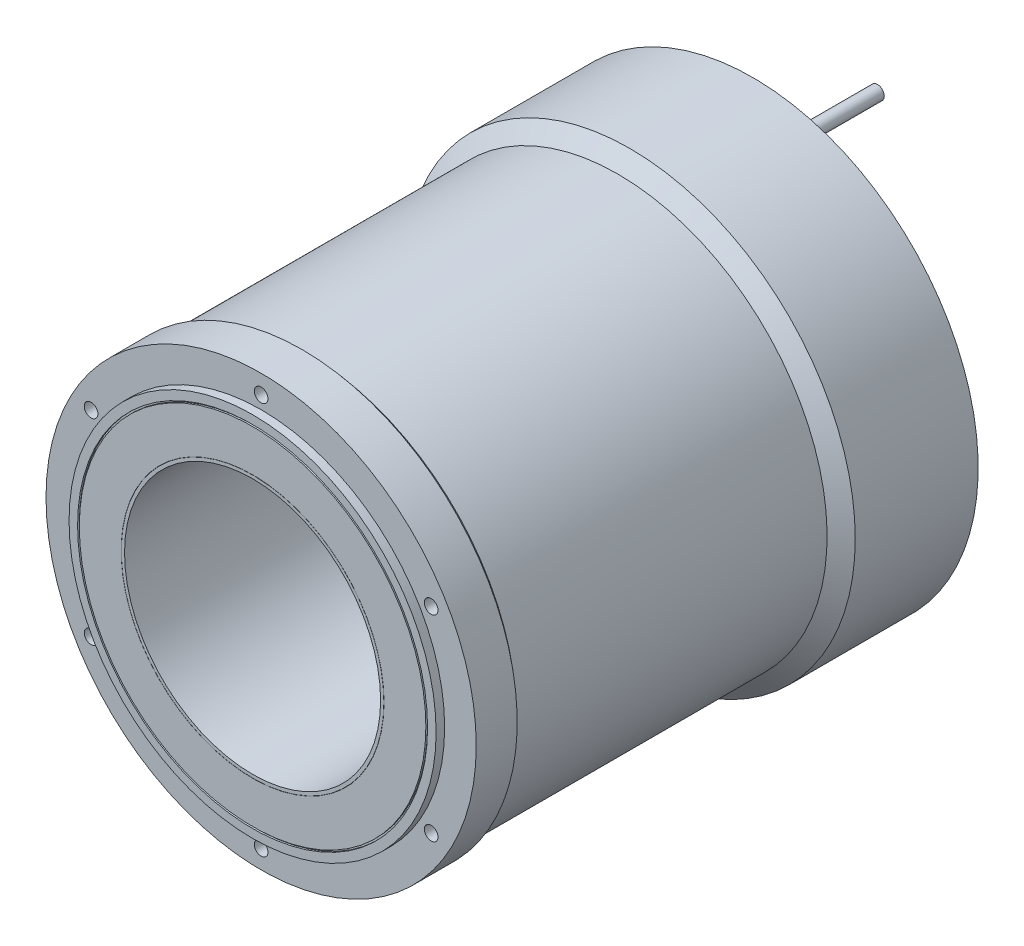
ISO-10303-21;
HEADER;
FILE_DESCRIPTION(('STEP AP214'),'2;1');
FILE_NAME('part.step','',(''),(''),'','','');
FILE_SCHEMA(('AUTOMOTIVE_DESIGN { 1 0 10303 214 1 1 1 1 }'));
ENDSEC;
DATA;
#1=APPLICATION_CONTEXT('core data for automotive mechanical design processes');
#2=APPLICATION_PROTOCOL_DEFINITION('international standard','automotive_design',2000,#1);
#3=PRODUCT_CONTEXT('',#1,'mechanical');
#4=PRODUCT('Part','Part','',(#3));
#5=PRODUCT_RELATED_PRODUCT_CATEGORY('part','',(#4));
#6=PRODUCT_DEFINITION_FORMATION('','',#4);
#7=PRODUCT_DEFINITION_CONTEXT('part definition',#1,'design');
#8=PRODUCT_DEFINITION('design','',#6,#7);
#9=PRODUCT_DEFINITION_SHAPE('','',#8);
#10=(LENGTH_UNIT() NAMED_UNIT(*) SI_UNIT(.MILLI.,.METRE.));
#11=(NAMED_UNIT(*) PLANE_ANGLE_UNIT() SI_UNIT($,.RADIAN.));
#12=(NAMED_UNIT(*) SI_UNIT($,.STERADIAN.) SOLID_ANGLE_UNIT());
#13=UNCERTAINTY_MEASURE_WITH_UNIT(LENGTH_MEASURE(1.E-05),#10,'distance_accuracy_value','');
#14=(GEOMETRIC_REPRESENTATION_CONTEXT(3) GLOBAL_UNCERTAINTY_ASSIGNED_CONTEXT((#13)) GLOBAL_UNIT_ASSIGNED_CONTEXT((#10,
#11,#12)) REPRESENTATION_CONTEXT('',''));
#15=CARTESIAN_POINT('',(0.,0.,0.));
#16=DIRECTION('',(0.,0.,1.));
#17=DIRECTION('',(1.,0.,0.));
#18=AXIS2_PLACEMENT_3D('',#15,#16,#17);
#19=CARTESIAN_POINT('',(-98.111250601,51.970329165,287.));
#20=DIRECTION('',(0.,0.,1.));
#21=DIRECTION('',(0.499999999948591,0.86602540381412,0.));
#22=AXIS2_PLACEMENT_3D('',#19,#20,#21);
#23=PLANE('',#22);
#24=CARTESIAN_POINT('',(-99.592921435,57.5,287.));
#25=DIRECTION('',(0.,0.,1.));
#26=DIRECTION('',(1.,0.,0.));
#27=AXIS2_PLACEMENT_3D('',#24,#25,#26);
#28=CIRCLE('',#27,4.);
#29=CARTESIAN_POINT('',(-95.592921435,57.5,287.));
#30=VERTEX_POINT('',#29);
#31=EDGE_CURVE('E20',#30,#30,#28,.F.);
#32=ORIENTED_EDGE('',*,*,#31,.F.);
#33=EDGE_LOOP('',(#32));
#34=FACE_BOUND('',#33,.T.);
#35=ADVANCED_FACE('F16',(#34),#23,.T.);
#36=CARTESIAN_POINT('',(-94.063250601,-58.981670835,287.));
#37=DIRECTION('',(0.,0.,1.));
#38=DIRECTION('',(-0.499999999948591,0.86602540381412,0.));
#39=AXIS2_PLACEMENT_3D('',#36,#37,#38);
#40=PLANE('',#39);
#41=CARTESIAN_POINT('',(-99.592921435,-57.5,287.));
#42=DIRECTION('',(0.,0.,1.));
#43=DIRECTION('',(1.,0.,0.));
#44=AXIS2_PLACEMENT_3D('',#41,#42,#43);
#45=CIRCLE('',#44,4.);
#46=CARTESIAN_POINT('',(-95.592921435,-57.5,287.));
#47=VERTEX_POINT('',#46);
#48=EDGE_CURVE('E492',#47,#47,#45,.F.);
#49=ORIENTED_EDGE('',*,*,#48,.F.);
#50=EDGE_LOOP('',(#49));
#51=FACE_BOUND('',#50,.T.);
#52=ADVANCED_FACE('F502',(#51),#40,.T.);
#53=CARTESIAN_POINT('',(4.048,-110.952,287.));
#54=DIRECTION('',(0.,0.,1.));
#55=DIRECTION('',(-1.,0.,0.));
#56=AXIS2_PLACEMENT_3D('',#53,#54,#55);
#57=PLANE('',#56);
#58=CARTESIAN_POINT('',(0.,-115.,287.));
#59=DIRECTION('',(0.,0.,1.));
#60=DIRECTION('',(1.,0.,0.));
#61=AXIS2_PLACEMENT_3D('',#58,#59,#60);
#62=CIRCLE('',#61,4.);
#63=CARTESIAN_POINT('',(4.,-115.,287.));
#64=VERTEX_POINT('',#63);
#65=EDGE_CURVE('E490',#64,#64,#62,.F.);
#66=ORIENTED_EDGE('',*,*,#65,.F.);
#67=EDGE_LOOP('',(#66));
#68=FACE_BOUND('',#67,.T.);
#69=ADVANCED_FACE('F508',(#68),#57,.T.);
#70=CARTESIAN_POINT('',(98.111250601,-51.970329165,287.));
#71=DIRECTION('',(0.,0.,1.));
#72=DIRECTION('',(-0.499999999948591,-0.86602540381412,0.));
#73=AXIS2_PLACEMENT_3D('',#70,#71,#72);
#74=PLANE('',#73);
#75=CARTESIAN_POINT('',(99.592921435,-57.5,287.));
#76=DIRECTION('',(0.,0.,1.));
#77=DIRECTION('',(1.,0.,0.));
#78=AXIS2_PLACEMENT_3D('',#75,#76,#77);
#79=CIRCLE('',#78,4.);
#80=CARTESIAN_POINT('',(103.592921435,-57.5,287.));
#81=VERTEX_POINT('',#80);
#82=EDGE_CURVE('E487',#81,#81,#79,.F.);
#83=ORIENTED_EDGE('',*,*,#82,.F.);
#84=EDGE_LOOP('',(#83));
#85=FACE_BOUND('',#84,.T.);
#86=ADVANCED_FACE('F2398',(#85),#74,.T.);
#87=CARTESIAN_POINT('',(94.063250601,58.981670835,287.));
#88=DIRECTION('',(0.,0.,1.));
#89=DIRECTION('',(0.499999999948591,-0.86602540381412,0.));
#90=AXIS2_PLACEMENT_3D('',#87,#88,#89);
#91=PLANE('',#90);
#92=CARTESIAN_POINT('',(99.592921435,57.5,287.));
#93=DIRECTION('',(0.,0.,1.));
#94=DIRECTION('',(1.,0.,0.));
#95=AXIS2_PLACEMENT_3D('',#92,#93,#94);
#96=CIRCLE('',#95,4.);
#97=CARTESIAN_POINT('',(103.592921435,57.5,287.));
#98=VERTEX_POINT('',#97);
#99=EDGE_CURVE('E484',#98,#98,#96,.F.);
#100=ORIENTED_EDGE('',*,*,#99,.F.);
#101=EDGE_LOOP('',(#100));
#102=FACE_BOUND('',#101,.T.);
#103=ADVANCED_FACE('F1381',(#102),#91,.T.);
#104=CARTESIAN_POINT('',(-4.048,110.952,287.));
#105=DIRECTION('',(0.,0.,1.));
#106=DIRECTION('',(1.,0.,0.));
#107=AXIS2_PLACEMENT_3D('',#104,#105,#106);
#108=PLANE('',#107);
#109=CARTESIAN_POINT('',(0.,115.,287.));
#110=DIRECTION('',(0.,0.,1.));
#111=DIRECTION('',(1.,0.,0.));
#112=AXIS2_PLACEMENT_3D('',#109,#110,#111);
#113=CIRCLE('',#112,4.);
#114=CARTESIAN_POINT('',(4.,115.,287.));
#115=VERTEX_POINT('',#114);
#116=EDGE_CURVE('E481',#115,#115,#113,.F.);
#117=ORIENTED_EDGE('',*,*,#116,.F.);
#118=EDGE_LOOP('',(#117));
#119=FACE_BOUND('',#118,.T.);
#120=ADVANCED_FACE('F1376',(#119),#108,.T.);
#121=CARTESIAN_POINT('',(-99.592921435,57.5,287.));
#122=DIRECTION('',(0.,0.,1.));
#123=DIRECTION('',(1.,0.,0.));
#124=AXIS2_PLACEMENT_3D('',#121,#122,#123);
#125=CYLINDRICAL_SURFACE('',#124,4.);
#126=CARTESIAN_POINT('',(-99.592921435,57.5,299.));
#127=DIRECTION('',(0.,0.,1.));
#128=DIRECTION('',(1.,0.,0.));
#129=AXIS2_PLACEMENT_3D('',#126,#127,#128);
#130=CIRCLE('',#129,4.);
#131=CARTESIAN_POINT('',(-95.592921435,57.5,299.));
#132=VERTEX_POINT('',#131);
#133=EDGE_CURVE('E475',#132,#132,#130,.F.);
#134=ORIENTED_EDGE('',*,*,#133,.F.);
#135=EDGE_LOOP('',(#134));
#136=FACE_BOUND('',#135,.T.);
#137=ORIENTED_EDGE('',*,*,#31,.T.);
#138=EDGE_LOOP('',(#137));
#139=FACE_BOUND('',#138,.T.);
#140=ADVANCED_FACE('F499',(#136,#139),#125,.F.);
#141=CARTESIAN_POINT('',(-99.592921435,-57.5,287.));
#142=DIRECTION('',(0.,0.,1.));
#143=DIRECTION('',(1.,0.,0.));
#144=AXIS2_PLACEMENT_3D('',#141,#142,#143);
#145=CYLINDRICAL_SURFACE('',#144,4.);
#146=CARTESIAN_POINT('',(-99.592921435,-57.5,299.));
#147=DIRECTION('',(0.,0.,1.));
#148=DIRECTION('',(1.,0.,0.));
#149=AXIS2_PLACEMENT_3D('',#146,#147,#148);
#150=CIRCLE('',#149,4.);
#151=CARTESIAN_POINT('',(-95.592921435,-57.5,299.));
#152=VERTEX_POINT('',#151);
#153=EDGE_CURVE('E472',#152,#152,#150,.F.);
#154=ORIENTED_EDGE('',*,*,#153,.F.);
#155=EDGE_LOOP('',(#154));
#156=FACE_BOUND('',#155,.T.);
#157=ORIENTED_EDGE('',*,*,#48,.T.);
#158=EDGE_LOOP('',(#157));
#159=FACE_BOUND('',#158,.T.);
#160=ADVANCED_FACE('F1371',(#156,#159),#145,.F.);
#161=CARTESIAN_POINT('',(0.,-115.,287.));
#162=DIRECTION('',(0.,0.,1.));
#163=DIRECTION('',(1.,0.,0.));
#164=AXIS2_PLACEMENT_3D('',#161,#162,#163);
#165=CYLINDRICAL_SURFACE('',#164,4.);
#166=CARTESIAN_POINT('',(0.,-115.,299.));
#167=DIRECTION('',(0.,0.,1.));
#168=DIRECTION('',(1.,0.,0.));
#169=AXIS2_PLACEMENT_3D('',#166,#167,#168);
#170=CIRCLE('',#169,4.);
#171=CARTESIAN_POINT('',(4.,-115.,299.));
#172=VERTEX_POINT('',#171);
#173=EDGE_CURVE('E469',#172,#172,#170,.F.);
#174=ORIENTED_EDGE('',*,*,#173,.F.);
#175=EDGE_LOOP('',(#174));
#176=FACE_BOUND('',#175,.T.);
#177=ORIENTED_EDGE('',*,*,#65,.T.);
#178=EDGE_LOOP('',(#177));
#179=FACE_BOUND('',#178,.T.);
#180=ADVANCED_FACE('F1367',(#176,#179),#165,.F.);
#181=CARTESIAN_POINT('',(99.592921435,-57.5,287.));
#182=DIRECTION('',(0.,0.,1.));
#183=DIRECTION('',(1.,0.,0.));
#184=AXIS2_PLACEMENT_3D('',#181,#182,#183);
#185=CYLINDRICAL_SURFACE('',#184,4.);
#186=CARTESIAN_POINT('',(99.592921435,-57.5,299.));
#187=DIRECTION('',(0.,0.,1.));
#188=DIRECTION('',(1.,0.,0.));
#189=AXIS2_PLACEMENT_3D('',#186,#187,#188);
#190=CIRCLE('',#189,4.);
#191=CARTESIAN_POINT('',(103.592921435,-57.5,299.));
#192=VERTEX_POINT('',#191);
#193=EDGE_CURVE('E466',#192,#192,#190,.F.);
#194=ORIENTED_EDGE('',*,*,#193,.F.);
#195=EDGE_LOOP('',(#194));
#196=FACE_BOUND('',#195,.T.);
#197=ORIENTED_EDGE('',*,*,#82,.T.);
#198=EDGE_LOOP('',(#197));
#199=FACE_BOUND('',#198,.T.);
#200=ADVANCED_FACE('F1363',(#196,#199),#185,.F.);
#201=CARTESIAN_POINT('',(99.592921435,57.5,287.));
#202=DIRECTION('',(0.,0.,1.));
#203=DIRECTION('',(1.,0.,0.));
#204=AXIS2_PLACEMENT_3D('',#201,#202,#203);
#205=CYLINDRICAL_SURFACE('',#204,4.);
#206=CARTESIAN_POINT('',(99.592921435,57.5,299.));
#207=DIRECTION('',(0.,0.,1.));
#208=DIRECTION('',(1.,0.,0.));
#209=AXIS2_PLACEMENT_3D('',#206,#207,#208);
#210=CIRCLE('',#209,4.);
#211=CARTESIAN_POINT('',(103.592921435,57.5,299.));
#212=VERTEX_POINT('',#211);
#213=EDGE_CURVE('E463',#212,#212,#210,.F.);
#214=ORIENTED_EDGE('',*,*,#213,.F.);
#215=EDGE_LOOP('',(#214));
#216=FACE_BOUND('',#215,.T.);
#217=ORIENTED_EDGE('',*,*,#99,.T.);
#218=EDGE_LOOP('',(#217));
#219=FACE_BOUND('',#218,.T.);
#220=ADVANCED_FACE('F1359',(#216,#219),#205,.F.);
#221=CARTESIAN_POINT('',(0.,115.,287.));
#222=DIRECTION('',(0.,0.,1.));
#223=DIRECTION('',(1.,0.,0.));
#224=AXIS2_PLACEMENT_3D('',#221,#222,#223);
#225=CYLINDRICAL_SURFACE('',#224,4.);
#226=CARTESIAN_POINT('',(0.,115.,299.));
#227=DIRECTION('',(0.,0.,1.));
#228=DIRECTION('',(1.,0.,0.));
#229=AXIS2_PLACEMENT_3D('',#226,#227,#228);
#230=CIRCLE('',#229,4.);
#231=CARTESIAN_POINT('',(4.,115.,299.));
#232=VERTEX_POINT('',#231);
#233=EDGE_CURVE('E460',#232,#232,#230,.F.);
#234=ORIENTED_EDGE('',*,*,#233,.F.);
#235=EDGE_LOOP('',(#234));
#236=FACE_BOUND('',#235,.T.);
#237=ORIENTED_EDGE('',*,*,#116,.T.);
#238=EDGE_LOOP('',(#237));
#239=FACE_BOUND('',#238,.T.);
#240=ADVANCED_FACE('F1355',(#236,#239),#225,.F.);
#241=CARTESIAN_POINT('',(0.,0.,304.));
#242=DIRECTION('',(0.,0.,-1.));
#243=DIRECTION('',(-1.,0.,0.));
#244=AXIS2_PLACEMENT_3D('',#241,#242,#243);
#245=CYLINDRICAL_SURFACE('',#244,107.5);
#246=CARTESIAN_POINT('',(0.,0.,304.));
#247=DIRECTION('',(0.,0.,-1.));
#248=DIRECTION('',(-1.,0.,0.));
#249=AXIS2_PLACEMENT_3D('',#246,#247,#248);
#250=CIRCLE('',#249,107.5);
#251=CARTESIAN_POINT('',(-107.5,0.,304.));
#252=VERTEX_POINT('',#251);
#253=EDGE_CURVE('E478',#252,#252,#250,.F.);
#254=ORIENTED_EDGE('',*,*,#253,.F.);
#255=EDGE_LOOP('',(#254));
#256=FACE_BOUND('',#255,.T.);
#257=CARTESIAN_POINT('',(0.,0.,299.));
#258=DIRECTION('',(0.,0.,-1.));
#259=DIRECTION('',(-1.,0.,0.));
#260=AXIS2_PLACEMENT_3D('',#257,#258,#259);
#261=CIRCLE('',#260,107.5);
#262=CARTESIAN_POINT('',(-107.5,0.,299.));
#263=VERTEX_POINT('',#262);
#264=EDGE_CURVE('E457',#263,#263,#261,.T.);
#265=ORIENTED_EDGE('',*,*,#264,.F.);
#266=EDGE_LOOP('',(#265));
#267=FACE_BOUND('',#266,.T.);
#268=ADVANCED_FACE('F1351',(#256,#267),#245,.T.);
#269=CARTESIAN_POINT('',(-108.79,108.79,304.));
#270=DIRECTION('',(0.,0.,1.));
#271=DIRECTION('',(0.,-1.,0.));
#272=AXIS2_PLACEMENT_3D('',#269,#270,#271);
#273=PLANE('',#272);
#274=CARTESIAN_POINT('',(0.,0.,304.));
#275=DIRECTION('',(0.,0.,1.));
#276=DIRECTION('',(1.,0.,0.));
#277=AXIS2_PLACEMENT_3D('',#274,#275,#276);
#278=CIRCLE('',#277,102.5);
#279=CARTESIAN_POINT('',(102.5,0.,304.));
#280=VERTEX_POINT('',#279);
#281=EDGE_CURVE('E454',#280,#280,#278,.T.);
#282=ORIENTED_EDGE('',*,*,#281,.F.);
#283=EDGE_LOOP('',(#282));
#284=FACE_BOUND('',#283,.T.);
#285=ORIENTED_EDGE('',*,*,#253,.T.);
#286=EDGE_LOOP('',(#285));
#287=FACE_BOUND('',#286,.T.);
#288=ADVANCED_FACE('F1354',(#284,#287),#273,.T.);
#289=CARTESIAN_POINT('',(-127.512,127.512,299.));
#290=DIRECTION('',(0.,0.,1.));
#291=DIRECTION('',(0.,-1.,0.));
#292=AXIS2_PLACEMENT_3D('',#289,#290,#291);
#293=PLANE('',#292);
#294=ORIENTED_EDGE('',*,*,#264,.T.);
#295=EDGE_LOOP('',(#294));
#296=FACE_BOUND('',#295,.T.);
#297=ORIENTED_EDGE('',*,*,#233,.T.);
#298=EDGE_LOOP('',(#297));
#299=FACE_BOUND('',#298,.T.);
#300=ORIENTED_EDGE('',*,*,#213,.T.);
#301=EDGE_LOOP('',(#300));
#302=FACE_BOUND('',#301,.T.);
#303=ORIENTED_EDGE('',*,*,#193,.T.);
#304=EDGE_LOOP('',(#303));
#305=FACE_BOUND('',#304,.T.);
#306=ORIENTED_EDGE('',*,*,#173,.T.);
#307=EDGE_LOOP('',(#306));
#308=FACE_BOUND('',#307,.T.);
#309=ORIENTED_EDGE('',*,*,#153,.T.);
#310=EDGE_LOOP('',(#309));
#311=FACE_BOUND('',#310,.T.);
#312=ORIENTED_EDGE('',*,*,#133,.T.);
#313=EDGE_LOOP('',(#312));
#314=FACE_BOUND('',#313,.T.);
#315=CARTESIAN_POINT('',(0.,0.,299.));
#316=DIRECTION('',(0.,0.,-1.));
#317=DIRECTION('',(-1.,0.,0.));
#318=AXIS2_PLACEMENT_3D('',#315,#316,#317);
#319=CIRCLE('',#318,126.);
#320=CARTESIAN_POINT('',(-126.,0.,299.));
#321=VERTEX_POINT('',#320);
#322=EDGE_CURVE('E451',#321,#321,#319,.F.);
#323=ORIENTED_EDGE('',*,*,#322,.T.);
#324=EDGE_LOOP('',(#323));
#325=FACE_BOUND('',#324,.T.);
#326=ADVANCED_FACE('F1349',(#296,#299,#302,#305,#308,#311,#314,#325),#293,.T.);
#327=CARTESIAN_POINT('',(0.,0.,303.));
#328=DIRECTION('',(0.,0.,1.));
#329=DIRECTION('',(1.,0.,0.));
#330=AXIS2_PLACEMENT_3D('',#327,#328,#329);
#331=CYLINDRICAL_SURFACE('',#330,102.5);
#332=ORIENTED_EDGE('',*,*,#281,.T.);
#333=EDGE_LOOP('',(#332));
#334=FACE_BOUND('',#333,.T.);
#335=CARTESIAN_POINT('',(0.,0.,303.));
#336=DIRECTION('',(0.,0.,1.));
#337=DIRECTION('',(1.,0.,0.));
#338=AXIS2_PLACEMENT_3D('',#335,#336,#337);
#339=CIRCLE('',#338,102.5);
#340=CARTESIAN_POINT('',(102.5,0.,303.));
#341=VERTEX_POINT('',#340);
#342=EDGE_CURVE('E448',#341,#341,#339,.T.);
#343=ORIENTED_EDGE('',*,*,#342,.F.);
#344=EDGE_LOOP('',(#343));
#345=FACE_BOUND('',#344,.T.);
#346=ADVANCED_FACE('F1345',(#334,#345),#331,.F.);
#347=CARTESIAN_POINT('',(0.,0.,299.));
#348=DIRECTION('',(0.,0.,-1.));
#349=DIRECTION('',(-1.,0.,0.));
#350=AXIS2_PLACEMENT_3D('',#347,#348,#349);
#351=CYLINDRICAL_SURFACE('',#350,126.);
#352=ORIENTED_EDGE('',*,*,#322,.F.);
#353=EDGE_LOOP('',(#352));
#354=FACE_BOUND('',#353,.T.);
#355=CARTESIAN_POINT('',(0.,0.,275.));
#356=DIRECTION('',(0.,0.,1.));
#357=DIRECTION('',(0.,-1.,0.));
#358=AXIS2_PLACEMENT_3D('',#355,#356,#357);
#359=CIRCLE('',#358,126.);
#360=CARTESIAN_POINT('',(0.,-126.,275.));
#361=VERTEX_POINT('',#360);
#362=EDGE_CURVE('E447',#361,#361,#359,.T.);
#363=ORIENTED_EDGE('',*,*,#362,.T.);
#364=EDGE_LOOP('',(#363));
#365=FACE_BOUND('',#364,.T.);
#366=ADVANCED_FACE('F1342',(#354,#365),#351,.T.);
#367=CARTESIAN_POINT('',(-103.73,-103.73,303.));
#368=DIRECTION('',(0.,0.,1.));
#369=DIRECTION('',(1.,0.,0.));
#370=AXIS2_PLACEMENT_3D('',#367,#368,#369);
#371=PLANE('',#370);
#372=CARTESIAN_POINT('',(0.,0.,303.));
#373=DIRECTION('',(0.,0.,1.));
#374=DIRECTION('',(1.,0.,0.));
#375=AXIS2_PLACEMENT_3D('',#372,#373,#374);
#376=CIRCLE('',#375,101.5);
#377=CARTESIAN_POINT('',(101.5,0.,303.));
#378=VERTEX_POINT('',#377);
#379=EDGE_CURVE('E444',#378,#378,#376,.F.);
#380=ORIENTED_EDGE('',*,*,#379,.T.);
#381=EDGE_LOOP('',(#380));
#382=FACE_BOUND('',#381,.T.);
#383=ORIENTED_EDGE('',*,*,#342,.T.);
#384=EDGE_LOOP('',(#383));
#385=FACE_BOUND('',#384,.T.);
#386=ADVANCED_FACE('F1337',(#382,#385),#371,.T.);
#387=CARTESIAN_POINT('',(0.,0.,272.));
#388=DIRECTION('',(0.,0.,1.));
#389=DIRECTION('',(1.,0.,0.));
#390=AXIS2_PLACEMENT_3D('',#387,#388,#389);
#391=CONICAL_SURFACE('',#390,122.5,0.862170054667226);
#392=CARTESIAN_POINT('',(0.,0.,272.));
#393=DIRECTION('',(0.,0.,-1.));
#394=DIRECTION('',(0.,1.,0.));
#395=AXIS2_PLACEMENT_3D('',#392,#393,#394);
#396=CIRCLE('',#395,122.5);
#397=CARTESIAN_POINT('',(0.,122.5,272.));
#398=VERTEX_POINT('',#397);
#399=EDGE_CURVE('E443',#398,#398,#396,.F.);
#400=ORIENTED_EDGE('',*,*,#399,.T.);
#401=EDGE_LOOP('',(#400));
#402=FACE_BOUND('',#401,.T.);
#403=ORIENTED_EDGE('',*,*,#362,.F.);
#404=EDGE_LOOP('',(#403));
#405=FACE_BOUND('',#404,.T.);
#406=ADVANCED_FACE('F1331',(#402,#405),#391,.T.);
#407=CARTESIAN_POINT('',(0.,0.,303.));
#408=DIRECTION('',(0.,0.,1.));
#409=DIRECTION('',(1.,0.,0.));
#410=AXIS2_PLACEMENT_3D('',#407,#408,#409);
#411=CYLINDRICAL_SURFACE('',#410,101.5);
#412=ORIENTED_EDGE('',*,*,#379,.F.);
#413=EDGE_LOOP('',(#412));
#414=FACE_BOUND('',#413,.T.);
#415=CARTESIAN_POINT('',(0.,0.,304.));
#416=DIRECTION('',(0.,0.,1.));
#417=DIRECTION('',(1.,0.,0.));
#418=AXIS2_PLACEMENT_3D('',#415,#416,#417);
#419=CIRCLE('',#418,101.5);
#420=CARTESIAN_POINT('',(101.5,0.,304.));
#421=VERTEX_POINT('',#420);
#422=EDGE_CURVE('E420',#421,#421,#419,.T.);
#423=ORIENTED_EDGE('',*,*,#422,.F.);
#424=EDGE_LOOP('',(#423));
#425=FACE_BOUND('',#424,.T.);
#426=ADVANCED_FACE('F1329',(#414,#425),#411,.T.);
#427=CARTESIAN_POINT('',(0.,0.,43.));
#428=DIRECTION('',(0.,0.,-1.));
#429=DIRECTION('',(-1.,0.,0.));
#430=AXIS2_PLACEMENT_3D('',#427,#428,#429);
#431=CYLINDRICAL_SURFACE('',#430,132.1);
#432=DIRECTION('',(0.,0.,1.));
#433=VECTOR('',#432,1.);
#434=CARTESIAN_POINT('',(-127.09227207,36.027272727,33.));
#435=LINE('',#434,#433);
#436=CARTESIAN_POINT('',(-127.092272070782,36.0272727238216,23.));
#437=VERTEX_POINT('',#436);
#438=CARTESIAN_POINT('',(-127.09227206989,36.0272727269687,43.));
#439=VERTEX_POINT('',#438);
#440=EDGE_CURVE('E434',#437,#439,#435,.T.);
#441=ORIENTED_EDGE('',*,*,#440,.F.);
#442=CARTESIAN_POINT('',(0.,0.,23.));
#443=DIRECTION('',(0.,0.,-1.));
#444=DIRECTION('',(-1.,0.,0.));
#445=AXIS2_PLACEMENT_3D('',#442,#443,#444);
#446=CIRCLE('',#445,132.1);
#447=CARTESIAN_POINT('',(-132.076305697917,2.50189393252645,23.));
#448=VERTEX_POINT('',#447);
#449=EDGE_CURVE('E416',#448,#437,#446,.T.);
#450=ORIENTED_EDGE('',*,*,#449,.F.);
#451=DIRECTION('',(0.,0.,1.));
#452=VECTOR('',#451,1.);
#453=CARTESIAN_POINT('',(-132.076305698,2.50189394,33.));
#454=LINE('',#453,#452);
#455=CARTESIAN_POINT('',(-132.076305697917,2.50189393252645,43.));
#456=VERTEX_POINT('',#455);
#457=EDGE_CURVE('E409',#448,#456,#454,.T.);
#458=ORIENTED_EDGE('',*,*,#457,.T.);
#459=CARTESIAN_POINT('',(0.,0.,43.));
#460=DIRECTION('',(0.,0.,-1.));
#461=DIRECTION('',(-1.,0.,0.));
#462=AXIS2_PLACEMENT_3D('',#459,#460,#461);
#463=CIRCLE('',#462,132.1);
#464=EDGE_CURVE('E413',#439,#456,#463,.F.);
#465=ORIENTED_EDGE('',*,*,#464,.F.);
#466=EDGE_LOOP('',(#441,#450,#458,#465));
#467=FACE_BOUND('',#466,.T.);
#468=ADVANCED_FACE('F411',(#467),#431,.T.);
#469=CARTESIAN_POINT('',(0.,0.,40.303698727));
#470=DIRECTION('',(0.,0.,-1.));
#471=DIRECTION('',(-1.,0.,0.));
#472=AXIS2_PLACEMENT_3D('',#469,#470,#471);
#473=CYLINDRICAL_SURFACE('',#472,132.1);
#474=CARTESIAN_POINT('',(-129.451425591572,-26.3199242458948,23.));
#475=CARTESIAN_POINT('',(-129.444691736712,-26.3530441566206,23.0000018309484));
#476=CARTESIAN_POINT('',(-129.437949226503,-26.3861409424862,23.0013710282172));
#477=CARTESIAN_POINT('',(-129.424470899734,-26.4521732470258,23.0068407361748));
#478=CARTESIAN_POINT('',(-129.417735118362,-26.4851083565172,23.0109462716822));
#479=CARTESIAN_POINT('',(-129.397455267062,-26.5840764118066,23.0274819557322));
#480=CARTESIAN_POINT('',(-129.383997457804,-26.6494913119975,23.0441316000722));
#481=CARTESIAN_POINT('',(-129.364307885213,-26.744848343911,23.0771318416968));
#482=CARTESIAN_POINT('',(-129.357823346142,-26.7761933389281,23.0894805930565));
#483=CARTESIAN_POINT('',(-129.345055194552,-26.8378032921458,23.1167926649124));
#484=CARTESIAN_POINT('',(-129.338771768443,-26.8680672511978,23.1317583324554));
#485=CARTESIAN_POINT('',(-129.320057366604,-26.9580517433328,23.1811135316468));
#486=CARTESIAN_POINT('',(-129.308021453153,-27.0157105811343,23.2195299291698));
#487=CARTESIAN_POINT('',(-129.285408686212,-27.1237194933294,23.3058270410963));
#488=CARTESIAN_POINT('',(-129.274831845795,-27.1740695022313,23.3537078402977));
#489=CARTESIAN_POINT('',(-129.255641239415,-27.2652038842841,23.456803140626));
#490=CARTESIAN_POINT('',(-129.246997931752,-27.3061325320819,23.5118834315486));
#491=CARTESIAN_POINT('',(-129.235590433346,-27.3600530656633,23.5992111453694));
#492=CARTESIAN_POINT('',(-129.232047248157,-27.3767824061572,23.6291079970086));
#493=CARTESIAN_POINT('',(-129.225499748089,-27.4076715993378,23.6903025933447));
#494=CARTESIAN_POINT('',(-129.222496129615,-27.4218281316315,23.7216020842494));
#495=CARTESIAN_POINT('',(-129.214480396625,-27.4595834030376,23.8157364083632));
#496=CARTESIAN_POINT('',(-129.210275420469,-27.4793549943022,23.8802484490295));
#497=CARTESIAN_POINT('',(-129.205723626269,-27.5007459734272,23.9787786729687));
#498=CARTESIAN_POINT('',(-129.204498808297,-27.5064993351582,24.0119320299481));
#499=CARTESIAN_POINT('',(-129.202650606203,-27.5151794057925,24.0786202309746));
#500=CARTESIAN_POINT('',(-129.202026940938,-27.5181074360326,24.1121548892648));
#501=CARTESIAN_POINT('',(-129.201386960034,-27.5211120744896,24.1788149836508));
#502=CARTESIAN_POINT('',(-129.201361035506,-27.5212337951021,24.2119383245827));
#503=CARTESIAN_POINT('',(-129.201891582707,-27.5187429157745,24.278038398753));
#504=CARTESIAN_POINT('',(-129.202447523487,-27.5161328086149,24.3110152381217));
#505=CARTESIAN_POINT('',(-129.204985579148,-27.5042138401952,24.409452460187));
#506=CARTESIAN_POINT('',(-129.207837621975,-27.4908177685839,24.4744519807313));
#507=CARTESIAN_POINT('',(-129.215000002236,-27.457130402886,24.589199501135));
#508=CARTESIAN_POINT('',(-129.218933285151,-27.4386187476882,24.6395098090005));
#509=CARTESIAN_POINT('',(-129.228154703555,-27.3951546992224,24.7370719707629));
#510=CARTESIAN_POINT('',(-129.23344142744,-27.3702090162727,24.7843269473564));
#511=CARTESIAN_POINT('',(-129.239361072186,-27.3422301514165,24.8296604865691));
#512=B_SPLINE_CURVE_WITH_KNOTS('',3,(#474,#475,#476,#477,#478,#479,#480,#481,#482,#483,#484,
#485,#486,#487,#488,#489,#490,#491,#492,#493,#494,#495,#496,#497,#498,#499,#500,#501,#502,#503,
#504,#505,#506,#507,#508,#509,#510,#511),.UNSPECIFIED.,.F.,.F.,(4,2,2,2,2,2,2,2,2,2,2,2,2,2,2,2,
2,2,4),(0.,0.101323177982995,0.202832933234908,0.408215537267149,0.511045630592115,
0.613968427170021,0.823817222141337,1.03366789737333,1.2400520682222,1.3432637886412,
1.44660777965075,1.6482526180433,1.74917147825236,1.85004311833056,1.9492920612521,
2.04845051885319,2.24667125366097,2.40746273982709,2.56808720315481),.UNSPECIFIED.);
#513=CARTESIAN_POINT('',(-129.451425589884,-26.319924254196,23.));
#514=VERTEX_POINT('',#513);
#515=CARTESIAN_POINT('',(-129.239361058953,-27.3422302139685,24.8296603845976));
#516=VERTEX_POINT('',#515);
#517=EDGE_CURVE('E849',#514,#516,#512,.T.);
#518=ORIENTED_EDGE('',*,*,#517,.T.);
#519=CARTESIAN_POINT('',(-130.674209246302,-19.3561627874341,37.7760698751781));
#520=CARTESIAN_POINT('',(-130.669039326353,-19.3910651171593,37.7194888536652));
#521=CARTESIAN_POINT('',(-130.663855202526,-19.4259668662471,37.6629087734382));
#522=CARTESIAN_POINT('',(-130.637863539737,-19.600472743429,37.3800130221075));
#523=CARTESIAN_POINT('',(-130.616842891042,-19.7400681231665,37.1537115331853));
#524=CARTESIAN_POINT('',(-130.510601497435,-20.438000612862,36.0222760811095));
#525=CARTESIAN_POINT('',(-130.421967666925,-20.9961952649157,35.1173730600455));
#526=CARTESIAN_POINT('',(-130.169971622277,-22.5199164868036,32.6472312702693));
#527=CARTESIAN_POINT('',(-129.999320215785,-23.4851130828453,31.0825274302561));
#528=CARTESIAN_POINT('',(-129.635939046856,-25.4144998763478,27.9547512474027));
#529=CARTESIAN_POINT('',(-129.443206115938,-26.3786899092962,26.3916791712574));
#530=CARTESIAN_POINT('',(-129.239361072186,-27.3422301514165,24.8296604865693));
#531=B_SPLINE_CURVE_WITH_KNOTS('',3,(#519,#520,#521,#522,#523,#524,#525,#526,#527,#528,#529,
#530),.UNSPECIFIED.,.F.,.F.,(4,2,2,2,2,4),(0.,0.200042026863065,1.00021040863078,
4.20090157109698,9.73982612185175,15.2795464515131),.UNSPECIFIED.);
#532=CARTESIAN_POINT('',(-130.674209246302,-19.356162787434,37.7760698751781));
#533=VERTEX_POINT('',#532);
#534=EDGE_CURVE('E843',#533,#516,#531,.T.);
#535=ORIENTED_EDGE('',*,*,#534,.F.);
#536=CARTESIAN_POINT('',(-130.674209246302,-19.356162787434,37.7760698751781));
#537=CARTESIAN_POINT('',(-130.679429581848,-19.3209196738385,37.8332156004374));
#538=CARTESIAN_POINT('',(-130.684801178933,-19.2845577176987,37.8896698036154));
#539=CARTESIAN_POINT('',(-130.70138833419,-19.1719293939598,38.0571994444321));
#540=CARTESIAN_POINT('',(-130.713041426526,-19.0923539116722,38.1660279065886));
#541=CARTESIAN_POINT('',(-130.737408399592,-18.9247775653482,38.3769456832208));
#542=CARTESIAN_POINT('',(-130.750122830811,-18.8367723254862,38.4790314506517));
#543=CARTESIAN_POINT('',(-130.776458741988,-18.6530547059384,38.6758504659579));
#544=CARTESIAN_POINT('',(-130.790080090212,-18.5573434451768,38.7705847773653));
#545=CARTESIAN_POINT('',(-130.818082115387,-18.3589059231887,38.9521989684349));
#546=CARTESIAN_POINT('',(-130.832462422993,-18.2561830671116,39.0390826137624));
#547=CARTESIAN_POINT('',(-130.85449205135,-18.0973687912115,39.162901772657));
#548=CARTESIAN_POINT('',(-130.861901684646,-18.0437164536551,39.2030416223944));
#549=CARTESIAN_POINT('',(-130.876862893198,-17.9348760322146,39.2811555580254));
#550=CARTESIAN_POINT('',(-130.884414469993,-17.8796879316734,39.3191296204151));
#551=CARTESIAN_POINT('',(-130.907297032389,-17.7116451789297,39.4299240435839));
#552=CARTESIAN_POINT('',(-130.922817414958,-17.5965887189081,39.4994010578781));
#553=CARTESIAN_POINT('',(-130.954209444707,-17.361426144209,39.6292184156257));
#554=CARTESIAN_POINT('',(-130.970081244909,-17.2413178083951,39.6895546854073));
#555=CARTESIAN_POINT('',(-131.002052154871,-16.9966920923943,39.8004941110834));
#556=CARTESIAN_POINT('',(-131.018151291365,-16.8721741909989,39.8510961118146));
#557=CARTESIAN_POINT('',(-131.050432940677,-16.6195734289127,39.9422036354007));
#558=CARTESIAN_POINT('',(-131.066615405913,-16.4914924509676,39.9827143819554));
#559=CARTESIAN_POINT('',(-131.090826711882,-16.2975271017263,40.0358729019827));
#560=CARTESIAN_POINT('',(-131.098875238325,-16.2326591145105,40.0523063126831));
#561=CARTESIAN_POINT('',(-131.114949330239,-16.1023096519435,40.0826481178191));
#562=CARTESIAN_POINT('',(-131.12297488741,-16.0368279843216,40.0965556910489));
#563=CARTESIAN_POINT('',(-131.147225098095,-15.8377201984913,40.1347477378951));
#564=CARTESIAN_POINT('',(-131.163391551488,-15.7032863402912,40.1549900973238));
#565=CARTESIAN_POINT('',(-131.195452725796,-15.4331365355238,40.184558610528));
#566=CARTESIAN_POINT('',(-131.211347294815,-15.2974199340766,40.1938788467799));
#567=CARTESIAN_POINT('',(-131.242779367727,-15.0253668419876,40.2018017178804));
#568=CARTESIAN_POINT('',(-131.258316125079,-14.8890296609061,40.2003836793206));
#569=CARTESIAN_POINT('',(-131.288904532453,-14.6168498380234,40.1866645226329));
#570=CARTESIAN_POINT('',(-131.303956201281,-14.4810071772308,40.1743638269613));
#571=CARTESIAN_POINT('',(-131.333481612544,-14.2107383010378,40.1388374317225));
#572=CARTESIAN_POINT('',(-131.347955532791,-14.0763116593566,40.115615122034));
#573=CARTESIAN_POINT('',(-131.376259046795,-13.8096538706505,40.0585104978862));
#574=CARTESIAN_POINT('',(-131.390088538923,-13.6774230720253,40.0246265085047));
#575=CARTESIAN_POINT('',(-131.417020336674,-13.4161836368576,39.9465013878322));
#576=CARTESIAN_POINT('',(-131.430123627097,-13.2871707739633,39.9022747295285));
#577=CARTESIAN_POINT('',(-131.455559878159,-13.0331143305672,39.8035052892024));
#578=CARTESIAN_POINT('',(-131.467893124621,-12.9080692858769,39.7489663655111));
#579=CARTESIAN_POINT('',(-131.486033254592,-12.7215244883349,39.6585338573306));
#580=CARTESIAN_POINT('',(-131.492135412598,-12.6582887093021,39.6262296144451));
#581=CARTESIAN_POINT('',(-131.504117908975,-12.5331927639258,39.5590425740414));
#582=CARTESIAN_POINT('',(-131.509998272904,-12.471332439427,39.5241600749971));
#583=CARTESIAN_POINT('',(-131.527289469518,-12.2880898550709,39.4157546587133));
#584=CARTESIAN_POINT('',(-131.538364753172,-12.1688981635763,39.3384021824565));
#585=CARTESIAN_POINT('',(-131.55425464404,-11.995476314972,39.2151917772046));
#586=CARTESIAN_POINT('',(-131.55942404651,-11.9386390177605,39.1729886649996));
#587=CARTESIAN_POINT('',(-131.569529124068,-11.8267560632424,39.0862212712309));
#588=CARTESIAN_POINT('',(-131.574464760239,-11.7717107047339,39.0416565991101));
#589=CARTESIAN_POINT('',(-131.588325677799,-11.6160638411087,38.910179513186));
#590=CARTESIAN_POINT('',(-131.59695438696,-11.517839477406,38.8203991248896));
#591=CARTESIAN_POINT('',(-131.613383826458,-11.3285575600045,38.6335007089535));
#592=CARTESIAN_POINT('',(-131.62118455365,-11.2375000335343,38.536382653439));
#593=CARTESIAN_POINT('',(-131.63233308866,-11.1058942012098,38.3843978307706));
#594=CARTESIAN_POINT('',(-131.635994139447,-11.0624075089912,38.3320751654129));
#595=CARTESIAN_POINT('',(-131.643094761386,-10.9775867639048,38.2257183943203));
#596=CARTESIAN_POINT('',(-131.646534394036,-10.9362521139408,38.1716847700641));
#597=CARTESIAN_POINT('',(-131.653215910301,-10.8555236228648,38.0616280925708));
#598=CARTESIAN_POINT('',(-131.656456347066,-10.8161443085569,38.0055943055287));
#599=CARTESIAN_POINT('',(-131.662718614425,-10.7396460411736,37.8919692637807));
#600=CARTESIAN_POINT('',(-131.665740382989,-10.7025277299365,37.8343775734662));
#601=CARTESIAN_POINT('',(-131.668653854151,-10.6665642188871,37.7760694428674));
#602=B_SPLINE_CURVE_WITH_KNOTS('',3,(#536,#537,#538,#539,#540,#541,#542,#543,#544,#545,#546,
#547,#548,#549,#550,#551,#552,#553,#554,#555,#556,#557,#558,#559,#560,#561,#562,#563,#564,#565,
#566,#567,#568,#569,#570,#571,#572,#573,#574,#575,#576,#577,#578,#579,#580,#581,#582,#583,#584,
#585,#586,#587,#588,#589,#590,#591,#592,#593,#594,#595,#596,#597,#598,#599,#600,#601),
.UNSPECIFIED.,.F.,.F.,(4,2,2,2,2,2,2,2,2,2,2,2,2,2,2,2,2,2,2,2,2,2,2,2,2,2,2,2,2,2,2,2,4),(0.,
0.202039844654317,0.607544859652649,1.01326152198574,1.41891937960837,1.82438161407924,
2.0265784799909,2.22877753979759,2.63423112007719,3.03986486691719,3.44554672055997,
3.85101813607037,4.0531742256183,4.25539592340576,4.66563762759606,5.07610149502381,
5.48735579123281,5.89859412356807,6.30970489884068,6.7208802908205,7.13148371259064,
7.54193381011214,7.75569291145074,7.96942730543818,8.39640286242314,8.60929640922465,
8.82222527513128,9.22186310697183,9.62150245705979,9.82585455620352,10.030149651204,
10.2357862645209,10.4414809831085),.UNSPECIFIED.);
#603=CARTESIAN_POINT('',(-131.668653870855,-10.6665640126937,37.7760691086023));
#604=VERTEX_POINT('',#603);
#605=EDGE_CURVE('E874',#533,#604,#602,.T.);
#606=ORIENTED_EDGE('',*,*,#605,.T.);
#607=CARTESIAN_POINT('',(-132.072801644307,-2.68049730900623,24.829660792));
#608=CARTESIAN_POINT('',(-132.072091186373,-2.71550280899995,24.8864090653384));
#609=CARTESIAN_POINT('',(-132.071366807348,-2.75050823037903,24.9431572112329));
#610=CARTESIAN_POINT('',(-132.067675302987,-2.92553497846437,25.226897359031));
#611=CARTESIAN_POINT('',(-132.06449935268,-3.06555509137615,25.4538873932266));
#612=CARTESIAN_POINT('',(-132.047505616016,-3.76565137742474,26.5888306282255));
#613=CARTESIAN_POINT('',(-132.030346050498,-4.32570591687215,27.4967487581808));
#614=CARTESIAN_POINT('',(-131.973952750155,-5.84943350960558,29.9669008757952));
#615=CARTESIAN_POINT('',(-131.927723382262,-6.81303717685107,31.5290223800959));
#616=CARTESIAN_POINT('',(-131.814086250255,-8.74002849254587,34.652915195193));
#617=CARTESIAN_POINT('',(-131.746675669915,-9.70341609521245,36.2146864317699));
#618=CARTESIAN_POINT('',(-131.668653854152,-10.6665642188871,37.7760694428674));
#619=B_SPLINE_CURVE_WITH_KNOTS('',3,(#607,#608,#609,#610,#611,#612,#613,#614,#615,#616,#617,
#618),.UNSPECIFIED.,.F.,.F.,(4,2,2,2,2,4),(0.,0.200040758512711,1.0002040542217,
4.20087399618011,9.70874375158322,15.2173461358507),.UNSPECIFIED.);
#620=CARTESIAN_POINT('',(-132.072801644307,-2.68049730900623,24.829660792));
#621=VERTEX_POINT('',#620);
#622=EDGE_CURVE('E823',#621,#604,#619,.T.);
#623=ORIENTED_EDGE('',*,*,#622,.F.);
#624=CARTESIAN_POINT('',(-132.072801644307,-2.68049730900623,24.829660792));
#625=CARTESIAN_POINT('',(-132.073161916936,-2.66274375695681,24.8009060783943));
#626=CARTESIAN_POINT('',(-132.073494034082,-2.64620545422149,24.7713981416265));
#627=CARTESIAN_POINT('',(-132.07410258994,-2.61565712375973,24.711034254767));
#628=CARTESIAN_POINT('',(-132.074378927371,-2.60165169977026,24.6801759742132));
#629=CARTESIAN_POINT('',(-132.074875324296,-2.57632843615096,24.6173667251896));
#630=CARTESIAN_POINT('',(-132.075095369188,-2.56501129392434,24.5854154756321));
#631=CARTESIAN_POINT('',(-132.075481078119,-2.54507310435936,24.5206790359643));
#632=CARTESIAN_POINT('',(-132.075646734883,-2.5364524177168,24.4878937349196));
#633=CARTESIAN_POINT('',(-132.075923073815,-2.52202242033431,24.421680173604));
#634=CARTESIAN_POINT('',(-132.076033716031,-2.51621515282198,24.3882514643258));
#635=CARTESIAN_POINT('',(-132.07619970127,-2.50748673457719,24.3210156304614));
#636=CARTESIAN_POINT('',(-132.076255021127,-2.50456679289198,24.2872083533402));
#637=CARTESIAN_POINT('',(-132.076339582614,-2.50010902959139,24.1860259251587));
#638=CARTESIAN_POINT('',(-132.076289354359,-2.50277141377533,24.118414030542));
#639=CARTESIAN_POINT('',(-132.075972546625,-2.51943255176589,23.984630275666));
#640=CARTESIAN_POINT('',(-132.07570595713,-2.53343183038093,23.9184584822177));
#641=CARTESIAN_POINT('',(-132.0749533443,-2.57236787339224,23.7893231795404));
#642=CARTESIAN_POINT('',(-132.074467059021,-2.59731769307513,23.7263636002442));
#643=CARTESIAN_POINT('',(-132.073271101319,-2.6574348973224,23.6055244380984));
#644=CARTESIAN_POINT('',(-132.072561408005,-2.69260323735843,23.547645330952));
#645=CARTESIAN_POINT('',(-132.070916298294,-2.77211864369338,23.4386813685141));
#646=CARTESIAN_POINT('',(-132.069981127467,-2.81645571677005,23.3875892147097));
#647=CARTESIAN_POINT('',(-132.067886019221,-2.91304157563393,23.2935406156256));
#648=CARTESIAN_POINT('',(-132.066726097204,-2.96528981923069,23.2505836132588));
#649=CARTESIAN_POINT('',(-132.064184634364,-3.07639836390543,23.173952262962));
#650=CARTESIAN_POINT('',(-132.062802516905,-3.13527574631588,23.1403027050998));
#651=CARTESIAN_POINT('',(-132.059835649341,-3.25784619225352,23.0833835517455));
#652=CARTESIAN_POINT('',(-132.058250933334,-3.32153844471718,23.0601122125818));
#653=CARTESIAN_POINT('',(-132.055259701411,-3.43817243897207,23.0283137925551));
#654=CARTESIAN_POINT('',(-132.053885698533,-3.49056134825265,23.0177161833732));
#655=CARTESIAN_POINT('',(-132.051050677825,-3.5962278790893,23.0035550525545));
#656=CARTESIAN_POINT('',(-132.049589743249,-3.64950461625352,22.9999849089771));
#657=CARTESIAN_POINT('',(-132.048094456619,-3.70280304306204,23.));
#658=B_SPLINE_CURVE_WITH_KNOTS('',3,(#624,#625,#626,#627,#628,#629,#630,#631,#632,#633,#634,
#635,#636,#637,#638,#639,#640,#641,#642,#643,#644,#645,#646,#647,#648,#649,#650,#651,#652,#653,
#654,#655,#656,#657),.UNSPECIFIED.,.F.,.F.,(4,2,2,2,2,2,2,2,2,2,2,2,2,2,2,2,4),(0.,
0.101361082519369,0.202904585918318,0.304474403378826,0.406057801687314,0.507714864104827,
0.609414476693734,0.811371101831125,1.01333707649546,1.21554449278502,1.4177708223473,
1.61977789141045,1.8217711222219,2.02429728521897,2.22678940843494,2.38673780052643,
2.54653540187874),.UNSPECIFIED.);
#659=CARTESIAN_POINT('',(-132.048094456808,-3.70280303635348,23.));
#660=VERTEX_POINT('',#659);
#661=EDGE_CURVE('E815',#621,#660,#658,.T.);
#662=ORIENTED_EDGE('',*,*,#661,.T.);
#663=CARTESIAN_POINT('',(0.,0.,23.));
#664=DIRECTION('',(0.,0.,-1.));
#665=DIRECTION('',(-1.,0.,0.));
#666=AXIS2_PLACEMENT_3D('',#663,#664,#665);
#667=CIRCLE('',#666,132.1);
#668=EDGE_CURVE('E855',#514,#660,#667,.T.);
#669=ORIENTED_EDGE('',*,*,#668,.F.);
#670=EDGE_LOOP('',(#518,#535,#606,#623,#662,#669));
#671=FACE_BOUND('',#670,.T.);
#672=ADVANCED_FACE('F830',(#671),#473,.T.);
#673=CARTESIAN_POINT('',(0.,0.,272.));
#674=DIRECTION('',(0.,0.,-1.));
#675=DIRECTION('',(-1.,0.,0.));
#676=AXIS2_PLACEMENT_3D('',#673,#674,#675);
#677=CYLINDRICAL_SURFACE('',#676,122.5);
#678=ORIENTED_EDGE('',*,*,#399,.F.);
#679=EDGE_LOOP('',(#678));
#680=FACE_BOUND('',#679,.T.);
#681=CARTESIAN_POINT('',(0.,0.,90.));
#682=DIRECTION('',(0.,0.,-1.));
#683=DIRECTION('',(0.,1.,0.));
#684=AXIS2_PLACEMENT_3D('',#681,#682,#683);
#685=CIRCLE('',#684,122.5);
#686=CARTESIAN_POINT('',(0.,122.5,90.));
#687=VERTEX_POINT('',#686);
#688=EDGE_CURVE('E882',#687,#687,#685,.F.);
#689=ORIENTED_EDGE('',*,*,#688,.T.);
#690=EDGE_LOOP('',(#689));
#691=FACE_BOUND('',#690,.T.);
#692=ADVANCED_FACE('F835',(#680,#691),#677,.T.);
#693=CARTESIAN_POINT('',(-102.718,102.718,304.));
#694=DIRECTION('',(0.,0.,1.));
#695=DIRECTION('',(0.,-1.,0.));
#696=AXIS2_PLACEMENT_3D('',#693,#694,#695);
#697=PLANE('',#696);
#698=CARTESIAN_POINT('',(0.,0.,304.));
#699=DIRECTION('',(0.,0.,1.));
#700=DIRECTION('',(1.,0.,0.));
#701=AXIS2_PLACEMENT_3D('',#698,#699,#700);
#702=CIRCLE('',#701,77.);
#703=CARTESIAN_POINT('',(77.,0.,304.));
#704=VERTEX_POINT('',#703);
#705=EDGE_CURVE('E880',#704,#704,#702,.T.);
#706=ORIENTED_EDGE('',*,*,#705,.F.);
#707=EDGE_LOOP('',(#706));
#708=FACE_BOUND('',#707,.T.);
#709=ORIENTED_EDGE('',*,*,#422,.T.);
#710=EDGE_LOOP('',(#709));
#711=FACE_BOUND('',#710,.T.);
#712=ADVANCED_FACE('F1323',(#708,#711),#697,.T.);
#713=CARTESIAN_POINT('',(-131.976323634,2.5,43.));
#714=DIRECTION('',(0.0189393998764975,0.999820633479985,0.));
#715=DIRECTION('',(0.,0.,-1.));
#716=AXIS2_PLACEMENT_3D('',#713,#714,#715);
#717=PLANE('',#716);
#718=DIRECTION('',(0.,0.,-1.));
#719=VECTOR('',#718,1.);
#720=CARTESIAN_POINT('',(-131.976323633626,2.50000003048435,47.));
#721=LINE('',#720,#719);
#722=CARTESIAN_POINT('',(-131.976323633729,2.50000002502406,23.000000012));
#723=VERTEX_POINT('',#722);
#724=CARTESIAN_POINT('',(-131.976323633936,2.50000001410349,42.999999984));
#725=VERTEX_POINT('',#724);
#726=EDGE_CURVE('E426',#723,#725,#721,.F.);
#727=ORIENTED_EDGE('',*,*,#726,.T.);
#728=DIRECTION('',(0.999820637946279,-0.018939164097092,0.));
#729=VECTOR('',#728,1.);
#730=CARTESIAN_POINT('',(-132.076305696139,2.5018939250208,43.));
#731=LINE('',#730,#729);
#732=EDGE_CURVE('E419',#456,#725,#731,.T.);
#733=ORIENTED_EDGE('',*,*,#732,.F.);
#734=ORIENTED_EDGE('',*,*,#457,.F.);
#735=DIRECTION('',(-0.999820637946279,0.018939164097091,0.));
#736=VECTOR('',#735,1.);
#737=CARTESIAN_POINT('',(-131.976323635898,2.5000000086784,23.));
#738=LINE('',#737,#736);
#739=EDGE_CURVE('E2483',#723,#448,#738,.T.);
#740=ORIENTED_EDGE('',*,*,#739,.F.);
#741=EDGE_LOOP('',(#727,#733,#734,#740));
#742=FACE_BOUND('',#741,.T.);
#743=ADVANCED_FACE('F424',(#742),#717,.F.);
#744=CARTESIAN_POINT('',(-132.106787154,2.298836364,43.));
#745=DIRECTION('',(0.,0.,1.));
#746=DIRECTION('',(1.,0.,0.));
#747=AXIS2_PLACEMENT_3D('',#744,#745,#746);
#748=PLANE('',#747);
#749=DIRECTION('',(0.962091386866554,-0.27272726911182,0.));
#750=VECTOR('',#749,1.);
#751=CARTESIAN_POINT('',(-127.0441675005,36.0136363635,43.));
#752=LINE('',#751,#750);
#753=CARTESIAN_POINT('',(-126.996062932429,35.999999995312,42.999999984));
#754=VERTEX_POINT('',#753);
#755=EDGE_CURVE('E432',#439,#754,#752,.T.);
#756=ORIENTED_EDGE('',*,*,#755,.F.);
#757=ORIENTED_EDGE('',*,*,#464,.T.);
#758=ORIENTED_EDGE('',*,*,#732,.T.);
#759=CARTESIAN_POINT('',(0.,0.,42.999999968));
#760=DIRECTION('',(0.,0.,-1.));
#761=DIRECTION('',(-1.,0.,0.));
#762=AXIS2_PLACEMENT_3D('',#759,#760,#761);
#763=CIRCLE('',#762,132.);
#764=EDGE_CURVE('E878',#725,#754,#763,.T.);
#765=ORIENTED_EDGE('',*,*,#764,.T.);
#766=EDGE_LOOP('',(#756,#757,#758,#765));
#767=FACE_BOUND('',#766,.T.);
#768=ADVANCED_FACE('F430',(#767),#748,.T.);
#769=CARTESIAN_POINT('',(-126.996062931,36.,43.));
#770=DIRECTION('',(0.27272726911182,0.962091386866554,0.));
#771=DIRECTION('',(0.,0.,-1.));
#772=AXIS2_PLACEMENT_3D('',#769,#770,#771);
#773=PLANE('',#772);
#774=ORIENTED_EDGE('',*,*,#440,.T.);
#775=ORIENTED_EDGE('',*,*,#755,.T.);
#776=DIRECTION('',(0.,0.,1.));
#777=VECTOR('',#776,1.);
#778=CARTESIAN_POINT('',(-126.996062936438,35.9999999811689,47.));
#779=LINE('',#778,#777);
#780=CARTESIAN_POINT('',(-126.996062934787,35.999999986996,23.000000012));
#781=VERTEX_POINT('',#780);
#782=EDGE_CURVE('E875',#754,#781,#779,.F.);
#783=ORIENTED_EDGE('',*,*,#782,.T.);
#784=DIRECTION('',(0.962091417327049,-0.27272716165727,0.));
#785=VECTOR('',#784,1.);
#786=CARTESIAN_POINT('',(-127.092272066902,36.0272727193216,23.));
#787=LINE('',#786,#785);
#788=EDGE_CURVE('E438',#437,#781,#787,.T.);
#789=ORIENTED_EDGE('',*,*,#788,.F.);
#790=EDGE_LOOP('',(#774,#775,#783,#789));
#791=FACE_BOUND('',#790,.T.);
#792=ADVANCED_FACE('F1408',(#791),#773,.T.);
#793=CARTESIAN_POINT('',(-126.965581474,2.298836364,23.));
#794=DIRECTION('',(0.,0.,-1.));
#795=DIRECTION('',(-1.,0.,0.));
#796=AXIS2_PLACEMENT_3D('',#793,#794,#795);
#797=PLANE('',#796);
#798=ORIENTED_EDGE('',*,*,#739,.T.);
#799=ORIENTED_EDGE('',*,*,#449,.T.);
#800=ORIENTED_EDGE('',*,*,#788,.T.);
#801=CARTESIAN_POINT('',(0.,0.,23.000000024));
#802=DIRECTION('',(0.,0.,-1.));
#803=DIRECTION('',(-1.,0.,0.));
#804=AXIS2_PLACEMENT_3D('',#801,#802,#803);
#805=CIRCLE('',#804,132.);
#806=EDGE_CURVE('E877',#781,#723,#805,.F.);
#807=ORIENTED_EDGE('',*,*,#806,.T.);
#808=EDGE_LOOP('',(#798,#799,#800,#807));
#809=FACE_BOUND('',#808,.T.);
#810=ADVANCED_FACE('F1411',(#809),#797,.T.);
#811=CARTESIAN_POINT('',(-131.674119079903,-10.6116095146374,37.6868494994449));
#812=CARTESIAN_POINT('',(-131.672632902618,-10.6299549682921,37.7165895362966));
#813=CARTESIAN_POINT('',(-131.671146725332,-10.6483004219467,37.7463295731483));
#814=CARTESIAN_POINT('',(-131.669660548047,-10.6666458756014,37.77606961));
#815=CARTESIAN_POINT('',(-131.65108333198,-10.8959640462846,38.1478200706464));
#816=CARTESIAN_POINT('',(-131.628500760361,-11.1675928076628,38.483477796));
#817=CARTESIAN_POINT('',(-131.573385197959,-11.799222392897,39.087228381));
#818=CARTESIAN_POINT('',(-131.541767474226,-12.14853812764,39.344564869));
#819=CARTESIAN_POINT('',(-131.48726898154,-12.7205196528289,39.66258338));
#820=CARTESIAN_POINT('',(-131.468194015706,-12.9163303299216,39.755711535));
#821=CARTESIAN_POINT('',(-131.42808777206,-13.3182345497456,39.916211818));
#822=CARTESIAN_POINT('',(-131.406978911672,-13.525070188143,39.983775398));
#823=CARTESIAN_POINT('',(-131.340964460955,-14.1565195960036,40.146683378));
#824=CARTESIAN_POINT('',(-131.294094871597,-14.585207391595,40.200657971));
#825=CARTESIAN_POINT('',(-131.194775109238,-15.453109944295,40.199352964));
#826=CARTESIAN_POINT('',(-131.143867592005,-15.879003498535,40.144562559));
#827=CARTESIAN_POINT('',(-131.039192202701,-16.7208512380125,39.925097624));
#828=CARTESIAN_POINT('',(-130.987439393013,-17.120594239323,39.764545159));
#829=CARTESIAN_POINT('',(-130.885788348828,-17.8811194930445,39.339963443));
#830=CARTESIAN_POINT('',(-130.837668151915,-18.2286073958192,39.083096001));
#831=CARTESIAN_POINT('',(-130.748584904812,-18.8569637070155,38.481417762));
#832=CARTESIAN_POINT('',(-130.709011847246,-19.1281020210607,38.1460218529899));
#833=CARTESIAN_POINT('',(-130.675208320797,-19.356310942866,37.77606961));
#834=CARTESIAN_POINT('',(-131.67311234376,-10.61152838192,37.6868494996));
#835=CARTESIAN_POINT('',(-131.67162617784,-10.62987369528,37.7165895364));
#836=CARTESIAN_POINT('',(-131.67014001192,-10.64821900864,37.7463295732));
#837=CARTESIAN_POINT('',(-131.668653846,-10.666564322,37.77606961));
#838=CARTESIAN_POINT('',(-131.650076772,-10.895880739,38.14782007));
#839=CARTESIAN_POINT('',(-131.627494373,-11.167507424,38.483477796));
#840=CARTESIAN_POINT('',(-131.572379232,-11.79913218,39.087228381));
#841=CARTESIAN_POINT('',(-131.54076175,-12.148445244,39.344564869));
#842=CARTESIAN_POINT('',(-131.486263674,-12.720422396,39.66258338));
#843=CARTESIAN_POINT('',(-131.467188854,-12.916231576,39.755711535));
#844=CARTESIAN_POINT('',(-131.427082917,-13.318132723,39.916211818));
#845=CARTESIAN_POINT('',(-131.405974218,-13.52496678,39.983775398));
#846=CARTESIAN_POINT('',(-131.339960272,-14.15641136,40.146683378));
#847=CARTESIAN_POINT('',(-131.293091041,-14.585095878,40.200657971));
#848=CARTESIAN_POINT('',(-131.193772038,-15.452991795,40.199352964));
#849=CARTESIAN_POINT('',(-131.14286491,-15.878882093,40.144562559));
#850=CARTESIAN_POINT('',(-131.038190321,-16.720723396,39.925097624));
#851=CARTESIAN_POINT('',(-130.986437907,-17.120463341,39.764545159));
#852=CARTESIAN_POINT('',(-130.88478764,-17.88098278,39.339963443));
#853=CARTESIAN_POINT('',(-130.836667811,-18.228468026,39.083096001));
#854=CARTESIAN_POINT('',(-130.747585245,-18.856819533,38.481417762));
#855=CARTESIAN_POINT('',(-130.70801249,-19.127955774,38.146021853));
#856=CARTESIAN_POINT('',(-130.674209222,-19.356162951,37.77606961));
#857=CARTESIAN_POINT('',(-131.57343549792,-10.6034954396,37.68684951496));
#858=CARTESIAN_POINT('',(-131.57195045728,-10.6218268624,37.71658954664));
#859=CARTESIAN_POINT('',(-131.57046541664,-10.6401582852,37.74632957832));
#860=CARTESIAN_POINT('',(-131.568980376,-10.658489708,37.77606961));
#861=CARTESIAN_POINT('',(-131.550417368,-10.887632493,38.147820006));
#862=CARTESIAN_POINT('',(-131.52785206,-11.159053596,38.483477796));
#863=CARTESIAN_POINT('',(-131.472778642,-11.79020021,39.087228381));
#864=CARTESIAN_POINT('',(-131.441185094,-12.139248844,39.344564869));
#865=CARTESIAN_POINT('',(-131.386728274,-12.710793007,39.66258338));
#866=CARTESIAN_POINT('',(-131.367667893,-12.90645396,39.755711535));
#867=CARTESIAN_POINT('',(-131.327592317,-13.308050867,39.916211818));
#868=CARTESIAN_POINT('',(-131.306499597,-13.51472835,39.983775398));
#869=CARTESIAN_POINT('',(-131.240535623,-14.145694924,40.146683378));
#870=CARTESIAN_POINT('',(-131.193701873,-14.574054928,40.200657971));
#871=CARTESIAN_POINT('',(-131.094458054,-15.441293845,40.199352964));
#872=CARTESIAN_POINT('',(-131.043589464,-15.866861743,40.144562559));
#873=CARTESIAN_POINT('',(-130.938994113,-16.708065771,39.925097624));
#874=CARTESIAN_POINT('',(-130.887280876,-17.107503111,39.764545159));
#875=CARTESIAN_POINT('',(-130.785707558,-17.867446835,39.339963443));
#876=CARTESIAN_POINT('',(-130.737624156,-18.214669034,39.083096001));
#877=CARTESIAN_POINT('',(-130.648609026,-18.842544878,38.481417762));
#878=CARTESIAN_POINT('',(-130.609066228,-19.113475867,38.146021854));
#879=CARTESIAN_POINT('',(-130.575288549,-19.341510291,37.77606961));
#880=CARTESIAN_POINT('',(-131.572438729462,-10.6034151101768,37.6868495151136));
#881=CARTESIAN_POINT('',(-131.570953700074,-10.6217463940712,37.7165895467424));
#882=CARTESIAN_POINT('',(-131.569468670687,-10.6400776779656,37.7463295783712));
#883=CARTESIAN_POINT('',(-131.5679836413,-10.65840896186,37.77606961));
#884=CARTESIAN_POINT('',(-131.54942077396,-10.88755001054,38.14782000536));
#885=CARTESIAN_POINT('',(-131.52685563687,-11.15896905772,38.483477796));
#886=CARTESIAN_POINT('',(-131.4717826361,-11.7901108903,39.087228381));
#887=CARTESIAN_POINT('',(-131.44018932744,-12.13915688,39.344564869));
#888=CARTESIAN_POINT('',(-131.38573292,-12.71069671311,39.66258338));
#889=CARTESIAN_POINT('',(-131.36667268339,-12.90635618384,39.755711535));
#890=CARTESIAN_POINT('',(-131.326597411,-13.30795004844,39.916211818));
#891=CARTESIAN_POINT('',(-131.30550485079,-13.5146259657,39.983775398));
#892=CARTESIAN_POINT('',(-131.23954137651,-14.14558775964,40.146683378));
#893=CARTESIAN_POINT('',(-131.19270798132,-14.5739445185,40.200657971));
#894=CARTESIAN_POINT('',(-131.09346491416,-15.4411768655,40.199352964));
#895=CARTESIAN_POINT('',(-131.04259670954,-15.8667415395,40.144562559));
#896=CARTESIAN_POINT('',(-130.93800215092,-16.70793919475,39.925097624));
#897=CARTESIAN_POINT('',(-130.88628930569,-17.1073735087,39.764545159));
#898=CARTESIAN_POINT('',(-130.78471675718,-17.86731147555,39.339963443));
#899=CARTESIAN_POINT('',(-130.73663371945,-18.21453104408,39.083096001));
#900=CARTESIAN_POINT('',(-130.64761926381,-18.84240213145,38.481417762));
#901=CARTESIAN_POINT('',(-130.60807676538,-19.11333106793,38.14602185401));
#902=CARTESIAN_POINT('',(-130.57429934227,-19.3413637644,37.77606961));
#903=B_SPLINE_SURFACE_WITH_KNOTS('',1,3,((#811,#812,#813,#814,#815,#816,#817,#818,#819,#820,
#821,#822,#823,#824,#825,#826,#827,#828,#829,#830,#831,#832,#833),(#834,#835,#836,#837,#838,
#839,#840,#841,#842,#843,#844,#845,#846,#847,#848,#849,#850,#851,#852,#853,#854,#855,#856),
(#857,#858,#859,#860,#861,#862,#863,#864,#865,#866,#867,#868,#869,#870,#871,#872,#873,#874,#875,
#876,#877,#878,#879),(#880,#881,#882,#883,#884,#885,#886,#887,#888,#889,#890,#891,#892,#893,
#894,#895,#896,#897,#898,#899,#900,#901,#902)),.UNSPECIFIED.,.F.,.F.,.F.,(2,1,1,2),(4,3,2,2,2,2,
2,2,2,2,4),(-0.0101,0.,1.,1.01),(-0.01,0.,0.125,0.25,0.3125,0.375,0.5,0.625,0.75,0.875,1.),.UNSPECIFIED.);
#904=CARTESIAN_POINT('',(-130.575288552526,-19.3415102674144,37.7760696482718));
#905=CARTESIAN_POINT('',(-130.580454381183,-19.3066351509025,37.8326612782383));
#906=CARTESIAN_POINT('',(-130.585768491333,-19.2706632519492,37.8885755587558));
#907=CARTESIAN_POINT('',(-130.602171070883,-19.1592946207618,38.054493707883));
#908=CARTESIAN_POINT('',(-130.613688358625,-19.0806555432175,38.1622993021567));
#909=CARTESIAN_POINT('',(-130.637770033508,-18.9150743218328,38.3713705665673));
#910=CARTESIAN_POINT('',(-130.650335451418,-18.8281239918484,38.47262962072));
#911=CARTESIAN_POINT('',(-130.676509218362,-18.6456035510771,38.6690648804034));
#912=CARTESIAN_POINT('',(-130.69012771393,-18.5499474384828,38.7641597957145));
#913=CARTESIAN_POINT('',(-130.718138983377,-18.3515173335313,38.9465456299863));
#914=CARTESIAN_POINT('',(-130.732531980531,-18.2487412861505,39.0338342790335));
#915=CARTESIAN_POINT('',(-130.761986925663,-18.0364703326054,39.1999852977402));
#916=CARTESIAN_POINT('',(-130.777049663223,-17.9269674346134,39.2788373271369));
#917=CARTESIAN_POINT('',(-130.807678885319,-17.7020907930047,39.4275408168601));
#918=CARTESIAN_POINT('',(-130.823245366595,-17.5867170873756,39.4973923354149));
#919=CARTESIAN_POINT('',(-130.855812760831,-17.3427919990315,39.6323599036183));
#920=CARTESIAN_POINT('',(-130.872838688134,-17.2138800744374,39.696819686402));
#921=CARTESIAN_POINT('',(-130.907141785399,-16.9510408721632,39.8144922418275));
#922=CARTESIAN_POINT('',(-130.924418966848,-16.81711336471,39.8677044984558));
#923=CARTESIAN_POINT('',(-130.959052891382,-16.5452481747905,39.9625093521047));
#924=CARTESIAN_POINT('',(-130.976409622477,-16.407311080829,40.004103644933));
#925=CARTESIAN_POINT('',(-131.0110409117,-16.1284502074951,40.0756935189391));
#926=CARTESIAN_POINT('',(-131.028315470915,-15.9875264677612,40.105689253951));
#927=CARTESIAN_POINT('',(-131.06271455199,-15.7030396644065,40.1536214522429));
#928=CARTESIAN_POINT('',(-131.079838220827,-15.559468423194,40.171510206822));
#929=CARTESIAN_POINT('',(-131.113725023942,-15.2712855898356,40.194948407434));
#930=CARTESIAN_POINT('',(-131.130488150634,-15.1266739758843,40.2004975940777));
#931=CARTESIAN_POINT('',(-131.163530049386,-14.8374381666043,40.1994632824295));
#932=CARTESIAN_POINT('',(-131.179808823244,-14.6928139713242,40.1928798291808));
#933=CARTESIAN_POINT('',(-131.211770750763,-14.404590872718,40.1673445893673));
#934=CARTESIAN_POINT('',(-131.22745391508,-14.2609919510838,40.1483930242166));
#935=CARTESIAN_POINT('',(-131.258052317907,-13.9765542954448,40.0983998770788));
#936=CARTESIAN_POINT('',(-131.272970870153,-13.8357056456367,40.0674165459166));
#937=CARTESIAN_POINT('',(-131.302044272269,-13.5570200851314,39.9937495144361));
#938=CARTESIAN_POINT('',(-131.316199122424,-13.4191831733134,39.9510658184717));
#939=CARTESIAN_POINT('',(-131.343673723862,-13.1475478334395,39.8540557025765));
#940=CARTESIAN_POINT('',(-131.356993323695,-13.0137501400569,39.7997271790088));
#941=CARTESIAN_POINT('',(-131.382738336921,-12.7512145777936,39.6798180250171));
#942=CARTESIAN_POINT('',(-131.39516375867,-12.6224766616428,39.6142374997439));
#943=CARTESIAN_POINT('',(-131.419066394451,-12.3711311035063,39.4726334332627));
#944=CARTESIAN_POINT('',(-131.430545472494,-12.2485116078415,39.3966312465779));
#945=CARTESIAN_POINT('',(-131.452543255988,-12.0101293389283,39.2343869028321));
#946=CARTESIAN_POINT('',(-131.46306188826,-11.8943670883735,39.1481439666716));
#947=CARTESIAN_POINT('',(-131.483108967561,-11.6706755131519,38.9661502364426));
#948=CARTESIAN_POINT('',(-131.492638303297,-11.5627391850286,38.8704081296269));
#949=CARTESIAN_POINT('',(-131.510722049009,-11.3552110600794,38.6702280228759));
#950=CARTESIAN_POINT('',(-131.519276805,-11.2556163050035,38.5657931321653));
#951=CARTESIAN_POINT('',(-131.53128205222,-11.1141363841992,38.4041250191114));
#952=CARTESIAN_POINT('',(-131.535111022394,-11.0687191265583,38.3499759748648));
#953=CARTESIAN_POINT('',(-131.542529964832,-10.9801994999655,38.2398185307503));
#954=CARTESIAN_POINT('',(-131.546119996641,-10.9370965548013,38.1838105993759));
#955=CARTESIAN_POINT('',(-131.553056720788,-10.8533419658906,38.0701315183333));
#956=CARTESIAN_POINT('',(-131.55640383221,-10.8126861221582,38.0124634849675));
#957=CARTESIAN_POINT('',(-131.562865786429,-10.7337742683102,37.8954738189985));
#958=CARTESIAN_POINT('',(-131.56598056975,-10.6955188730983,37.8361517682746));
#959=CARTESIAN_POINT('',(-131.568980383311,-10.6584896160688,37.776069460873));
#960=B_SPLINE_CURVE_WITH_KNOTS('',3,(#904,#905,#906,#907,#908,#909,#910,#911,#912,#913,#914,
#915,#916,#917,#918,#919,#920,#921,#922,#923,#924,#925,#926,#927,#928,#929,#930,#931,#932,#933,
#934,#935,#936,#937,#938,#939,#940,#941,#942,#943,#944,#945,#946,#947,#948,#949,#950,#951,#952,
#953,#954,#955,#956,#957,#958,#959),.UNSPECIFIED.,.F.,.F.,(4,2,2,2,2,2,2,2,2,2,2,2,2,2,2,2,2,2,
2,2,2,2,2,2,2,2,2,4),(0.,0.200038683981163,0.601402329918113,1.0031654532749,1.4094504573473,
1.8158532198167,2.22274851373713,2.62964117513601,3.0645231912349,3.49942515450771,
3.93426360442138,4.36909628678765,4.80563264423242,5.2421781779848,5.67872209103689,
6.11525818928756,6.54970666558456,6.98415498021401,7.41868184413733,7.85320464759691,
8.28685003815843,8.72052844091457,9.1538138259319,9.58694489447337,9.79922648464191,
10.0114549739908,10.2233081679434,10.4352154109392),.UNSPECIFIED.);
#961=CARTESIAN_POINT('',(-130.575288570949,-19.3415101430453,37.7760698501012));
#962=VERTEX_POINT('',#961);
#963=CARTESIAN_POINT('',(-131.568980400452,-10.6584894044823,37.7760691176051));
#964=VERTEX_POINT('',#963);
#965=EDGE_CURVE('E758',#962,#964,#960,.T.);
#966=DIRECTION('',(0.996734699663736,0.0807461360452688,0.));
#967=VECTOR('',#966,1.);
#968=CARTESIAN_POINT('',(-131.618817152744,-10.6625264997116,37.7760687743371));
#969=LINE('',#968,#967);
#970=EDGE_CURVE('E871',#604,#964,#969,.T.);
#971=DIRECTION('',(-0.989206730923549,-0.146526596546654,0.));
#972=VECTOR('',#971,1.);
#973=CARTESIAN_POINT('',(-130.624748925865,-19.3488363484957,37.7760700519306));
#974=LINE('',#973,#972);
#975=EDGE_CURVE('E1293',#962,#533,#974,.T.);
#976=ORIENTED_EDGE('',*,*,#965,.T.);
#977=ORIENTED_EDGE('',*,*,#970,.F.);
#978=ORIENTED_EDGE('',*,*,#605,.F.);
#979=ORIENTED_EDGE('',*,*,#975,.F.);
#980=EDGE_LOOP('',(#976,#977,#978,#979));
#981=FACE_BOUND('',#980,.T.);
#982=ADVANCED_FACE('F1312',(#981),#903,.F.);
#983=CARTESIAN_POINT('',(-132.074425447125,-2.6004896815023,24.6999584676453));
#984=CARTESIAN_POINT('',(-132.041098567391,-2.59983348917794,24.6999584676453));
#985=CARTESIAN_POINT('',(-132.007771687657,-2.59917729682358,24.6999584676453));
#986=CARTESIAN_POINT('',(-131.974444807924,-2.59852110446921,24.6999584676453));
#987=CARTESIAN_POINT('',(-132.073884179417,-2.6271588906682,24.7431925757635));
#988=CARTESIAN_POINT('',(-132.040557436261,-2.6264959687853,24.7431925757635));
#989=CARTESIAN_POINT('',(-132.007230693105,-2.62583304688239,24.7431925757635));
#990=CARTESIAN_POINT('',(-131.973903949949,-2.62517012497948,24.7431925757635));
#991=CARTESIAN_POINT('',(-132.073342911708,-2.6538280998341,24.7864266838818));
#992=CARTESIAN_POINT('',(-132.04001630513,-2.65315844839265,24.7864266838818));
#993=CARTESIAN_POINT('',(-132.006689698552,-2.65248879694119,24.7864266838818));
#994=CARTESIAN_POINT('',(-131.973363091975,-2.65181914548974,24.7864266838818));
#995=CARTESIAN_POINT('',(-132.072801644,-2.680497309,24.829660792));
#996=CARTESIAN_POINT('',(-132.039475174,-2.679820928,24.829660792));
#997=CARTESIAN_POINT('',(-132.006148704,-2.679144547,24.829660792));
#998=CARTESIAN_POINT('',(-131.972822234,-2.678468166,24.829660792));
#999=CARTESIAN_POINT('',(-132.018685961,-5.346871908,29.152185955));
#1000=CARTESIAN_POINT('',(-131.985373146,-5.345522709,29.152185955));
#1001=CARTESIAN_POINT('',(-131.952060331,-5.344173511,29.152185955));
#1002=CARTESIAN_POINT('',(-131.918747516,-5.342824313,29.152185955));
#1003=CARTESIAN_POINT('',(-131.883887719,-8.009705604,33.468970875));
#1004=CARTESIAN_POINT('',(-131.850608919,-8.007684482,33.468970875));
#1005=CARTESIAN_POINT('',(-131.817330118,-8.005663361,33.468970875));
#1006=CARTESIAN_POINT('',(-131.784051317,-8.003642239,33.468970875));
#1007=CARTESIAN_POINT('',(-131.668653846,-10.666564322,37.77606961));
#1008=CARTESIAN_POINT('',(-131.635429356,-10.663872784,37.77606961));
#1009=CARTESIAN_POINT('',(-131.602204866,-10.661181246,37.77606961));
#1010=CARTESIAN_POINT('',(-131.568980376,-10.658489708,37.77606961));
#1011=(BOUNDED_SURFACE() B_SPLINE_SURFACE(3,3,((#983,#984,#985,#986),(#987,#988,#989,#990),
(#991,#992,#993,#994),(#995,#996,#997,#998),(#999,#1000,#1001,#1002),(#1003,#1004,#1005,#1006),
(#1007,#1008,#1009,#1010)),.UNSPECIFIED.,.F.,.F.,.F.) B_SPLINE_SURFACE_WITH_KNOTS((4,3,4),(4,4),
(0.252460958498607,0.252536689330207,0.260109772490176),(0.,1.),
.UNSPECIFIED.) GEOMETRIC_REPRESENTATION_ITEM() RATIONAL_B_SPLINE_SURFACE(((0.500051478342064,
0.500051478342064,0.500051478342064,0.500051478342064),(0.500051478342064,0.500051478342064,
0.500051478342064,0.500051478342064),(0.500051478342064,0.500051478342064,0.500051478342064,
0.500051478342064),(0.500051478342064,0.500051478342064,0.500051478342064,0.500051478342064),
(0.500153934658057,0.500153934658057,0.500153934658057,0.500153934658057),(0.50040932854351,
0.50040932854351,0.50040932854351,0.50040932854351),(0.500817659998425,0.500817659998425,
0.500817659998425,0.500817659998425))) REPRESENTATION_ITEM('') SURFACE());
#1012=DIRECTION('',(-0.999794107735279,-0.0202914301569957,0.));
#1013=VECTOR('',#1012,1.);
#1014=CARTESIAN_POINT('',(-132.022811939,-2.6794827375,24.829660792));
#1015=LINE('',#1014,#1013);
#1016=CARTESIAN_POINT('',(-131.972822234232,-2.67846813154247,24.8296607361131));
#1017=VERTEX_POINT('',#1016);
#1018=EDGE_CURVE('E822',#1017,#621,#1015,.T.);
#1019=CARTESIAN_POINT('',(-131.568980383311,-10.6584896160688,37.776069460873));
#1020=CARTESIAN_POINT('',(-131.571812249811,-10.6235328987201,37.719357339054));
#1021=CARTESIAN_POINT('',(-131.574630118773,-10.5885758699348,37.6626447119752));
#1022=CARTESIAN_POINT('',(-131.588649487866,-10.4137891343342,37.3790789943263));
#1023=CARTESIAN_POINT('',(-131.599641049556,-10.2739547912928,37.1522183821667));
#1024=CARTESIAN_POINT('',(-131.653479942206,-9.57475614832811,36.0178716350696));
#1025=CARTESIAN_POINT('',(-131.692969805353,-9.01531992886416,35.1102688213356));
#1026=CARTESIAN_POINT('',(-131.790671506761,-7.49328172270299,32.6409861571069));
#1027=CARTESIAN_POINT('',(-131.841878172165,-6.53055403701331,31.0791023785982));
#1028=CARTESIAN_POINT('',(-131.923179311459,-4.60472551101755,27.9547294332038));
#1029=CARTESIAN_POINT('',(-131.953270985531,-3.64162463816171,26.3922402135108));
#1030=CARTESIAN_POINT('',(-131.972822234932,-2.67846809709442,24.8296606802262));
#1031=B_SPLINE_CURVE_WITH_KNOTS('',3,(#1019,#1020,#1021,#1022,#1023,#1024,#1025,#1026,#1027,
#1028,#1029,#1030),.UNSPECIFIED.,.F.,.F.,(4,2,2,2,2,4),(0.,0.200040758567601,1.00020405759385,
4.20087416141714,9.7071549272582,15.2141656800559),.UNSPECIFIED.);
#1032=EDGE_CURVE('E788',#964,#1017,#1031,.T.);
#1033=ORIENTED_EDGE('',*,*,#1018,.T.);
#1034=ORIENTED_EDGE('',*,*,#622,.T.);
#1035=ORIENTED_EDGE('',*,*,#970,.T.);
#1036=ORIENTED_EDGE('',*,*,#1032,.T.);
#1037=EDGE_LOOP('',(#1033,#1034,#1035,#1036));
#1038=FACE_BOUND('',#1037,.T.);
#1039=ADVANCED_FACE('F799',(#1038),#1011,.T.);
#1040=CARTESIAN_POINT('',(-132.048387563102,-3.72838281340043,23.));
#1041=CARTESIAN_POINT('',(-132.048626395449,-3.71986565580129,23.));
#1042=CARTESIAN_POINT('',(-132.048865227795,-3.71134849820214,23.));
#1043=CARTESIAN_POINT('',(-132.049104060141,-3.702831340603,23.));
#1044=CARTESIAN_POINT('',(-132.055074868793,-3.4899024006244,23.));
#1045=CARTESIAN_POINT('',(-132.060415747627,-3.2798627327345,23.056735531));
#1046=CARTESIAN_POINT('',(-132.069065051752,-2.9108354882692,23.272970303));
#1047=CARTESIAN_POINT('',(-132.072247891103,-2.7584425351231,23.428691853));
#1048=CARTESIAN_POINT('',(-132.076429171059,-2.5503971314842,23.800814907));
#1049=CARTESIAN_POINT('',(-132.077394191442,-2.4977602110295,24.011038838));
#1050=CARTESIAN_POINT('',(-132.077268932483,-2.5043720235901,24.331573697));
#1051=CARTESIAN_POINT('',(-132.07696552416,-2.5205032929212,24.436027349));
#1052=CARTESIAN_POINT('',(-132.075796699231,-2.5810240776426,24.641524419));
#1053=CARTESIAN_POINT('',(-132.074952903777,-2.6242757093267,24.738486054));
#1054=CARTESIAN_POINT('',(-132.073811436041,-2.6805178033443,24.829660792));
#1055=CARTESIAN_POINT('',(-132.04737796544,-3.72835430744,23.));
#1056=CARTESIAN_POINT('',(-132.04761679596,-3.71983721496,23.));
#1057=CARTESIAN_POINT('',(-132.04785562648,-3.71132012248,23.));
#1058=CARTESIAN_POINT('',(-132.048094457,-3.70280303,23.));
#1059=CARTESIAN_POINT('',(-132.05406522,-3.489875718,23.));
#1060=CARTESIAN_POINT('',(-132.059406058,-3.279837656,23.056735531));
#1061=CARTESIAN_POINT('',(-132.068055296,-2.910813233,23.272970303));
#1062=CARTESIAN_POINT('',(-132.071238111,-2.758421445,23.428691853));
#1063=CARTESIAN_POINT('',(-132.075419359,-2.550377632,23.800814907));
#1064=CARTESIAN_POINT('',(-132.076384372,-2.497741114,24.011038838));
#1065=CARTESIAN_POINT('',(-132.076259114,-2.504352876,24.331573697));
#1066=CARTESIAN_POINT('',(-132.075955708,-2.520484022,24.436027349));
#1067=CARTESIAN_POINT('',(-132.074786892,-2.581004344,24.641524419));
#1068=CARTESIAN_POINT('',(-132.073943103,-2.624255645,24.738486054));
#1069=CARTESIAN_POINT('',(-132.072801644,-2.680497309,24.829660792));
#1070=CARTESIAN_POINT('',(-131.94741780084,-3.72553193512,23.));
#1071=CARTESIAN_POINT('',(-131.94765645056,-3.71702129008,23.));
#1072=CARTESIAN_POINT('',(-131.94789510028,-3.70851064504,23.));
#1073=CARTESIAN_POINT('',(-131.94813375,-3.7,23.));
#1074=CARTESIAN_POINT('',(-131.954099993,-3.487233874,23.));
#1075=CARTESIAN_POINT('',(-131.959436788,-3.277354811,23.056735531));
#1076=CARTESIAN_POINT('',(-131.968079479,-2.908609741,23.272970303));
#1077=CARTESIAN_POINT('',(-131.971259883,-2.756333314,23.428691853));
#1078=CARTESIAN_POINT('',(-131.975437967,-2.54844699,23.800814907));
#1079=CARTESIAN_POINT('',(-131.976402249,-2.495850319,24.011038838));
#1080=CARTESIAN_POINT('',(-131.976277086,-2.502457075,24.331573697));
#1081=CARTESIAN_POINT('',(-131.97597391,-2.51857601,24.436027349));
#1082=CARTESIAN_POINT('',(-131.974805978,-2.579050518,24.641524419));
#1083=CARTESIAN_POINT('',(-131.973962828,-2.622269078,24.738486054));
#1084=CARTESIAN_POINT('',(-131.972822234,-2.678468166,24.829660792));
#1085=CARTESIAN_POINT('',(-131.946418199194,-3.7255037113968,23.));
#1086=CARTESIAN_POINT('',(-131.946656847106,-3.7169931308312,23.));
#1087=CARTESIAN_POINT('',(-131.946895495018,-3.7084825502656,23.));
#1088=CARTESIAN_POINT('',(-131.94713414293,-3.6999719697,23.));
#1089=CARTESIAN_POINT('',(-131.95310034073,-3.48720745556,23.));
#1090=CARTESIAN_POINT('',(-131.9584370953,-3.27732998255,23.056735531));
#1091=CARTESIAN_POINT('',(-131.96707972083,-2.90858770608,23.272970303));
#1092=CARTESIAN_POINT('',(-131.97026010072,-2.75631243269,23.428691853));
#1093=CARTESIAN_POINT('',(-131.97443815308,-2.54842768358,23.800814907));
#1094=CARTESIAN_POINT('',(-131.97540242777,-2.49583141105,24.011038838));
#1095=CARTESIAN_POINT('',(-131.97527726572,-2.50243811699,24.331573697));
#1096=CARTESIAN_POINT('',(-131.97497409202,-2.51855692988,24.436027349));
#1097=CARTESIAN_POINT('',(-131.97380616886,-2.57903097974,24.641524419));
#1098=CARTESIAN_POINT('',(-131.97296302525,-2.62224921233,24.738486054));
#1099=CARTESIAN_POINT('',(-131.9718224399,-2.67844787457,24.829660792));
#1100=B_SPLINE_SURFACE_WITH_KNOTS('',1,3,((#1040,#1041,#1042,#1043,#1044,#1045,#1046,#1047,
#1048,#1049,#1050,#1051,#1052,#1053,#1054),(#1055,#1056,#1057,#1058,#1059,#1060,#1061,#1062,
#1063,#1064,#1065,#1066,#1067,#1068,#1069),(#1070,#1071,#1072,#1073,#1074,#1075,#1076,#1077,
#1078,#1079,#1080,#1081,#1082,#1083,#1084),(#1085,#1086,#1087,#1088,#1089,#1090,#1091,#1092,
#1093,#1094,#1095,#1096,#1097,#1098,#1099)),.UNSPECIFIED.,.F.,.F.,.F.,(2,1,1,2),(4,3,2,2,2,2,4),
(-0.0101,0.,1.,1.01),(-0.01,0.,0.25,0.5,0.75,0.875,1.),.UNSPECIFIED.);
#1101=CARTESIAN_POINT('',(-131.972822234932,-2.67846809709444,24.8296606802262));
#1102=CARTESIAN_POINT('',(-131.973178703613,-2.66090207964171,24.8011871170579));
#1103=CARTESIAN_POINT('',(-131.973507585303,-2.64452667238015,24.7719763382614));
#1104=CARTESIAN_POINT('',(-131.974110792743,-2.61425194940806,24.7122322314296));
#1105=CARTESIAN_POINT('',(-131.974385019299,-2.60035714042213,24.6816966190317));
#1106=CARTESIAN_POINT('',(-131.974880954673,-2.57506475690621,24.6192182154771));
#1107=CARTESIAN_POINT('',(-131.975102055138,-2.56369621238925,24.5872636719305));
#1108=CARTESIAN_POINT('',(-131.975489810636,-2.54365669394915,24.5225160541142));
#1109=CARTESIAN_POINT('',(-131.975656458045,-2.53498609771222,24.4897228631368));
#1110=CARTESIAN_POINT('',(-131.975934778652,-2.52045490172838,24.423489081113));
#1111=CARTESIAN_POINT('',(-131.976046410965,-2.51459639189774,24.3900480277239));
#1112=CARTESIAN_POINT('',(-131.976214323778,-2.5057674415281,24.3227831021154));
#1113=CARTESIAN_POINT('',(-131.97627058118,-2.50279820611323,24.2889590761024));
#1114=CARTESIAN_POINT('',(-131.976357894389,-2.4981953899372,24.1877254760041));
#1115=CARTESIAN_POINT('',(-131.976309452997,-2.50076307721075,24.1200732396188));
#1116=CARTESIAN_POINT('',(-131.97599617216,-2.51724003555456,23.9861926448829));
#1117=CARTESIAN_POINT('',(-131.975731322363,-2.53114984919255,23.9199643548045));
#1118=CARTESIAN_POINT('',(-131.974982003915,-2.56992205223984,23.7906871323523));
#1119=CARTESIAN_POINT('',(-131.97449722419,-2.59479995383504,23.7276428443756));
#1120=CARTESIAN_POINT('',(-131.973304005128,-2.65479300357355,23.6066258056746));
#1121=CARTESIAN_POINT('',(-131.972595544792,-2.68990911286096,23.5486535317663));
#1122=CARTESIAN_POINT('',(-131.970952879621,-2.76932573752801,23.4395265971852));
#1123=CARTESIAN_POINT('',(-131.970019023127,-2.813612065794,23.3883616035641));
#1124=CARTESIAN_POINT('',(-131.967926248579,-2.91011449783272,23.2941663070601));
#1125=CARTESIAN_POINT('',(-131.966767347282,-2.9623300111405,23.251135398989));
#1126=CARTESIAN_POINT('',(-131.964228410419,-3.07335373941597,23.1743887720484));
#1127=CARTESIAN_POINT('',(-131.962847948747,-3.13217459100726,23.1406913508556));
#1128=CARTESIAN_POINT('',(-131.959884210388,-3.25464384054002,23.0836758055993));
#1129=CARTESIAN_POINT('',(-131.958300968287,-3.31829141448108,23.0603559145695));
#1130=CARTESIAN_POINT('',(-131.955309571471,-3.43495669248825,23.0284468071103));
#1131=CARTESIAN_POINT('',(-131.953933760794,-3.48742307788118,23.0177997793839));
#1132=CARTESIAN_POINT('',(-131.951094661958,-3.59325295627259,23.0035719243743));
#1133=CARTESIAN_POINT('',(-131.949631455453,-3.64661557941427,22.9999846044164));
#1134=CARTESIAN_POINT('',(-131.948133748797,-3.7000000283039,23.));
#1135=B_SPLINE_CURVE_WITH_KNOTS('',3,(#1101,#1102,#1103,#1104,#1105,#1106,#1107,#1108,#1109,
#1110,#1111,#1112,#1113,#1114,#1115,#1116,#1117,#1118,#1119,#1120,#1121,#1122,#1123,#1124,#1125,
#1126,#1127,#1128,#1129,#1130,#1131,#1132,#1133,#1134),.UNSPECIFIED.,.F.,.F.,(4,2,2,2,2,2,2,2,2,
2,2,2,2,2,2,2,4),(0.,0.1003483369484,0.200877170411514,0.30250748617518,0.404152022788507,
0.505871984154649,0.607634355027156,0.809700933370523,1.01177717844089,1.21414014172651,
1.41652210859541,1.61859328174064,1.82064941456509,2.0230989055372,2.2255139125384,
2.38571593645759,2.54577055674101),.UNSPECIFIED.);
#1136=CARTESIAN_POINT('',(-131.948133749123,-3.70000001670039,23.000000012));
#1137=VERTEX_POINT('',#1136);
#1138=EDGE_CURVE('E782',#1017,#1137,#1135,.T.);
#1139=DIRECTION('',(0.999607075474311,0.0280302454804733,0.));
#1140=VECTOR('',#1139,1.);
#1141=CARTESIAN_POINT('',(-132.048094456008,-3.70280302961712,23.));
#1142=LINE('',#1141,#1140);
#1143=EDGE_CURVE('E824',#660,#1137,#1142,.T.);
#1144=ORIENTED_EDGE('',*,*,#1138,.T.);
#1145=ORIENTED_EDGE('',*,*,#1143,.F.);
#1146=ORIENTED_EDGE('',*,*,#661,.F.);
#1147=ORIENTED_EDGE('',*,*,#1018,.F.);
#1148=EDGE_LOOP('',(#1144,#1145,#1146,#1147));
#1149=FACE_BOUND('',#1148,.T.);
#1150=ADVANCED_FACE('F793',(#1149),#1100,.F.);
#1151=CARTESIAN_POINT('',(-132.06426244,-26.455643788,23.));
#1152=DIRECTION('',(0.,0.,-1.));
#1153=DIRECTION('',(0.,1.,0.));
#1154=AXIS2_PLACEMENT_3D('',#1151,#1152,#1153);
#1155=PLANE('',#1154);
#1156=DIRECTION('',(-0.979950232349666,-0.199242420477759,0.));
#1157=VECTOR('',#1156,1.);
#1158=CARTESIAN_POINT('',(-129.4024280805,-26.309962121,23.));
#1159=LINE('',#1158,#1157);
#1160=CARTESIAN_POINT('',(-129.35343056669,-26.300000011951,23.000000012));
#1161=VERTEX_POINT('',#1160);
#1162=EDGE_CURVE('E854',#1161,#514,#1159,.T.);
#1163=ORIENTED_EDGE('',*,*,#1162,.T.);
#1164=ORIENTED_EDGE('',*,*,#668,.T.);
#1165=ORIENTED_EDGE('',*,*,#1143,.T.);
#1166=CARTESIAN_POINT('',(0.,0.,23.000000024));
#1167=DIRECTION('',(0.,0.,-1.));
#1168=DIRECTION('',(-1.,0.,0.));
#1169=AXIS2_PLACEMENT_3D('',#1166,#1167,#1168);
#1170=CIRCLE('',#1169,132.);
#1171=EDGE_CURVE('E787',#1137,#1161,#1170,.F.);
#1172=ORIENTED_EDGE('',*,*,#1171,.T.);
#1173=EDGE_LOOP('',(#1163,#1164,#1165,#1172));
#1174=FACE_BOUND('',#1173,.T.);
#1175=ADVANCED_FACE('F798',(#1174),#1155,.T.);
#1176=CARTESIAN_POINT('',(-129.240349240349,-27.342439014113,24.829660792));
#1177=CARTESIAN_POINT('',(-129.216622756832,-27.4545877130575,24.6478551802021));
#1178=CARTESIAN_POINT('',(-129.203338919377,-27.5167961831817,24.437866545));
#1179=CARTESIAN_POINT('',(-129.20204905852,-27.5228517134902,24.114771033));
#1180=CARTESIAN_POINT('',(-129.204683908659,-27.5104931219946,24.008377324));
#1181=CARTESIAN_POINT('',(-129.215947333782,-27.4575405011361,23.800258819));
#1182=CARTESIAN_POINT('',(-129.224465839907,-27.4174610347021,23.700921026));
#1183=CARTESIAN_POINT('',(-129.257922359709,-27.2594560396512,23.422475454));
#1184=CARTESIAN_POINT('',(-129.290211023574,-27.1063301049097,23.26856852));
#1185=CARTESIAN_POINT('',(-129.366420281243,-26.7402524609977,23.056102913));
#1186=CARTESIAN_POINT('',(-129.40931995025,-26.5320850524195,23.));
#1187=CARTESIAN_POINT('',(-129.452415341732,-26.3201254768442,23.));
#1188=CARTESIAN_POINT('',(-129.239361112,-27.342229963,24.829660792));
#1189=CARTESIAN_POINT('',(-129.21563481,-27.454377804,24.647855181));
#1190=CARTESIAN_POINT('',(-129.202351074,-27.516585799,24.437866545));
#1191=CARTESIAN_POINT('',(-129.201061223,-27.522641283,24.114771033));
#1192=CARTESIAN_POINT('',(-129.203696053,-27.510282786,24.008377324));
#1193=CARTESIAN_POINT('',(-129.214959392,-27.45733057,23.800258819));
#1194=CARTESIAN_POINT('',(-129.223477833,-27.41725141,23.700921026));
#1195=CARTESIAN_POINT('',(-129.256934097,-27.259247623,23.422475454));
#1196=CARTESIAN_POINT('',(-129.289222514,-27.106122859,23.26856852));
#1197=CARTESIAN_POINT('',(-129.365431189,-26.740048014,23.056102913));
#1198=CARTESIAN_POINT('',(-129.40833053,-26.531882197,23.));
#1199=CARTESIAN_POINT('',(-129.451425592,-26.319924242,23.));
#1200=CARTESIAN_POINT('',(-129.141526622,-27.321531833,24.829660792));
#1201=CARTESIAN_POINT('',(-129.117818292,-27.433594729,24.64785526));
#1202=CARTESIAN_POINT('',(-129.104544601,-27.495755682,24.437866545));
#1203=CARTESIAN_POINT('',(-129.103255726,-27.501806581,24.114771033));
#1204=CARTESIAN_POINT('',(-129.105888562,-27.48945744,24.008377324));
#1205=CARTESIAN_POINT('',(-129.117143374,-27.436545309,23.800258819));
#1206=CARTESIAN_POINT('',(-129.125655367,-27.396496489,23.700921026));
#1207=CARTESIAN_POINT('',(-129.159086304,-27.238612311,23.422475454));
#1208=CARTESIAN_POINT('',(-129.191350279,-27.085603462,23.26856852));
#1209=CARTESIAN_POINT('',(-129.267501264,-26.719805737,23.056102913));
#1210=CARTESIAN_POINT('',(-129.310368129,-26.511797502,23.));
#1211=CARTESIAN_POINT('',(-129.353430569,-26.3,23.));
#1212=CARTESIAN_POINT('',(-129.1405482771,-27.3213248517,24.829660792));
#1213=CARTESIAN_POINT('',(-129.11684012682,-27.43338689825,24.64785526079));
#1214=CARTESIAN_POINT('',(-129.10356653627,-27.49554738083,24.437866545));
#1215=CARTESIAN_POINT('',(-129.10227767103,-27.50159823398,24.114771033));
#1216=CARTESIAN_POINT('',(-129.10491048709,-27.48924918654,24.008377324));
#1217=CARTESIAN_POINT('',(-129.11616521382,-27.43633745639,23.800258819));
#1218=CARTESIAN_POINT('',(-129.12467714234,-27.39628893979,23.700921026));
#1219=CARTESIAN_POINT('',(-129.15810782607,-27.23840595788,23.422475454));
#1220=CARTESIAN_POINT('',(-129.19037155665,-27.08539826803,23.26856852));
#1221=CARTESIAN_POINT('',(-129.26652196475,-26.71960331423,23.056102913));
#1222=CARTESIAN_POINT('',(-129.30938850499,-26.51159665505,23.));
#1223=CARTESIAN_POINT('',(-129.35245061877,-26.29980075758,23.));
#1224=B_SPLINE_SURFACE_WITH_KNOTS('',1,3,((#1176,#1177,#1178,#1179,#1180,#1181,#1182,#1183,
#1184,#1185,#1186,#1187),(#1188,#1189,#1190,#1191,#1192,#1193,#1194,#1195,#1196,#1197,#1198,
#1199),(#1200,#1201,#1202,#1203,#1204,#1205,#1206,#1207,#1208,#1209,#1210,#1211),(#1212,#1213,
#1214,#1215,#1216,#1217,#1218,#1219,#1220,#1221,#1222,#1223)),.UNSPECIFIED.,.F.,.F.,.F.,(2,1,1,
2),(4,2,2,2,2,4),(-0.0101,0.,1.,1.01),(0.,0.25,0.375,0.5,0.75,1.),.UNSPECIFIED.);
#1225=DIRECTION('',(0.978344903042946,0.206981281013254,0.));
#1226=VECTOR('',#1225,1.);
#1227=CARTESIAN_POINT('',(-129.19044380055,-27.3318812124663,24.8296602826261));
#1228=LINE('',#1227,#1226);
#1229=CARTESIAN_POINT('',(-129.141526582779,-27.3215320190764,24.8296604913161));
#1230=VERTEX_POINT('',#1229);
#1231=EDGE_CURVE('E853',#516,#1230,#1228,.T.);
#1232=CARTESIAN_POINT('',(-129.353430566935,-26.3000000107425,23.));
#1233=CARTESIAN_POINT('',(-129.346763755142,-26.3327901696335,23.0000017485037));
#1234=CARTESIAN_POINT('',(-129.340088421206,-26.3655578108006,23.0013458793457));
#1235=CARTESIAN_POINT('',(-129.326744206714,-26.4309354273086,23.0067154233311));
#1236=CARTESIAN_POINT('',(-129.320075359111,-26.4635450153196,23.0107456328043));
#1237=CARTESIAN_POINT('',(-129.299998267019,-26.5615305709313,23.0269754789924));
#1238=CARTESIAN_POINT('',(-129.286673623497,-26.6263052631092,23.0433147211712));
#1239=CARTESIAN_POINT('',(-129.267169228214,-26.7207785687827,23.0757031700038));
#1240=CARTESIAN_POINT('',(-129.260744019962,-26.7518415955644,23.0878234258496));
#1241=CARTESIAN_POINT('',(-129.248088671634,-26.812917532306,23.1146317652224));
#1242=CARTESIAN_POINT('',(-129.241858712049,-26.8429294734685,23.1293221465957));
#1243=CARTESIAN_POINT('',(-129.223181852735,-26.9327509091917,23.1780700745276));
#1244=CARTESIAN_POINT('',(-129.211127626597,-26.9905083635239,23.2161799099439));
#1245=CARTESIAN_POINT('',(-129.188466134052,-27.098769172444,23.3018807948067));
#1246=CARTESIAN_POINT('',(-129.177858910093,-27.1492723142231,23.3494721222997));
#1247=CARTESIAN_POINT('',(-129.158587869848,-27.2408027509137,23.4520514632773));
#1248=CARTESIAN_POINT('',(-129.149895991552,-27.2819671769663,23.5069107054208));
#1249=CARTESIAN_POINT('',(-129.13840847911,-27.3362725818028,23.5939349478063));
#1250=CARTESIAN_POINT('',(-129.134837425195,-27.3531354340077,23.6237353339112));
#1251=CARTESIAN_POINT('',(-129.128231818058,-27.3843020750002,23.6847523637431));
#1252=CARTESIAN_POINT('',(-129.125197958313,-27.3986025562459,23.7159707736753));
#1253=CARTESIAN_POINT('',(-129.117084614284,-27.4368208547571,23.8099117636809));
#1254=CARTESIAN_POINT('',(-129.11281078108,-27.456917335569,23.8743068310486));
#1255=CARTESIAN_POINT('',(-129.106607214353,-27.4860728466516,24.0056500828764));
#1256=CARTESIAN_POINT('',(-129.104676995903,-27.4951341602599,24.0725977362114));
#1257=CARTESIAN_POINT('',(-129.103605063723,-27.5001664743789,24.1728659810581));
#1258=CARTESIAN_POINT('',(-129.103545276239,-27.5004472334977,24.2060075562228));
#1259=CARTESIAN_POINT('',(-129.104007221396,-27.4982785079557,24.2721651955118));
#1260=CARTESIAN_POINT('',(-129.104528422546,-27.4958315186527,24.3051813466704));
#1261=CARTESIAN_POINT('',(-129.106964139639,-27.4843934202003,24.4037566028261));
#1262=CARTESIAN_POINT('',(-129.109750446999,-27.4713066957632,24.4688731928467));
#1263=CARTESIAN_POINT('',(-129.11685210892,-27.4379069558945,24.5847386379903));
#1264=CARTESIAN_POINT('',(-129.120813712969,-27.4192632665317,24.6360048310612));
#1265=CARTESIAN_POINT('',(-129.130141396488,-27.3753001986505,24.7353957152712));
#1266=CARTESIAN_POINT('',(-129.135506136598,-27.3499871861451,24.7835233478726));
#1267=CARTESIAN_POINT('',(-129.141526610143,-27.3215318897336,24.829660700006));
#1268=B_SPLINE_CURVE_WITH_KNOTS('',3,(#1232,#1233,#1234,#1235,#1236,#1237,#1238,#1239,#1240,
#1241,#1242,#1243,#1244,#1245,#1246,#1247,#1248,#1249,#1250,#1251,#1252,#1253,#1254,#1255,#1256,
#1257,#1258,#1259,#1260,#1261,#1262,#1263,#1264,#1265,#1266,#1267),.UNSPECIFIED.,.F.,.F.,(4,2,2,
2,2,2,2,2,2,2,2,2,2,2,2,2,2,4),(0.,0.100315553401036,0.200810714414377,0.404095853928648,
0.505875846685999,0.607747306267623,0.81734907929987,1.02695699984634,1.23325257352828,
1.33642008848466,1.43971982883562,1.64145738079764,1.84315318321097,1.94247682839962,
2.04170968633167,2.24008440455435,2.40367730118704,2.56711460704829),.UNSPECIFIED.);
#1269=EDGE_CURVE('E775',#1161,#1230,#1268,.T.);
#1270=ORIENTED_EDGE('',*,*,#1231,.F.);
#1271=ORIENTED_EDGE('',*,*,#517,.F.);
#1272=ORIENTED_EDGE('',*,*,#1162,.F.);
#1273=ORIENTED_EDGE('',*,*,#1269,.T.);
#1274=EDGE_LOOP('',(#1270,#1271,#1272,#1273));
#1275=FACE_BOUND('',#1274,.T.);
#1276=ADVANCED_FACE('F801',(#1275),#1224,.F.);
#1277=CARTESIAN_POINT('',(-130.687120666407,-19.2758219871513,37.906548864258));
#1278=CARTESIAN_POINT('',(-130.686790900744,-19.2757733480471,37.906548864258));
#1279=CARTESIAN_POINT('',(-130.68646113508,-19.2757247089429,37.906548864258));
#1280=CARTESIAN_POINT('',(-130.686131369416,-19.2756760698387,37.906548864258));
#1281=CARTESIAN_POINT('',(-130.653154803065,-19.2708121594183,37.906548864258));
#1282=CARTESIAN_POINT('',(-130.620178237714,-19.2659482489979,37.906548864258));
#1283=CARTESIAN_POINT('',(-130.587201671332,-19.2610843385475,37.906548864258));
#1284=CARTESIAN_POINT('',(-130.683146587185,-19.3026511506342,37.8630557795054));
#1285=CARTESIAN_POINT('',(-130.682816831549,-19.3026024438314,37.8630557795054));
#1286=CARTESIAN_POINT('',(-130.682487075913,-19.3025537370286,37.8630557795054));
#1287=CARTESIAN_POINT('',(-130.682157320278,-19.3025050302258,37.8630557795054));
#1288=CARTESIAN_POINT('',(-130.64918175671,-19.2976343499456,37.8630557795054));
#1289=CARTESIAN_POINT('',(-130.616206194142,-19.2927636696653,37.8630557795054));
#1290=CARTESIAN_POINT('',(-130.583230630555,-19.287892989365,37.8630557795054));
#1291=CARTESIAN_POINT('',(-130.679172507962,-19.3294803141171,37.8195626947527));
#1292=CARTESIAN_POINT('',(-130.678842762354,-19.3294315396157,37.8195626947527));
#1293=CARTESIAN_POINT('',(-130.678513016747,-19.3293827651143,37.8195626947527));
#1294=CARTESIAN_POINT('',(-130.678183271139,-19.3293339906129,37.8195626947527));
#1295=CARTESIAN_POINT('',(-130.645208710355,-19.3244565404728,37.8195626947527));
#1296=CARTESIAN_POINT('',(-130.612234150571,-19.3195790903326,37.8195626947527));
#1297=CARTESIAN_POINT('',(-130.579259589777,-19.3147016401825,37.8195626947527));
#1298=CARTESIAN_POINT('',(-130.67519842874,-19.3563094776,37.77606961));
#1299=CARTESIAN_POINT('',(-130.67486869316,-19.3562606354,37.77606961));
#1300=CARTESIAN_POINT('',(-130.67453895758,-19.3562117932,37.77606961));
#1301=CARTESIAN_POINT('',(-130.674209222,-19.356162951,37.77606961));
#1302=CARTESIAN_POINT('',(-130.641235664,-19.351278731,37.77606961));
#1303=CARTESIAN_POINT('',(-130.608262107,-19.346394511,37.77606961));
#1304=CARTESIAN_POINT('',(-130.575288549,-19.341510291,37.77606961));
#1305=CARTESIAN_POINT('',(-130.27840628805,-22.03506866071,33.433500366));
#1306=CARTESIAN_POINT('',(-130.2780775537,-22.03501305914,33.433500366));
#1307=CARTESIAN_POINT('',(-130.27774881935,-22.03495745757,33.433500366));
#1308=CARTESIAN_POINT('',(-130.277420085,-22.034901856,33.433500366));
#1309=CARTESIAN_POINT('',(-130.24454665,-22.029341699,33.433500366));
#1310=CARTESIAN_POINT('',(-130.211673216,-22.023781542,33.433500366));
#1311=CARTESIAN_POINT('',(-130.178799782,-22.018221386,33.433500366));
#1312=CARTESIAN_POINT('',(-129.79981980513,-24.69792393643,29.116713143));
#1313=CARTESIAN_POINT('',(-129.79949227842,-24.69786161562,29.116713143));
#1314=CARTESIAN_POINT('',(-129.79916475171,-24.69779929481,29.116713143));
#1315=CARTESIAN_POINT('',(-129.798837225,-24.697736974,29.116713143));
#1316=CARTESIAN_POINT('',(-129.766084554,-24.691504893,29.116713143));
#1317=CARTESIAN_POINT('',(-129.733331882,-24.685272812,29.116713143));
#1318=CARTESIAN_POINT('',(-129.700579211,-24.679040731,29.116713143));
#1319=CARTESIAN_POINT('',(-129.24033945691,-27.34243694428,24.829660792));
#1320=CARTESIAN_POINT('',(-129.24001334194,-27.34236795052,24.829660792));
#1321=CARTESIAN_POINT('',(-129.23968722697,-27.34229895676,24.829660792));
#1322=CARTESIAN_POINT('',(-129.239361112,-27.342229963,24.829660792));
#1323=CARTESIAN_POINT('',(-129.206749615,-27.335330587,24.829660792));
#1324=CARTESIAN_POINT('',(-129.174138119,-27.32843121,24.829660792));
#1325=CARTESIAN_POINT('',(-129.141526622,-27.321531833,24.829660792));
#1326=CARTESIAN_POINT('',(-129.240317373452,-27.3425413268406,24.8294915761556));
#1327=CARTESIAN_POINT('',(-129.239991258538,-27.3424723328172,24.8294915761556));
#1328=CARTESIAN_POINT('',(-129.239665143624,-27.3424033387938,24.8294915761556));
#1329=CARTESIAN_POINT('',(-129.239339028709,-27.3423343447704,24.8294915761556));
#1330=CARTESIAN_POINT('',(-129.206727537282,-27.3354349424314,24.8294915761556));
#1331=CARTESIAN_POINT('',(-129.174116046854,-27.3285355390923,24.8294915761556));
#1332=CARTESIAN_POINT('',(-129.141504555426,-27.3216361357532,24.8294915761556));
#1333=CARTESIAN_POINT('',(-129.240295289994,-27.3426457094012,24.8293223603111));
#1334=CARTESIAN_POINT('',(-129.239969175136,-27.3425767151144,24.8293223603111));
#1335=CARTESIAN_POINT('',(-129.239643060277,-27.3425077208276,24.8293223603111));
#1336=CARTESIAN_POINT('',(-129.239316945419,-27.3424387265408,24.8293223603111));
#1337=CARTESIAN_POINT('',(-129.206705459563,-27.3355392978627,24.8293223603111));
#1338=CARTESIAN_POINT('',(-129.174093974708,-27.3286398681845,24.8293223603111));
#1339=CARTESIAN_POINT('',(-129.141482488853,-27.3217404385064,24.8293223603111));
#1340=CARTESIAN_POINT('',(-129.240273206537,-27.3427500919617,24.8291531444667));
#1341=CARTESIAN_POINT('',(-129.239947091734,-27.3426810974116,24.8291531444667));
#1342=CARTESIAN_POINT('',(-129.239620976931,-27.3426121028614,24.8291531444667));
#1343=CARTESIAN_POINT('',(-129.239294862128,-27.3425431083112,24.8291531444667));
#1344=CARTESIAN_POINT('',(-129.206683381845,-27.3356436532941,24.8291531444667));
#1345=CARTESIAN_POINT('',(-129.174071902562,-27.3287441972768,24.8291531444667));
#1346=CARTESIAN_POINT('',(-129.141460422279,-27.3218447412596,24.8291531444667));
#1347=(BOUNDED_SURFACE() B_SPLINE_SURFACE(3,3,((#1277,#1278,#1279,#1280,#1281,#1282,#1283),
(#1284,#1285,#1286,#1287,#1288,#1289,#1290),(#1291,#1292,#1293,#1294,#1295,#1296,#1297),(#1298,
#1299,#1300,#1301,#1302,#1303,#1304),(#1305,#1306,#1307,#1308,#1309,#1310,#1311),(#1312,#1313,
#1314,#1315,#1316,#1317,#1318),(#1319,#1320,#1321,#1322,#1323,#1324,#1325),(#1326,#1327,#1328,
#1329,#1330,#1331,#1332),(#1333,#1334,#1335,#1336,#1337,#1338,#1339),(#1340,#1341,#1342,#1343,
#1344,#1345,#1346)),.UNSPECIFIED.,.F.,.F.,.F.) B_SPLINE_SURFACE_WITH_KNOTS((4,3,3,4),(4,3,4),
(0.768337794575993,0.768415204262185,0.77615586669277,0.776156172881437),(-0.01,0.,1.),
.UNSPECIFIED.) GEOMETRIC_REPRESENTATION_ITEM() RATIONAL_B_SPLINE_SURFACE(((0.502712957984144,
0.502712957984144,0.502712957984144,0.502712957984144,0.502712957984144,0.502712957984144,
0.502712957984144),(0.502712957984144,0.502712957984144,0.502712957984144,0.502712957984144,
0.502712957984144,0.502712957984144,0.502712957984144),(0.502712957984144,0.502712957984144,
0.502712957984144,0.502712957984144,0.502712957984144,0.502712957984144,0.502712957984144),
(0.502712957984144,0.502712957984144,0.502712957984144,0.502712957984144,0.502712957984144,
0.502712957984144,0.502712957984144),(0.503473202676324,0.503473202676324,0.503473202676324,
0.503473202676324,0.503473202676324,0.503473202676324,0.503473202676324),(0.50439322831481,
0.50439322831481,0.50439322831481,0.50439322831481,0.50439322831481,0.50439322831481,
0.50439322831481),(0.505473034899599,0.505473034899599,0.505473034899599,0.505473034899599,
0.505473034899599,0.505473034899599,0.505473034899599),(0.505473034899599,0.505473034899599,
0.505473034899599,0.505473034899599,0.505473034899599,0.505473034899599,0.505473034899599),
(0.505473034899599,0.505473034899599,0.505473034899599,0.505473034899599,0.505473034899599,
0.505473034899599,0.505473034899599),(0.505473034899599,0.505473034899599,0.505473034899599,
0.505473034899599,0.505473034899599,0.505473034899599,0.505473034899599))) REPRESENTATION_ITEM('') SURFACE());
#1348=CARTESIAN_POINT('',(-129.141526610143,-27.3215318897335,24.8296607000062));
#1349=CARTESIAN_POINT('',(-129.148883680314,-27.2867569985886,24.8860778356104));
#1350=CARTESIAN_POINT('',(-129.156226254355,-27.2519812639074,24.9424963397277));
#1351=CARTESIAN_POINT('',(-129.192866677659,-27.0780983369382,25.2245957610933));
#1352=CARTESIAN_POINT('',(-129.221947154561,-26.9389785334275,25.4502971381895));
#1353=CARTESIAN_POINT('',(-129.366192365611,-26.2433099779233,26.5789168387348));
#1354=CARTESIAN_POINT('',(-129.477883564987,-25.6865621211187,27.482158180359));
#1355=CARTESIAN_POINT('',(-129.772739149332,-24.1660829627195,29.9489115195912));
#1356=CARTESIAN_POINT('',(-129.948555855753,-23.2019573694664,31.5130631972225));
#1357=CARTESIAN_POINT('',(-130.278305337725,-21.2725377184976,34.6432622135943));
#1358=CARTESIAN_POINT('',(-130.432234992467,-20.3072435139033,36.2093097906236));
#1359=CARTESIAN_POINT('',(-130.575288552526,-19.3415102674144,37.7760696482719));
#1360=B_SPLINE_CURVE_WITH_KNOTS('',3,(#1348,#1349,#1350,#1351,#1352,#1353,#1354,#1355,#1356,
#1357,#1358,#1359),.UNSPECIFIED.,.F.,.F.,(4,2,2,2,2,4),(0.,0.200042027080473,1.00021042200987,
4.20090223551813,9.73819914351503,15.2762848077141),.UNSPECIFIED.);
#1361=EDGE_CURVE('E768',#1230,#962,#1360,.T.);
#1362=ORIENTED_EDGE('',*,*,#975,.T.);
#1363=ORIENTED_EDGE('',*,*,#534,.T.);
#1364=ORIENTED_EDGE('',*,*,#1231,.T.);
#1365=ORIENTED_EDGE('',*,*,#1361,.T.);
#1366=EDGE_LOOP('',(#1362,#1363,#1364,#1365));
#1367=FACE_BOUND('',#1366,.T.);
#1368=ADVANCED_FACE('F1298',(#1367),#1347,.T.);
#1369=CARTESIAN_POINT('',(0.,0.,90.));
#1370=DIRECTION('',(0.,0.,-1.));
#1371=DIRECTION('',(-1.,0.,0.));
#1372=AXIS2_PLACEMENT_3D('',#1369,#1370,#1371);
#1373=CONICAL_SURFACE('',#1372,122.5,0.935769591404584);
#1374=ORIENTED_EDGE('',*,*,#688,.F.);
#1375=EDGE_LOOP('',(#1374));
#1376=FACE_BOUND('',#1375,.T.);
#1377=CARTESIAN_POINT('',(0.,0.,83.));
#1378=DIRECTION('',(0.,0.,-1.));
#1379=DIRECTION('',(0.,1.,0.));
#1380=AXIS2_PLACEMENT_3D('',#1377,#1378,#1379);
#1381=CIRCLE('',#1380,132.);
#1382=CARTESIAN_POINT('',(0.,132.,83.));
#1383=VERTEX_POINT('',#1382);
#1384=EDGE_CURVE('E1281',#1383,#1383,#1381,.F.);
#1385=ORIENTED_EDGE('',*,*,#1384,.T.);
#1386=EDGE_LOOP('',(#1385));
#1387=FACE_BOUND('',#1386,.T.);
#1388=ADVANCED_FACE('F2251',(#1376,#1387),#1373,.T.);
#1389=CARTESIAN_POINT('',(0.,0.,303.));
#1390=DIRECTION('',(0.,0.,1.));
#1391=DIRECTION('',(1.,0.,0.));
#1392=AXIS2_PLACEMENT_3D('',#1389,#1390,#1391);
#1393=CYLINDRICAL_SURFACE('',#1392,77.);
#1394=ORIENTED_EDGE('',*,*,#705,.T.);
#1395=EDGE_LOOP('',(#1394));
#1396=FACE_BOUND('',#1395,.T.);
#1397=CARTESIAN_POINT('',(0.,0.,303.));
#1398=DIRECTION('',(0.,0.,1.));
#1399=DIRECTION('',(1.,0.,0.));
#1400=AXIS2_PLACEMENT_3D('',#1397,#1398,#1399);
#1401=CIRCLE('',#1400,77.);
#1402=CARTESIAN_POINT('',(77.,0.,303.));
#1403=VERTEX_POINT('',#1402);
#1404=EDGE_CURVE('E1279',#1403,#1403,#1401,.T.);
#1405=ORIENTED_EDGE('',*,*,#1404,.F.);
#1406=EDGE_LOOP('',(#1405));
#1407=FACE_BOUND('',#1406,.T.);
#1408=ADVANCED_FACE('F752',(#1396,#1407),#1393,.F.);
#1409=CARTESIAN_POINT('',(0.,0.,83.));
#1410=DIRECTION('',(0.,0.,-1.));
#1411=DIRECTION('',(-1.,0.,0.));
#1412=AXIS2_PLACEMENT_3D('',#1409,#1410,#1411);
#1413=CYLINDRICAL_SURFACE('',#1412,132.);
#1414=ORIENTED_EDGE('',*,*,#1384,.F.);
#1415=EDGE_LOOP('',(#1414));
#1416=FACE_BOUND('',#1415,.T.);
#1417=CARTESIAN_POINT('',(0.,0.,11.));
#1418=DIRECTION('',(0.,0.,-1.));
#1419=DIRECTION('',(-1.,0.,0.));
#1420=AXIS2_PLACEMENT_3D('',#1417,#1418,#1419);
#1421=CIRCLE('',#1420,132.);
#1422=CARTESIAN_POINT('',(-132.,0.,11.));
#1423=VERTEX_POINT('',#1422);
#1424=EDGE_CURVE('E1277',#1423,#1423,#1421,.T.);
#1425=ORIENTED_EDGE('',*,*,#1424,.F.);
#1426=EDGE_LOOP('',(#1425));
#1427=FACE_BOUND('',#1426,.T.);
#1428=ORIENTED_EDGE('',*,*,#1269,.F.);
#1429=ORIENTED_EDGE('',*,*,#1171,.F.);
#1430=ORIENTED_EDGE('',*,*,#1138,.F.);
#1431=ORIENTED_EDGE('',*,*,#1032,.F.);
#1432=ORIENTED_EDGE('',*,*,#965,.F.);
#1433=ORIENTED_EDGE('',*,*,#1361,.F.);
#1434=EDGE_LOOP('',(#1428,#1429,#1430,#1431,#1432,#1433));
#1435=FACE_BOUND('',#1434,.T.);
#1436=ORIENTED_EDGE('',*,*,#782,.F.);
#1437=ORIENTED_EDGE('',*,*,#764,.F.);
#1438=ORIENTED_EDGE('',*,*,#726,.F.);
#1439=ORIENTED_EDGE('',*,*,#806,.F.);
#1440=EDGE_LOOP('',(#1436,#1437,#1438,#1439));
#1441=FACE_BOUND('',#1440,.T.);
#1442=ADVANCED_FACE('F747',(#1416,#1427,#1435,#1441),#1413,.T.);
#1443=CARTESIAN_POINT('',(-77.924,-77.924,303.));
#1444=DIRECTION('',(0.,0.,1.));
#1445=DIRECTION('',(1.,0.,0.));
#1446=AXIS2_PLACEMENT_3D('',#1443,#1444,#1445);
#1447=PLANE('',#1446);
#1448=CARTESIAN_POINT('',(0.,0.,303.));
#1449=DIRECTION('',(0.,0.,1.));
#1450=DIRECTION('',(1.,0.,0.));
#1451=AXIS2_PLACEMENT_3D('',#1448,#1449,#1450);
#1452=CIRCLE('',#1451,76.9);
#1453=CARTESIAN_POINT('',(76.9,0.,303.));
#1454=VERTEX_POINT('',#1453);
#1455=EDGE_CURVE('E1274',#1454,#1454,#1452,.F.);
#1456=ORIENTED_EDGE('',*,*,#1455,.T.);
#1457=EDGE_LOOP('',(#1456));
#1458=FACE_BOUND('',#1457,.T.);
#1459=ORIENTED_EDGE('',*,*,#1404,.T.);
#1460=EDGE_LOOP('',(#1459));
#1461=FACE_BOUND('',#1460,.T.);
#1462=ADVANCED_FACE('F751',(#1458,#1461),#1447,.T.);
#1463=CARTESIAN_POINT('',(-133.584,-133.584,11.));
#1464=DIRECTION('',(0.,0.,-1.));
#1465=DIRECTION('',(0.,1.,0.));
#1466=AXIS2_PLACEMENT_3D('',#1463,#1464,#1465);
#1467=PLANE('',#1466);
#1468=CARTESIAN_POINT('',(0.,0.,11.));
#1469=DIRECTION('',(0.,0.,-1.));
#1470=DIRECTION('',(-1.,0.,0.));
#1471=AXIS2_PLACEMENT_3D('',#1468,#1469,#1470);
#1472=CIRCLE('',#1471,130.);
#1473=CARTESIAN_POINT('',(-130.,0.,11.));
#1474=VERTEX_POINT('',#1473);
#1475=EDGE_CURVE('E1271',#1474,#1474,#1472,.T.);
#1476=ORIENTED_EDGE('',*,*,#1475,.F.);
#1477=EDGE_LOOP('',(#1476));
#1478=FACE_BOUND('',#1477,.T.);
#1479=ORIENTED_EDGE('',*,*,#1424,.T.);
#1480=EDGE_LOOP('',(#1479));
#1481=FACE_BOUND('',#1480,.T.);
#1482=ADVANCED_FACE('F1419',(#1478,#1481),#1467,.T.);
#1483=CARTESIAN_POINT('',(-2.6818,-90.6818,-62.));
#1484=DIRECTION('',(0.,0.,-1.));
#1485=DIRECTION('',(0.,1.,0.));
#1486=AXIS2_PLACEMENT_3D('',#1483,#1484,#1485);
#1487=PLANE('',#1486);
#1488=CARTESIAN_POINT('',(0.,-88.,-62.));
#1489=DIRECTION('',(0.,0.,1.));
#1490=DIRECTION('',(1.,0.,0.));
#1491=AXIS2_PLACEMENT_3D('',#1488,#1489,#1490);
#1492=CIRCLE('',#1491,2.65);
#1493=CARTESIAN_POINT('',(2.65,-88.,-62.));
#1494=VERTEX_POINT('',#1493);
#1495=EDGE_CURVE('E1268',#1494,#1494,#1492,.F.);
#1496=ORIENTED_EDGE('',*,*,#1495,.T.);
#1497=EDGE_LOOP('',(#1496));
#1498=FACE_BOUND('',#1497,.T.);
#1499=ADVANCED_FACE('F745',(#1498),#1487,.T.);
#1500=CARTESIAN_POINT('',(0.,0.,303.));
#1501=DIRECTION('',(0.,0.,1.));
#1502=DIRECTION('',(1.,0.,0.));
#1503=AXIS2_PLACEMENT_3D('',#1500,#1501,#1502);
#1504=CYLINDRICAL_SURFACE('',#1503,76.9);
#1505=ORIENTED_EDGE('',*,*,#1455,.F.);
#1506=EDGE_LOOP('',(#1505));
#1507=FACE_BOUND('',#1506,.T.);
#1508=CARTESIAN_POINT('',(0.,0.,304.));
#1509=DIRECTION('',(0.,0.,1.));
#1510=DIRECTION('',(1.,0.,0.));
#1511=AXIS2_PLACEMENT_3D('',#1508,#1509,#1510);
#1512=CIRCLE('',#1511,76.9);
#1513=CARTESIAN_POINT('',(76.9,0.,304.));
#1514=VERTEX_POINT('',#1513);
#1515=EDGE_CURVE('E1265',#1514,#1514,#1512,.T.);
#1516=ORIENTED_EDGE('',*,*,#1515,.F.);
#1517=EDGE_LOOP('',(#1516));
#1518=FACE_BOUND('',#1517,.T.);
#1519=ADVANCED_FACE('F741',(#1507,#1518),#1504,.T.);
#1520=CARTESIAN_POINT('',(0.,0.,12.));
#1521=DIRECTION('',(0.,0.,-1.));
#1522=DIRECTION('',(-1.,0.,0.));
#1523=AXIS2_PLACEMENT_3D('',#1520,#1521,#1522);
#1524=CYLINDRICAL_SURFACE('',#1523,130.);
#1525=ORIENTED_EDGE('',*,*,#1475,.T.);
#1526=EDGE_LOOP('',(#1525));
#1527=FACE_BOUND('',#1526,.T.);
#1528=CARTESIAN_POINT('',(0.,0.,12.));
#1529=DIRECTION('',(0.,0.,-1.));
#1530=DIRECTION('',(-1.,0.,0.));
#1531=AXIS2_PLACEMENT_3D('',#1528,#1529,#1530);
#1532=CIRCLE('',#1531,130.);
#1533=CARTESIAN_POINT('',(-130.,0.,12.));
#1534=VERTEX_POINT('',#1533);
#1535=EDGE_CURVE('E1261',#1534,#1534,#1532,.T.);
#1536=ORIENTED_EDGE('',*,*,#1535,.F.);
#1537=EDGE_LOOP('',(#1536));
#1538=FACE_BOUND('',#1537,.T.);
#1539=ADVANCED_FACE('F737',(#1527,#1538),#1524,.F.);
#1540=CARTESIAN_POINT('',(0.,-88.,-62.));
#1541=DIRECTION('',(0.,0.,1.));
#1542=DIRECTION('',(1.,0.,0.));
#1543=AXIS2_PLACEMENT_3D('',#1540,#1541,#1542);
#1544=CYLINDRICAL_SURFACE('',#1543,2.65);
#1545=CARTESIAN_POINT('',(0.,-88.,6.00000000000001));
#1546=DIRECTION('',(0.,0.,1.));
#1547=DIRECTION('',(1.,0.,0.));
#1548=AXIS2_PLACEMENT_3D('',#1545,#1546,#1547);
#1549=CIRCLE('',#1548,2.65);
#1550=CARTESIAN_POINT('',(2.65,-88.,6.00000000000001));
#1551=VERTEX_POINT('',#1550);
#1552=EDGE_CURVE('E1256',#1551,#1551,#1549,.T.);
#1553=ORIENTED_EDGE('',*,*,#1552,.F.);
#1554=EDGE_LOOP('',(#1553));
#1555=FACE_BOUND('',#1554,.T.);
#1556=ORIENTED_EDGE('',*,*,#1495,.F.);
#1557=EDGE_LOOP('',(#1556));
#1558=FACE_BOUND('',#1557,.T.);
#1559=ADVANCED_FACE('F733',(#1555,#1558),#1544,.T.);
#1560=CARTESIAN_POINT('',(37.190828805,-0.415088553,49.));
#1561=DIRECTION('',(0.,0.,1.));
#1562=DIRECTION('',(1.,0.,0.));
#1563=AXIS2_PLACEMENT_3D('',#1560,#1561,#1562);
#1564=PLANE('',#1563);
#1565=CARTESIAN_POINT('',(42.5,73.612159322,49.));
#1566=DIRECTION('',(0.,0.,-1.));
#1567=DIRECTION('',(0.,1.,0.));
#1568=AXIS2_PLACEMENT_3D('',#1565,#1566,#1567);
#1569=CIRCLE('',#1568,10.);
#1570=CARTESIAN_POINT('',(37.5000000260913,64.9519052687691,49.000000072));
#1571=VERTEX_POINT('',#1570);
#1572=CARTESIAN_POINT('',(48.2849354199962,65.4552896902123,49.));
#1573=VERTEX_POINT('',#1572);
#1574=EDGE_CURVE('E1184',#1571,#1573,#1569,.F.);
#1575=ORIENTED_EDGE('',*,*,#1574,.T.);
#1576=DIRECTION('',(0.815686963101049,0.578493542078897,0.));
#1577=VECTOR('',#1576,1.);
#1578=CARTESIAN_POINT('',(49.872357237,66.5811054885,49.));
#1579=LINE('',#1578,#1577);
#1580=CARTESIAN_POINT('',(51.4597790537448,67.706921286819,49.));
#1581=VERTEX_POINT('',#1580);
#1582=EDGE_CURVE('E1191',#1573,#1581,#1579,.T.);
#1583=ORIENTED_EDGE('',*,*,#1582,.T.);
#1584=CARTESIAN_POINT('',(56.08772739,61.181425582,49.));
#1585=DIRECTION('',(0.,0.,-1.));
#1586=DIRECTION('',(0.,1.,0.));
#1587=AXIS2_PLACEMENT_3D('',#1584,#1585,#1586);
#1588=CIRCLE('',#1587,8.);
#1589=CARTESIAN_POINT('',(61.493773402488,67.0784304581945,49.));
#1590=VERTEX_POINT('',#1589);
#1591=EDGE_CURVE('E1188',#1590,#1581,#1588,.F.);
#1592=ORIENTED_EDGE('',*,*,#1591,.F.);
#1593=CARTESIAN_POINT('',(0.,0.,49.));
#1594=DIRECTION('',(0.,0.,-1.));
#1595=DIRECTION('',(0.,1.,0.));
#1596=AXIS2_PLACEMENT_3D('',#1593,#1594,#1595);
#1597=CIRCLE('',#1596,91.);
#1598=CARTESIAN_POINT('',(88.8385115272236,19.7159546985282,49.));
#1599=VERTEX_POINT('',#1598);
#1600=EDGE_CURVE('E1193',#1599,#1590,#1597,.F.);
#1601=ORIENTED_EDGE('',*,*,#1600,.F.);
#1602=CARTESIAN_POINT('',(81.028532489,17.98268397,49.));
#1603=DIRECTION('',(0.,0.,-1.));
#1604=DIRECTION('',(0.,1.,0.));
#1605=AXIS2_PLACEMENT_3D('',#1602,#1603,#1604);
#1606=CIRCLE('',#1605,8.00000000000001);
#1607=CARTESIAN_POINT('',(84.3658033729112,10.7120152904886,49.));
#1608=VERTEX_POINT('',#1607);
#1609=EDGE_CURVE('E1196',#1608,#1599,#1606,.F.);
#1610=ORIENTED_EDGE('',*,*,#1609,.F.);
#1611=DIRECTION('',(0.908833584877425,0.41715886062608,0.));
#1612=VECTOR('',#1611,1.);
#1613=CARTESIAN_POINT('',(82.597107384,9.90017557,49.));
#1614=LINE('',#1613,#1612);
#1615=CARTESIAN_POINT('',(80.8284113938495,9.08833584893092,49.));
#1616=VERTEX_POINT('',#1615);
#1617=EDGE_CURVE('E1655',#1616,#1608,#1614,.T.);
#1618=ORIENTED_EDGE('',*,*,#1617,.F.);
#1619=CARTESIAN_POINT('',(85.,0.,49.));
#1620=DIRECTION('',(0.,0.,-1.));
#1621=DIRECTION('',(0.,1.,0.));
#1622=AXIS2_PLACEMENT_3D('',#1619,#1620,#1621);
#1623=CIRCLE('',#1622,10.);
#1624=CARTESIAN_POINT('',(75.,-7.6913596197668E-09,49.000000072));
#1625=VERTEX_POINT('',#1624);
#1626=EDGE_CURVE('E1199',#1616,#1625,#1623,.F.);
#1627=ORIENTED_EDGE('',*,*,#1626,.T.);
#1628=CARTESIAN_POINT('',(0.,0.,49.000000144));
#1629=DIRECTION('',(0.,0.,-1.));
#1630=DIRECTION('',(-1.,0.,0.));
#1631=AXIS2_PLACEMENT_3D('',#1628,#1629,#1630);
#1632=CIRCLE('',#1631,75.);
#1633=EDGE_CURVE('E1180',#1571,#1625,#1632,.T.);
#1634=ORIENTED_EDGE('',*,*,#1633,.F.);
#1635=EDGE_LOOP('',(#1575,#1583,#1592,#1601,#1610,#1618,#1627,#1634));
#1636=FACE_BOUND('',#1635,.T.);
#1637=ADVANCED_FACE('F736',(#1636),#1564,.F.);
#1638=CARTESIAN_POINT('',(37.190828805,-69.596514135,49.));
#1639=DIRECTION('',(0.,0.,1.));
#1640=DIRECTION('',(1.,0.,0.));
#1641=AXIS2_PLACEMENT_3D('',#1638,#1639,#1640);
#1642=PLANE('',#1641);
#1643=CARTESIAN_POINT('',(85.,0.,49.));
#1644=DIRECTION('',(0.,0.,-1.));
#1645=DIRECTION('',(0.,1.,0.));
#1646=AXIS2_PLACEMENT_3D('',#1643,#1644,#1645);
#1647=CIRCLE('',#1646,10.);
#1648=CARTESIAN_POINT('',(80.8284113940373,-9.08833584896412,49.));
#1649=VERTEX_POINT('',#1648);
#1650=EDGE_CURVE('E1202',#1625,#1649,#1647,.F.);
#1651=ORIENTED_EDGE('',*,*,#1650,.T.);
#1652=DIRECTION('',(0.908833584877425,-0.41715886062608,0.));
#1653=VECTOR('',#1652,1.);
#1654=CARTESIAN_POINT('',(82.597107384,-9.90017557,49.));
#1655=LINE('',#1654,#1653);
#1656=CARTESIAN_POINT('',(84.3658033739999,-10.7120152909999,49.));
#1657=VERTEX_POINT('',#1656);
#1658=EDGE_CURVE('E1209',#1649,#1657,#1655,.T.);
#1659=ORIENTED_EDGE('',*,*,#1658,.T.);
#1660=CARTESIAN_POINT('',(81.028532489,-17.98268397,49.));
#1661=DIRECTION('',(0.,0.,-1.));
#1662=DIRECTION('',(0.,1.,0.));
#1663=AXIS2_PLACEMENT_3D('',#1660,#1661,#1662);
#1664=CIRCLE('',#1663,8.00000000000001);
#1665=CARTESIAN_POINT('',(88.8385115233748,-19.7159547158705,49.));
#1666=VERTEX_POINT('',#1665);
#1667=EDGE_CURVE('E1206',#1666,#1657,#1664,.F.);
#1668=ORIENTED_EDGE('',*,*,#1667,.F.);
#1669=CARTESIAN_POINT('',(0.,0.,49.));
#1670=DIRECTION('',(0.,0.,-1.));
#1671=DIRECTION('',(0.,1.,0.));
#1672=AXIS2_PLACEMENT_3D('',#1669,#1670,#1671);
#1673=CIRCLE('',#1672,91.);
#1674=CARTESIAN_POINT('',(61.4937733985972,-67.0784304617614,49.));
#1675=VERTEX_POINT('',#1674);
#1676=EDGE_CURVE('E1211',#1675,#1666,#1673,.F.);
#1677=ORIENTED_EDGE('',*,*,#1676,.F.);
#1678=CARTESIAN_POINT('',(56.08772739,-61.181425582,49.));
#1679=DIRECTION('',(0.,0.,-1.));
#1680=DIRECTION('',(0.,1.,0.));
#1681=AXIS2_PLACEMENT_3D('',#1678,#1679,#1680);
#1682=CIRCLE('',#1681,8.);
#1683=CARTESIAN_POINT('',(51.4597790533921,-67.7069212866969,49.));
#1684=VERTEX_POINT('',#1683);
#1685=EDGE_CURVE('E1214',#1684,#1675,#1682,.F.);
#1686=ORIENTED_EDGE('',*,*,#1685,.F.);
#1687=DIRECTION('',(0.815686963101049,-0.578493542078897,0.));
#1688=VECTOR('',#1687,1.);
#1689=CARTESIAN_POINT('',(49.872357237,-66.5811054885,49.));
#1690=LINE('',#1689,#1688);
#1691=CARTESIAN_POINT('',(48.2849354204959,-65.4552896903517,49.));
#1692=VERTEX_POINT('',#1691);
#1693=EDGE_CURVE('E1668',#1692,#1684,#1690,.T.);
#1694=ORIENTED_EDGE('',*,*,#1693,.F.);
#1695=CARTESIAN_POINT('',(42.5,-73.612159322,49.));
#1696=DIRECTION('',(0.,0.,-1.));
#1697=DIRECTION('',(0.,1.,0.));
#1698=AXIS2_PLACEMENT_3D('',#1695,#1696,#1697);
#1699=CIRCLE('',#1698,10.);
#1700=CARTESIAN_POINT('',(37.4999999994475,-64.9519052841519,49.000000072));
#1701=VERTEX_POINT('',#1700);
#1702=EDGE_CURVE('E1217',#1692,#1701,#1699,.F.);
#1703=ORIENTED_EDGE('',*,*,#1702,.T.);
#1704=CARTESIAN_POINT('',(0.,0.,49.000000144));
#1705=DIRECTION('',(0.,0.,-1.));
#1706=DIRECTION('',(-1.,0.,0.));
#1707=AXIS2_PLACEMENT_3D('',#1704,#1705,#1706);
#1708=CIRCLE('',#1707,75.);
#1709=EDGE_CURVE('E1177',#1625,#1701,#1708,.T.);
#1710=ORIENTED_EDGE('',*,*,#1709,.F.);
#1711=EDGE_LOOP('',(#1651,#1659,#1668,#1677,#1686,#1694,#1703,#1710));
#1712=FACE_BOUND('',#1711,.T.);
#1713=ADVANCED_FACE('F1429',(#1712),#1642,.F.);
#1714=CARTESIAN_POINT('',(-77.8228,77.8228,304.));
#1715=DIRECTION('',(0.,0.,1.));
#1716=DIRECTION('',(0.,-1.,0.));
#1717=AXIS2_PLACEMENT_3D('',#1714,#1715,#1716);
#1718=PLANE('',#1717);
#1719=CARTESIAN_POINT('',(0.,0.,304.));
#1720=DIRECTION('',(0.,0.,-1.));
#1721=DIRECTION('',(-1.,0.,0.));
#1722=AXIS2_PLACEMENT_3D('',#1719,#1720,#1721);
#1723=CIRCLE('',#1722,75.);
#1724=CARTESIAN_POINT('',(-75.,0.,304.));
#1725=VERTEX_POINT('',#1724);
#1726=EDGE_CURVE('E1173',#1725,#1725,#1723,.F.);
#1727=ORIENTED_EDGE('',*,*,#1726,.F.);
#1728=EDGE_LOOP('',(#1727));
#1729=FACE_BOUND('',#1728,.T.);
#1730=ORIENTED_EDGE('',*,*,#1515,.T.);
#1731=EDGE_LOOP('',(#1730));
#1732=FACE_BOUND('',#1731,.T.);
#1733=ADVANCED_FACE('F1433',(#1729,#1732),#1718,.T.);
#1734=CARTESIAN_POINT('',(-89.337703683,-69.596514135,49.));
#1735=DIRECTION('',(0.,0.,1.));
#1736=DIRECTION('',(1.,0.,0.));
#1737=AXIS2_PLACEMENT_3D('',#1734,#1735,#1736);
#1738=PLANE('',#1737);
#1739=CARTESIAN_POINT('',(-42.5,-73.612159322,49.));
#1740=DIRECTION('',(0.,0.,-1.));
#1741=DIRECTION('',(0.,1.,0.));
#1742=AXIS2_PLACEMENT_3D('',#1739,#1740,#1741);
#1743=CIRCLE('',#1742,9.99999999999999);
#1744=CARTESIAN_POINT('',(-37.4999999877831,-64.9519052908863,49.000000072));
#1745=VERTEX_POINT('',#1744);
#1746=CARTESIAN_POINT('',(-48.2849354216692,-65.4552896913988,49.));
#1747=VERTEX_POINT('',#1746);
#1748=EDGE_CURVE('E1221',#1745,#1747,#1743,.F.);
#1749=ORIENTED_EDGE('',*,*,#1748,.T.);
#1750=DIRECTION('',(0.815686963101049,0.578493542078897,0.));
#1751=VECTOR('',#1750,1.);
#1752=CARTESIAN_POINT('',(-49.872357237,-66.5811054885,49.));
#1753=LINE('',#1752,#1751);
#1754=CARTESIAN_POINT('',(-51.4597790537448,-67.706921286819,49.));
#1755=VERTEX_POINT('',#1754);
#1756=EDGE_CURVE('E1223',#1755,#1747,#1753,.T.);
#1757=ORIENTED_EDGE('',*,*,#1756,.F.);
#1758=CARTESIAN_POINT('',(-56.08772739,-61.181425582,49.));
#1759=DIRECTION('',(0.,0.,-1.));
#1760=DIRECTION('',(0.,1.,0.));
#1761=AXIS2_PLACEMENT_3D('',#1758,#1759,#1760);
#1762=CIRCLE('',#1761,8.);
#1763=CARTESIAN_POINT('',(-61.4937734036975,-67.0784304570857,49.));
#1764=VERTEX_POINT('',#1763);
#1765=EDGE_CURVE('E1224',#1764,#1755,#1762,.F.);
#1766=ORIENTED_EDGE('',*,*,#1765,.F.);
#1767=CARTESIAN_POINT('',(0.,0.,49.));
#1768=DIRECTION('',(0.,0.,-1.));
#1769=DIRECTION('',(0.,1.,0.));
#1770=AXIS2_PLACEMENT_3D('',#1767,#1768,#1769);
#1771=CIRCLE('',#1770,91.);
#1772=CARTESIAN_POINT('',(-88.8385115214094,-19.7159547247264,49.));
#1773=VERTEX_POINT('',#1772);
#1774=EDGE_CURVE('E1228',#1773,#1764,#1771,.F.);
#1775=ORIENTED_EDGE('',*,*,#1774,.F.);
#1776=CARTESIAN_POINT('',(-81.028532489,-17.98268397,49.));
#1777=DIRECTION('',(0.,0.,-1.));
#1778=DIRECTION('',(0.,1.,0.));
#1779=AXIS2_PLACEMENT_3D('',#1776,#1777,#1778);
#1780=CIRCLE('',#1779,7.99999999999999);
#1781=CARTESIAN_POINT('',(-84.3658033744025,-10.712015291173,49.));
#1782=VERTEX_POINT('',#1781);
#1783=EDGE_CURVE('E1231',#1782,#1773,#1780,.F.);
#1784=ORIENTED_EDGE('',*,*,#1783,.F.);
#1785=DIRECTION('',(0.908833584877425,0.41715886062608,0.));
#1786=VECTOR('',#1785,1.);
#1787=CARTESIAN_POINT('',(-82.597107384,-9.90017557,49.));
#1788=LINE('',#1787,#1786);
#1789=CARTESIAN_POINT('',(-80.8284113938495,-9.08833584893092,49.));
#1790=VERTEX_POINT('',#1789);
#1791=EDGE_CURVE('E1236',#1782,#1790,#1788,.T.);
#1792=ORIENTED_EDGE('',*,*,#1791,.T.);
#1793=CARTESIAN_POINT('',(-85.,0.,49.));
#1794=DIRECTION('',(0.,0.,-1.));
#1795=DIRECTION('',(0.,1.,0.));
#1796=AXIS2_PLACEMENT_3D('',#1793,#1794,#1795);
#1797=CIRCLE('',#1796,9.99999999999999);
#1798=CARTESIAN_POINT('',(-75.,-1.64769042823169E-08,49.000000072));
#1799=VERTEX_POINT('',#1798);
#1800=EDGE_CURVE('E1234',#1790,#1799,#1797,.F.);
#1801=ORIENTED_EDGE('',*,*,#1800,.T.);
#1802=CARTESIAN_POINT('',(0.,0.,49.000000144));
#1803=DIRECTION('',(0.,0.,-1.));
#1804=DIRECTION('',(-1.,0.,0.));
#1805=AXIS2_PLACEMENT_3D('',#1802,#1803,#1804);
#1806=CIRCLE('',#1805,75.);
#1807=EDGE_CURVE('E1169',#1745,#1799,#1806,.T.);
#1808=ORIENTED_EDGE('',*,*,#1807,.F.);
#1809=EDGE_LOOP('',(#1749,#1757,#1766,#1775,#1784,#1792,#1801,#1808));
#1810=FACE_BOUND('',#1809,.T.);
#1811=ADVANCED_FACE('F1437',(#1810),#1738,.F.);
#1812=CARTESIAN_POINT('',(-89.337703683,-0.415088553,49.));
#1813=DIRECTION('',(0.,0.,1.));
#1814=DIRECTION('',(1.,0.,0.));
#1815=AXIS2_PLACEMENT_3D('',#1812,#1813,#1814);
#1816=PLANE('',#1815);
#1817=CARTESIAN_POINT('',(-85.,0.,49.));
#1818=DIRECTION('',(0.,0.,-1.));
#1819=DIRECTION('',(0.,1.,0.));
#1820=AXIS2_PLACEMENT_3D('',#1817,#1818,#1819);
#1821=CIRCLE('',#1820,9.99999999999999);
#1822=CARTESIAN_POINT('',(-80.8284113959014,9.08833584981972,49.));
#1823=VERTEX_POINT('',#1822);
#1824=EDGE_CURVE('E1238',#1799,#1823,#1821,.F.);
#1825=ORIENTED_EDGE('',*,*,#1824,.T.);
#1826=DIRECTION('',(0.908833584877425,-0.41715886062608,0.));
#1827=VECTOR('',#1826,1.);
#1828=CARTESIAN_POINT('',(-82.597107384,9.90017557,49.));
#1829=LINE('',#1828,#1827);
#1830=CARTESIAN_POINT('',(-84.3658033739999,10.7120152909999,49.));
#1831=VERTEX_POINT('',#1830);
#1832=EDGE_CURVE('E1240',#1831,#1823,#1829,.T.);
#1833=ORIENTED_EDGE('',*,*,#1832,.F.);
#1834=CARTESIAN_POINT('',(-81.028532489,17.98268397,49.));
#1835=DIRECTION('',(0.,0.,-1.));
#1836=DIRECTION('',(0.,1.,0.));
#1837=AXIS2_PLACEMENT_3D('',#1834,#1835,#1836);
#1838=CIRCLE('',#1837,7.99999999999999);
#1839=CARTESIAN_POINT('',(-88.8385115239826,19.7159547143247,49.));
#1840=VERTEX_POINT('',#1839);
#1841=EDGE_CURVE('E1241',#1840,#1831,#1838,.F.);
#1842=ORIENTED_EDGE('',*,*,#1841,.F.);
#1843=CARTESIAN_POINT('',(0.,0.,49.));
#1844=DIRECTION('',(0.,0.,-1.));
#1845=DIRECTION('',(0.,1.,0.));
#1846=AXIS2_PLACEMENT_3D('',#1843,#1844,#1845);
#1847=CIRCLE('',#1846,91.);
#1848=CARTESIAN_POINT('',(-61.4937734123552,67.0784304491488,49.));
#1849=VERTEX_POINT('',#1848);
#1850=EDGE_CURVE('E1245',#1849,#1840,#1847,.F.);
#1851=ORIENTED_EDGE('',*,*,#1850,.F.);
#1852=CARTESIAN_POINT('',(-56.08772739,61.181425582,49.));
#1853=DIRECTION('',(0.,0.,-1.));
#1854=DIRECTION('',(0.,1.,0.));
#1855=AXIS2_PLACEMENT_3D('',#1852,#1853,#1854);
#1856=CIRCLE('',#1855,8.);
#1857=CARTESIAN_POINT('',(-51.4597790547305,67.7069212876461,49.));
#1858=VERTEX_POINT('',#1857);
#1859=EDGE_CURVE('E1249',#1858,#1849,#1856,.F.);
#1860=ORIENTED_EDGE('',*,*,#1859,.F.);
#1861=DIRECTION('',(0.815686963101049,-0.578493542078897,0.));
#1862=VECTOR('',#1861,1.);
#1863=CARTESIAN_POINT('',(-49.872357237,66.5811054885,49.));
#1864=LINE('',#1863,#1862);
#1865=CARTESIAN_POINT('',(-48.2849354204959,65.4552896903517,49.));
#1866=VERTEX_POINT('',#1865);
#1867=EDGE_CURVE('E1254',#1858,#1866,#1864,.T.);
#1868=ORIENTED_EDGE('',*,*,#1867,.T.);
#1869=CARTESIAN_POINT('',(-42.5,73.612159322,49.));
#1870=DIRECTION('',(0.,0.,-1.));
#1871=DIRECTION('',(0.,1.,0.));
#1872=AXIS2_PLACEMENT_3D('',#1869,#1870,#1871);
#1873=CIRCLE('',#1872,9.99999999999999);
#1874=CARTESIAN_POINT('',(-37.4999999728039,64.9519052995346,49.000000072));
#1875=VERTEX_POINT('',#1874);
#1876=EDGE_CURVE('E1252',#1866,#1875,#1873,.F.);
#1877=ORIENTED_EDGE('',*,*,#1876,.T.);
#1878=CARTESIAN_POINT('',(0.,0.,49.000000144));
#1879=DIRECTION('',(0.,0.,-1.));
#1880=DIRECTION('',(-1.,0.,0.));
#1881=AXIS2_PLACEMENT_3D('',#1878,#1879,#1880);
#1882=CIRCLE('',#1881,75.);
#1883=EDGE_CURVE('E1166',#1799,#1875,#1882,.T.);
#1884=ORIENTED_EDGE('',*,*,#1883,.F.);
#1885=EDGE_LOOP('',(#1825,#1833,#1842,#1851,#1860,#1868,#1877,#1884));
#1886=FACE_BOUND('',#1885,.T.);
#1887=ADVANCED_FACE('F1441',(#1886),#1816,.F.);
#1888=CARTESIAN_POINT('',(-41.018329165,68.082488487,12.));
#1889=DIRECTION('',(0.,0.,-1.));
#1890=DIRECTION('',(-0.86602540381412,0.499999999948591,0.));
#1891=AXIS2_PLACEMENT_3D('',#1888,#1889,#1890);
#1892=PLANE('',#1891);
#1893=CARTESIAN_POINT('',(-42.5,73.612159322,12.));
#1894=DIRECTION('',(0.,0.,-1.));
#1895=DIRECTION('',(-1.,0.,0.));
#1896=AXIS2_PLACEMENT_3D('',#1893,#1894,#1895);
#1897=CIRCLE('',#1896,4.);
#1898=CARTESIAN_POINT('',(-46.5,73.612159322,12.));
#1899=VERTEX_POINT('',#1898);
#1900=EDGE_CURVE('E1162',#1899,#1899,#1897,.F.);
#1901=ORIENTED_EDGE('',*,*,#1900,.F.);
#1902=EDGE_LOOP('',(#1901));
#1903=FACE_BOUND('',#1902,.T.);
#1904=ADVANCED_FACE('F1445',(#1903),#1892,.T.);
#1905=CARTESIAN_POINT('',(-79.470329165,-1.481670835,12.));
#1906=DIRECTION('',(0.,0.,-1.));
#1907=DIRECTION('',(-0.86602540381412,-0.499999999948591,0.));
#1908=AXIS2_PLACEMENT_3D('',#1905,#1906,#1907);
#1909=PLANE('',#1908);
#1910=CARTESIAN_POINT('',(-85.,0.,12.));
#1911=DIRECTION('',(0.,0.,-1.));
#1912=DIRECTION('',(-1.,0.,0.));
#1913=AXIS2_PLACEMENT_3D('',#1910,#1911,#1912);
#1914=CIRCLE('',#1913,4.);
#1915=CARTESIAN_POINT('',(-89.,0.,12.));
#1916=VERTEX_POINT('',#1915);
#1917=EDGE_CURVE('E1159',#1916,#1916,#1914,.F.);
#1918=ORIENTED_EDGE('',*,*,#1917,.F.);
#1919=EDGE_LOOP('',(#1918));
#1920=FACE_BOUND('',#1919,.T.);
#1921=ADVANCED_FACE('F1449',(#1920),#1909,.T.);
#1922=CARTESIAN_POINT('',(-38.452,-69.564159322,12.));
#1923=DIRECTION('',(0.,0.,-1.));
#1924=DIRECTION('',(0.,-1.,0.));
#1925=AXIS2_PLACEMENT_3D('',#1922,#1923,#1924);
#1926=PLANE('',#1925);
#1927=CARTESIAN_POINT('',(-42.5,-73.612159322,12.));
#1928=DIRECTION('',(0.,0.,-1.));
#1929=DIRECTION('',(-1.,0.,0.));
#1930=AXIS2_PLACEMENT_3D('',#1927,#1928,#1929);
#1931=CIRCLE('',#1930,3.99999999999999);
#1932=CARTESIAN_POINT('',(-46.5,-73.612159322,12.));
#1933=VERTEX_POINT('',#1932);
#1934=EDGE_CURVE('E1156',#1933,#1933,#1931,.F.);
#1935=ORIENTED_EDGE('',*,*,#1934,.F.);
#1936=EDGE_LOOP('',(#1935));
#1937=FACE_BOUND('',#1936,.T.);
#1938=ADVANCED_FACE('F1453',(#1937),#1926,.T.);
#1939=CARTESIAN_POINT('',(41.018329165,-68.082488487,12.));
#1940=DIRECTION('',(0.,0.,-1.));
#1941=DIRECTION('',(0.86602540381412,-0.499999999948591,0.));
#1942=AXIS2_PLACEMENT_3D('',#1939,#1940,#1941);
#1943=PLANE('',#1942);
#1944=CARTESIAN_POINT('',(42.5,-73.612159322,12.));
#1945=DIRECTION('',(0.,0.,-1.));
#1946=DIRECTION('',(-1.,0.,0.));
#1947=AXIS2_PLACEMENT_3D('',#1944,#1945,#1946);
#1948=CIRCLE('',#1947,3.99999999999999);
#1949=CARTESIAN_POINT('',(38.5,-73.612159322,12.));
#1950=VERTEX_POINT('',#1949);
#1951=EDGE_CURVE('E1153',#1950,#1950,#1948,.F.);
#1952=ORIENTED_EDGE('',*,*,#1951,.F.);
#1953=EDGE_LOOP('',(#1952));
#1954=FACE_BOUND('',#1953,.T.);
#1955=ADVANCED_FACE('F1457',(#1954),#1943,.T.);
#1956=CARTESIAN_POINT('',(79.470329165,1.481670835,12.));
#1957=DIRECTION('',(0.,0.,-1.));
#1958=DIRECTION('',(0.86602540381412,0.499999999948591,0.));
#1959=AXIS2_PLACEMENT_3D('',#1956,#1957,#1958);
#1960=PLANE('',#1959);
#1961=CARTESIAN_POINT('',(85.,0.,12.));
#1962=DIRECTION('',(0.,0.,-1.));
#1963=DIRECTION('',(-1.,0.,0.));
#1964=AXIS2_PLACEMENT_3D('',#1961,#1962,#1963);
#1965=CIRCLE('',#1964,4.);
#1966=CARTESIAN_POINT('',(81.,0.,12.));
#1967=VERTEX_POINT('',#1966);
#1968=EDGE_CURVE('E1150',#1967,#1967,#1965,.F.);
#1969=ORIENTED_EDGE('',*,*,#1968,.F.);
#1970=EDGE_LOOP('',(#1969));
#1971=FACE_BOUND('',#1970,.T.);
#1972=ADVANCED_FACE('F1461',(#1971),#1960,.T.);
#1973=CARTESIAN_POINT('',(38.452,69.564159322,12.));
#1974=DIRECTION('',(0.,0.,-1.));
#1975=DIRECTION('',(0.,1.,0.));
#1976=AXIS2_PLACEMENT_3D('',#1973,#1974,#1975);
#1977=PLANE('',#1976);
#1978=CARTESIAN_POINT('',(42.5,73.612159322,12.));
#1979=DIRECTION('',(0.,0.,-1.));
#1980=DIRECTION('',(-1.,0.,0.));
#1981=AXIS2_PLACEMENT_3D('',#1978,#1979,#1980);
#1982=CIRCLE('',#1981,4.);
#1983=CARTESIAN_POINT('',(38.5,73.612159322,12.));
#1984=VERTEX_POINT('',#1983);
#1985=EDGE_CURVE('E1147',#1984,#1984,#1982,.F.);
#1986=ORIENTED_EDGE('',*,*,#1985,.F.);
#1987=EDGE_LOOP('',(#1986));
#1988=FACE_BOUND('',#1987,.T.);
#1989=ADVANCED_FACE('F1465',(#1988),#1977,.T.);
#1990=CARTESIAN_POINT('',(-131.56,-131.56,12.));
#1991=DIRECTION('',(0.,0.,-1.));
#1992=DIRECTION('',(0.,1.,0.));
#1993=AXIS2_PLACEMENT_3D('',#1990,#1991,#1992);
#1994=PLANE('',#1993);
#1995=CARTESIAN_POINT('',(0.,0.,12.));
#1996=DIRECTION('',(0.,0.,-1.));
#1997=DIRECTION('',(-1.,0.,0.));
#1998=AXIS2_PLACEMENT_3D('',#1995,#1996,#1997);
#1999=CIRCLE('',#1998,129.5);
#2000=CARTESIAN_POINT('',(-129.5,0.,12.));
#2001=VERTEX_POINT('',#2000);
#2002=EDGE_CURVE('E1143',#2001,#2001,#1999,.F.);
#2003=ORIENTED_EDGE('',*,*,#2002,.T.);
#2004=EDGE_LOOP('',(#2003));
#2005=FACE_BOUND('',#2004,.T.);
#2006=ORIENTED_EDGE('',*,*,#1535,.T.);
#2007=EDGE_LOOP('',(#2006));
#2008=FACE_BOUND('',#2007,.T.);
#2009=ADVANCED_FACE('F1469',(#2005,#2008),#1994,.T.);
#2010=CARTESIAN_POINT('',(20.899914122,-97.262590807,12.));
#2011=DIRECTION('',(0.,0.,-1.));
#2012=DIRECTION('',(0.,-1.,0.));
#2013=AXIS2_PLACEMENT_3D('',#2010,#2011,#2012);
#2014=PLANE('',#2013);
#2015=CARTESIAN_POINT('',(17.712114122,-100.450390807,12.));
#2016=DIRECTION('',(0.,0.,-1.));
#2017=DIRECTION('',(-1.,0.,0.));
#2018=AXIS2_PLACEMENT_3D('',#2015,#2016,#2017);
#2019=CIRCLE('',#2018,3.15000000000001);
#2020=CARTESIAN_POINT('',(14.562114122,-100.450390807,12.));
#2021=VERTEX_POINT('',#2020);
#2022=EDGE_CURVE('E1140',#2021,#2021,#2019,.F.);
#2023=ORIENTED_EDGE('',*,*,#2022,.F.);
#2024=EDGE_LOOP('',(#2023));
#2025=FACE_BOUND('',#2024,.T.);
#2026=ADVANCED_FACE('F1473',(#2025),#2014,.T.);
#2027=CARTESIAN_POINT('',(89.255594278,39.919262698,12.));
#2028=DIRECTION('',(0.,0.,-1.));
#2029=DIRECTION('',(0.,1.,0.));
#2030=AXIS2_PLACEMENT_3D('',#2027,#2028,#2029);
#2031=PLANE('',#2030);
#2032=CARTESIAN_POINT('',(92.443394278,43.107062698,12.));
#2033=DIRECTION('',(0.,0.,-1.));
#2034=DIRECTION('',(-1.,0.,0.));
#2035=AXIS2_PLACEMENT_3D('',#2032,#2033,#2034);
#2036=CIRCLE('',#2035,3.15);
#2037=CARTESIAN_POINT('',(89.293394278,43.107062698,12.));
#2038=VERTEX_POINT('',#2037);
#2039=EDGE_CURVE('E1137',#2038,#2038,#2036,.F.);
#2040=ORIENTED_EDGE('',*,*,#2039,.F.);
#2041=EDGE_LOOP('',(#2040));
#2042=FACE_BOUND('',#2041,.T.);
#2043=ADVANCED_FACE('F1477',(#2042),#2031,.T.);
#2044=CARTESIAN_POINT('',(-95.631194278,39.919262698,12.));
#2045=DIRECTION('',(0.,0.,-1.));
#2046=DIRECTION('',(0.,1.,0.));
#2047=AXIS2_PLACEMENT_3D('',#2044,#2045,#2046);
#2048=PLANE('',#2047);
#2049=CARTESIAN_POINT('',(-92.443394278,43.107062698,12.));
#2050=DIRECTION('',(0.,0.,-1.));
#2051=DIRECTION('',(-1.,0.,0.));
#2052=AXIS2_PLACEMENT_3D('',#2049,#2050,#2051);
#2053=CIRCLE('',#2052,3.15);
#2054=CARTESIAN_POINT('',(-95.593394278,43.107062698,12.));
#2055=VERTEX_POINT('',#2054);
#2056=EDGE_CURVE('E1134',#2055,#2055,#2053,.F.);
#2057=ORIENTED_EDGE('',*,*,#2056,.F.);
#2058=EDGE_LOOP('',(#2057));
#2059=FACE_BOUND('',#2058,.T.);
#2060=ADVANCED_FACE('F1481',(#2059),#2048,.T.);
#2061=CARTESIAN_POINT('',(-20.899914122,97.262590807,12.));
#2062=DIRECTION('',(0.,0.,-1.));
#2063=DIRECTION('',(0.,1.,0.));
#2064=AXIS2_PLACEMENT_3D('',#2061,#2062,#2063);
#2065=PLANE('',#2064);
#2066=CARTESIAN_POINT('',(-17.712114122,100.450390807,12.));
#2067=DIRECTION('',(0.,0.,-1.));
#2068=DIRECTION('',(-1.,0.,0.));
#2069=AXIS2_PLACEMENT_3D('',#2066,#2067,#2068);
#2070=CIRCLE('',#2069,3.14999999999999);
#2071=CARTESIAN_POINT('',(-20.862114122,100.450390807,12.));
#2072=VERTEX_POINT('',#2071);
#2073=EDGE_CURVE('E1131',#2072,#2072,#2070,.F.);
#2074=ORIENTED_EDGE('',*,*,#2073,.F.);
#2075=EDGE_LOOP('',(#2074));
#2076=FACE_BOUND('',#2075,.T.);
#2077=ADVANCED_FACE('F1485',(#2076),#2065,.T.);
#2078=CARTESIAN_POINT('',(14.524314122,97.262590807,12.));
#2079=DIRECTION('',(0.,0.,-1.));
#2080=DIRECTION('',(0.,1.,0.));
#2081=AXIS2_PLACEMENT_3D('',#2078,#2079,#2080);
#2082=PLANE('',#2081);
#2083=CARTESIAN_POINT('',(17.712114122,100.450390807,12.));
#2084=DIRECTION('',(0.,0.,-1.));
#2085=DIRECTION('',(-1.,0.,0.));
#2086=AXIS2_PLACEMENT_3D('',#2083,#2084,#2085);
#2087=CIRCLE('',#2086,3.14999999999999);
#2088=CARTESIAN_POINT('',(14.562114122,100.450390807,12.));
#2089=VERTEX_POINT('',#2088);
#2090=EDGE_CURVE('E1128',#2089,#2089,#2087,.F.);
#2091=ORIENTED_EDGE('',*,*,#2090,.F.);
#2092=EDGE_LOOP('',(#2091));
#2093=FACE_BOUND('',#2092,.T.);
#2094=ADVANCED_FACE('F1489',(#2093),#2082,.T.);
#2095=CARTESIAN_POINT('',(-14.524314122,-97.262590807,12.));
#2096=DIRECTION('',(0.,0.,-1.));
#2097=DIRECTION('',(0.,-1.,0.));
#2098=AXIS2_PLACEMENT_3D('',#2095,#2096,#2097);
#2099=PLANE('',#2098);
#2100=CARTESIAN_POINT('',(-17.712114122,-100.450390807,12.));
#2101=DIRECTION('',(0.,0.,-1.));
#2102=DIRECTION('',(-1.,0.,0.));
#2103=AXIS2_PLACEMENT_3D('',#2100,#2101,#2102);
#2104=CIRCLE('',#2103,3.15000000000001);
#2105=CARTESIAN_POINT('',(-20.862114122,-100.450390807,12.));
#2106=VERTEX_POINT('',#2105);
#2107=EDGE_CURVE('E1125',#2106,#2106,#2104,.F.);
#2108=ORIENTED_EDGE('',*,*,#2107,.F.);
#2109=EDGE_LOOP('',(#2108));
#2110=FACE_BOUND('',#2109,.T.);
#2111=ADVANCED_FACE('F1493',(#2110),#2099,.T.);
#2112=CARTESIAN_POINT('',(95.631194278,-39.919262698,12.));
#2113=DIRECTION('',(0.,0.,-1.));
#2114=DIRECTION('',(0.,-1.,0.));
#2115=AXIS2_PLACEMENT_3D('',#2112,#2113,#2114);
#2116=PLANE('',#2115);
#2117=CARTESIAN_POINT('',(92.443394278,-43.107062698,12.));
#2118=DIRECTION('',(0.,0.,-1.));
#2119=DIRECTION('',(-1.,0.,0.));
#2120=AXIS2_PLACEMENT_3D('',#2117,#2118,#2119);
#2121=CIRCLE('',#2120,3.15000000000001);
#2122=CARTESIAN_POINT('',(89.293394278,-43.107062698,12.));
#2123=VERTEX_POINT('',#2122);
#2124=EDGE_CURVE('E1121',#2123,#2123,#2121,.F.);
#2125=ORIENTED_EDGE('',*,*,#2124,.F.);
#2126=EDGE_LOOP('',(#2125));
#2127=FACE_BOUND('',#2126,.T.);
#2128=ADVANCED_FACE('F1497',(#2127),#2116,.T.);
#2129=CARTESIAN_POINT('',(-19.5,-90.111042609,0.));
#2130=DIRECTION('',(-1.,0.,0.));
#2131=DIRECTION('',(0.,0.,1.));
#2132=AXIS2_PLACEMENT_3D('',#2129,#2130,#2131);
#2133=PLANE('',#2132);
#2134=DIRECTION('',(0.,0.,1.));
#2135=VECTOR('',#2134,1.);
#2136=CARTESIAN_POINT('',(-19.5,-89.,5.5));
#2137=LINE('',#2136,#2135);
#2138=CARTESIAN_POINT('',(-19.5,-89.,11.));
#2139=VERTEX_POINT('',#2138);
#2140=CARTESIAN_POINT('',(-19.5,-89.,0.));
#2141=VERTEX_POINT('',#2140);
#2142=EDGE_CURVE('E1628',#2139,#2141,#2137,.F.);
#2143=ORIENTED_EDGE('',*,*,#2142,.F.);
#2144=DIRECTION('',(0.,1.,0.));
#2145=VECTOR('',#2144,1.);
#2146=CARTESIAN_POINT('',(-19.5,-89.5555213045,11.));
#2147=LINE('',#2146,#2145);
#2148=CARTESIAN_POINT('',(-19.5,-90.1110426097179,11.));
#2149=VERTEX_POINT('',#2148);
#2150=EDGE_CURVE('E1264',#2149,#2139,#2147,.T.);
#2151=ORIENTED_EDGE('',*,*,#2150,.F.);
#2152=DIRECTION('',(0.,0.,1.));
#2153=VECTOR('',#2152,1.);
#2154=CARTESIAN_POINT('',(-19.5,-90.1110426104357,5.5));
#2155=LINE('',#2154,#2153);
#2156=CARTESIAN_POINT('',(-19.5,-90.1110426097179,0.));
#2157=VERTEX_POINT('',#2156);
#2158=EDGE_CURVE('E1633',#2149,#2157,#2155,.F.);
#2159=ORIENTED_EDGE('',*,*,#2158,.T.);
#2160=DIRECTION('',(0.,-1.,0.));
#2161=VECTOR('',#2160,1.);
#2162=CARTESIAN_POINT('',(-19.5,-89.5555213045,0.));
#2163=LINE('',#2162,#2161);
#2164=EDGE_CURVE('E1701',#2141,#2157,#2163,.T.);
#2165=ORIENTED_EDGE('',*,*,#2164,.F.);
#2166=EDGE_LOOP('',(#2143,#2151,#2159,#2165));
#2167=FACE_BOUND('',#2166,.T.);
#2168=ADVANCED_FACE('F1501',(#2167),#2133,.F.);
#2169=CARTESIAN_POINT('',(19.5,-90.111042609,11.));
#2170=DIRECTION('',(1.,0.,0.));
#2171=DIRECTION('',(0.,0.,-1.));
#2172=AXIS2_PLACEMENT_3D('',#2169,#2170,#2171);
#2173=PLANE('',#2172);
#2174=DIRECTION('',(0.,0.,-1.));
#2175=VECTOR('',#2174,1.);
#2176=CARTESIAN_POINT('',(19.5,-90.1110426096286,5.5));
#2177=LINE('',#2176,#2175);
#2178=CARTESIAN_POINT('',(19.5,-90.1110426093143,0.));
#2179=VERTEX_POINT('',#2178);
#2180=CARTESIAN_POINT('',(19.5,-90.1110426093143,11.));
#2181=VERTEX_POINT('',#2180);
#2182=EDGE_CURVE('E1618',#2179,#2181,#2177,.F.);
#2183=ORIENTED_EDGE('',*,*,#2182,.T.);
#2184=DIRECTION('',(0.,-1.,0.));
#2185=VECTOR('',#2184,1.);
#2186=CARTESIAN_POINT('',(19.5,-89.5555213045,11.));
#2187=LINE('',#2186,#2185);
#2188=CARTESIAN_POINT('',(19.5,-89.0000000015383,11.));
#2189=VERTEX_POINT('',#2188);
#2190=EDGE_CURVE('E1699',#2189,#2181,#2187,.T.);
#2191=ORIENTED_EDGE('',*,*,#2190,.F.);
#2192=DIRECTION('',(0.,0.,-1.));
#2193=VECTOR('',#2192,1.);
#2194=CARTESIAN_POINT('',(19.5,-89.0000000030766,5.5));
#2195=LINE('',#2194,#2193);
#2196=CARTESIAN_POINT('',(19.5,-89.0000000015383,0.));
#2197=VERTEX_POINT('',#2196);
#2198=EDGE_CURVE('E1622',#2197,#2189,#2195,.F.);
#2199=ORIENTED_EDGE('',*,*,#2198,.F.);
#2200=DIRECTION('',(0.,1.,0.));
#2201=VECTOR('',#2200,1.);
#2202=CARTESIAN_POINT('',(19.5,-89.5555213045,0.));
#2203=LINE('',#2202,#2201);
#2204=EDGE_CURVE('E1260',#2179,#2197,#2203,.T.);
#2205=ORIENTED_EDGE('',*,*,#2204,.F.);
#2206=EDGE_LOOP('',(#2183,#2191,#2199,#2205));
#2207=FACE_BOUND('',#2206,.T.);
#2208=ADVANCED_FACE('F1505',(#2207),#2173,.F.);
#2209=CARTESIAN_POINT('',(-5.566,-93.566,6.));
#2210=DIRECTION('',(0.,0.,-1.));
#2211=DIRECTION('',(0.,1.,0.));
#2212=AXIS2_PLACEMENT_3D('',#2209,#2210,#2211);
#2213=PLANE('',#2212);
#2214=ORIENTED_EDGE('',*,*,#1552,.T.);
#2215=EDGE_LOOP('',(#2214));
#2216=FACE_BOUND('',#2215,.T.);
#2217=CARTESIAN_POINT('',(0.,-88.,6.));
#2218=DIRECTION('',(0.,0.,1.));
#2219=DIRECTION('',(1.,0.,0.));
#2220=AXIS2_PLACEMENT_3D('',#2217,#2218,#2219);
#2221=CIRCLE('',#2220,5.50000000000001);
#2222=CARTESIAN_POINT('',(5.50000000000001,-88.,6.));
#2223=VERTEX_POINT('',#2222);
#2224=EDGE_CURVE('E1117',#2223,#2223,#2221,.F.);
#2225=ORIENTED_EDGE('',*,*,#2224,.T.);
#2226=EDGE_LOOP('',(#2225));
#2227=FACE_BOUND('',#2226,.T.);
#2228=ADVANCED_FACE('F1509',(#2216,#2227),#2213,.T.);
#2229=CARTESIAN_POINT('',(-19.5,89.,0.));
#2230=DIRECTION('',(-1.,0.,0.));
#2231=DIRECTION('',(0.,0.,1.));
#2232=AXIS2_PLACEMENT_3D('',#2229,#2230,#2231);
#2233=PLANE('',#2232);
#2234=DIRECTION('',(0.,0.,-1.));
#2235=VECTOR('',#2234,1.);
#2236=CARTESIAN_POINT('',(-19.5,90.1110426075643,5.5));
#2237=LINE('',#2236,#2235);
#2238=CARTESIAN_POINT('',(-19.5,90.1110426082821,0.));
#2239=VERTEX_POINT('',#2238);
#2240=CARTESIAN_POINT('',(-19.5,90.1110426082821,11.));
#2241=VERTEX_POINT('',#2240);
#2242=EDGE_CURVE('E1124',#2239,#2241,#2237,.F.);
#2243=ORIENTED_EDGE('',*,*,#2242,.T.);
#2244=DIRECTION('',(0.,1.,0.));
#2245=VECTOR('',#2244,1.);
#2246=CARTESIAN_POINT('',(-19.5,89.5555213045,11.));
#2247=LINE('',#2246,#2245);
#2248=CARTESIAN_POINT('',(-19.5,88.9999999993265,11.));
#2249=VERTEX_POINT('',#2248);
#2250=EDGE_CURVE('E1259',#2249,#2241,#2247,.T.);
#2251=ORIENTED_EDGE('',*,*,#2250,.F.);
#2252=DIRECTION('',(0.,0.,-1.));
#2253=VECTOR('',#2252,1.);
#2254=CARTESIAN_POINT('',(-19.5,88.9999999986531,5.5));
#2255=LINE('',#2254,#2253);
#2256=CARTESIAN_POINT('',(-19.5,88.9999999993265,0.));
#2257=VERTEX_POINT('',#2256);
#2258=EDGE_CURVE('E1116',#2257,#2249,#2255,.F.);
#2259=ORIENTED_EDGE('',*,*,#2258,.F.);
#2260=DIRECTION('',(0.,-1.,0.));
#2261=VECTOR('',#2260,1.);
#2262=CARTESIAN_POINT('',(-19.5,89.5555213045,0.));
#2263=LINE('',#2262,#2261);
#2264=EDGE_CURVE('E1255',#2239,#2257,#2263,.T.);
#2265=ORIENTED_EDGE('',*,*,#2264,.F.);
#2266=EDGE_LOOP('',(#2243,#2251,#2259,#2265));
#2267=FACE_BOUND('',#2266,.T.);
#2268=ADVANCED_FACE('F731',(#2267),#2233,.F.);
#2269=CARTESIAN_POINT('',(-42.5,73.612159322,49.));
#2270=DIRECTION('',(0.,0.,-1.));
#2271=DIRECTION('',(0.,1.,0.));
#2272=AXIS2_PLACEMENT_3D('',#2269,#2270,#2271);
#2273=CYLINDRICAL_SURFACE('',#2272,9.99999999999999);
#2274=DIRECTION('',(0.,0.,1.));
#2275=VECTOR('',#2274,1.);
#2276=CARTESIAN_POINT('',(-37.4999999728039,64.9519052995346,152.));
#2277=LINE('',#2276,#2275);
#2278=CARTESIAN_POINT('',(-37.4999999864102,64.9519052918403,0.));
#2279=VERTEX_POINT('',#2278);
#2280=EDGE_CURVE('E1165',#1875,#2279,#2277,.F.);
#2281=ORIENTED_EDGE('',*,*,#2280,.F.);
#2282=ORIENTED_EDGE('',*,*,#1876,.F.);
#2283=DIRECTION('',(0.,0.,-1.));
#2284=VECTOR('',#2283,1.);
#2285=CARTESIAN_POINT('',(-48.28493542,65.45528969,24.5));
#2286=LINE('',#2285,#2284);
#2287=CARTESIAN_POINT('',(-48.2849353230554,65.4552896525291,0.));
#2288=VERTEX_POINT('',#2287);
#2289=EDGE_CURVE('E1694',#1866,#2288,#2286,.T.);
#2290=ORIENTED_EDGE('',*,*,#2289,.T.);
#2291=CARTESIAN_POINT('',(-42.5,73.612159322,0.));
#2292=DIRECTION('',(0.,0.,-1.));
#2293=DIRECTION('',(0.,1.,0.));
#2294=AXIS2_PLACEMENT_3D('',#2291,#2292,#2293);
#2295=CIRCLE('',#2294,9.99999999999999);
#2296=EDGE_CURVE('E1084',#2279,#2288,#2295,.T.);
#2297=ORIENTED_EDGE('',*,*,#2296,.F.);
#2298=EDGE_LOOP('',(#2281,#2282,#2290,#2297));
#2299=FACE_BOUND('',#2298,.T.);
#2300=ADVANCED_FACE('F728',(#2299),#2273,.T.);
#2301=CARTESIAN_POINT('',(-48.28493542,65.45528969,0.));
#2302=DIRECTION('',(0.578493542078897,0.815686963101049,0.));
#2303=DIRECTION('',(-0.815686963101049,0.578493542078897,0.));
#2304=AXIS2_PLACEMENT_3D('',#2301,#2302,#2303);
#2305=PLANE('',#2304);
#2306=ORIENTED_EDGE('',*,*,#2289,.F.);
#2307=ORIENTED_EDGE('',*,*,#1867,.F.);
#2308=DIRECTION('',(0.,0.,-1.));
#2309=VECTOR('',#2308,1.);
#2310=CARTESIAN_POINT('',(-51.4597790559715,67.7069212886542,24.5));
#2311=LINE('',#2310,#2309);
#2312=CARTESIAN_POINT('',(-51.4597791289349,67.7069213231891,0.));
#2313=VERTEX_POINT('',#2312);
#2314=EDGE_CURVE('E1251',#2313,#1858,#2311,.F.);
#2315=ORIENTED_EDGE('',*,*,#2314,.F.);
#2316=DIRECTION('',(-0.815686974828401,0.578493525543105,0.));
#2317=VECTOR('',#2316,1.);
#2318=CARTESIAN_POINT('',(-48.284935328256,65.4552896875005,0.));
#2319=LINE('',#2318,#2317);
#2320=EDGE_CURVE('E1081',#2288,#2313,#2319,.T.);
#2321=ORIENTED_EDGE('',*,*,#2320,.F.);
#2322=EDGE_LOOP('',(#2306,#2307,#2315,#2321));
#2323=FACE_BOUND('',#2322,.T.);
#2324=ADVANCED_FACE('F726',(#2323),#2305,.F.);
#2325=CARTESIAN_POINT('',(-56.08772739,61.181425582,49.));
#2326=DIRECTION('',(0.,0.,-1.));
#2327=DIRECTION('',(0.,1.,0.));
#2328=AXIS2_PLACEMENT_3D('',#2325,#2326,#2327);
#2329=CYLINDRICAL_SURFACE('',#2328,8.);
#2330=ORIENTED_EDGE('',*,*,#1859,.T.);
#2331=DIRECTION('',(0.,0.,-1.));
#2332=VECTOR('',#2331,1.);
#2333=CARTESIAN_POINT('',(-61.4937734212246,67.078430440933,24.5));
#2334=LINE('',#2333,#2332);
#2335=CARTESIAN_POINT('',(-61.493773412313,67.0784304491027,0.));
#2336=VERTEX_POINT('',#2335);
#2337=EDGE_CURVE('E1248',#2336,#1849,#2334,.F.);
#2338=ORIENTED_EDGE('',*,*,#2337,.F.);
#2339=CARTESIAN_POINT('',(-56.08772739,61.181425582,0.));
#2340=DIRECTION('',(0.,0.,-1.));
#2341=DIRECTION('',(0.,1.,0.));
#2342=AXIS2_PLACEMENT_3D('',#2339,#2340,#2341);
#2343=CIRCLE('',#2342,8.);
#2344=EDGE_CURVE('E1078',#2313,#2336,#2343,.F.);
#2345=ORIENTED_EDGE('',*,*,#2344,.F.);
#2346=ORIENTED_EDGE('',*,*,#2314,.T.);
#2347=EDGE_LOOP('',(#2330,#2338,#2345,#2346));
#2348=FACE_BOUND('',#2347,.T.);
#2349=ADVANCED_FACE('F722',(#2348),#2329,.F.);
#2350=CARTESIAN_POINT('',(0.,0.,49.));
#2351=DIRECTION('',(0.,0.,-1.));
#2352=DIRECTION('',(0.,1.,0.));
#2353=AXIS2_PLACEMENT_3D('',#2350,#2351,#2352);
#2354=CYLINDRICAL_SURFACE('',#2353,91.);
#2355=ORIENTED_EDGE('',*,*,#1850,.T.);
#2356=DIRECTION('',(0.,0.,-1.));
#2357=VECTOR('',#2356,1.);
#2358=CARTESIAN_POINT('',(-88.8385115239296,19.7159547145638,24.5));
#2359=LINE('',#2358,#2357);
#2360=CARTESIAN_POINT('',(-88.8385115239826,19.7159547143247,0.));
#2361=VERTEX_POINT('',#2360);
#2362=EDGE_CURVE('E1244',#2361,#1840,#2359,.F.);
#2363=ORIENTED_EDGE('',*,*,#2362,.F.);
#2364=CARTESIAN_POINT('',(0.,0.,0.));
#2365=DIRECTION('',(0.,0.,-1.));
#2366=DIRECTION('',(0.,1.,0.));
#2367=AXIS2_PLACEMENT_3D('',#2364,#2365,#2366);
#2368=CIRCLE('',#2367,91.);
#2369=EDGE_CURVE('E1075',#2336,#2361,#2368,.F.);
#2370=ORIENTED_EDGE('',*,*,#2369,.F.);
#2371=ORIENTED_EDGE('',*,*,#2337,.T.);
#2372=EDGE_LOOP('',(#2355,#2363,#2370,#2371));
#2373=FACE_BOUND('',#2372,.T.);
#2374=ADVANCED_FACE('F718',(#2373),#2354,.F.);
#2375=CARTESIAN_POINT('',(-81.028532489,17.98268397,49.));
#2376=DIRECTION('',(0.,0.,-1.));
#2377=DIRECTION('',(0.,1.,0.));
#2378=AXIS2_PLACEMENT_3D('',#2375,#2376,#2377);
#2379=CYLINDRICAL_SURFACE('',#2378,7.99999999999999);
#2380=DIRECTION('',(0.,0.,1.));
#2381=VECTOR('',#2380,1.);
#2382=CARTESIAN_POINT('',(-84.365803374,10.712015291,24.5));
#2383=LINE('',#2382,#2381);
#2384=CARTESIAN_POINT('',(-84.3658033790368,10.7120153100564,0.));
#2385=VERTEX_POINT('',#2384);
#2386=EDGE_CURVE('E1243',#2385,#1831,#2383,.T.);
#2387=ORIENTED_EDGE('',*,*,#2386,.F.);
#2388=CARTESIAN_POINT('',(-81.028532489,17.98268397,0.));
#2389=DIRECTION('',(0.,0.,-1.));
#2390=DIRECTION('',(0.,1.,0.));
#2391=AXIS2_PLACEMENT_3D('',#2388,#2389,#2390);
#2392=CIRCLE('',#2391,7.99999999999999);
#2393=EDGE_CURVE('E1072',#2361,#2385,#2392,.F.);
#2394=ORIENTED_EDGE('',*,*,#2393,.F.);
#2395=ORIENTED_EDGE('',*,*,#2362,.T.);
#2396=ORIENTED_EDGE('',*,*,#1841,.T.);
#2397=EDGE_LOOP('',(#2387,#2394,#2395,#2396));
#2398=FACE_BOUND('',#2397,.T.);
#2399=ADVANCED_FACE('F715',(#2398),#2379,.F.);
#2400=CARTESIAN_POINT('',(-80.828411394,9.088335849,0.));
#2401=DIRECTION('',(0.41715886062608,0.908833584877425,0.));
#2402=DIRECTION('',(-0.908833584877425,0.41715886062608,0.));
#2403=AXIS2_PLACEMENT_3D('',#2400,#2401,#2402);
#2404=PLANE('',#2403);
#2405=ORIENTED_EDGE('',*,*,#1832,.T.);
#2406=DIRECTION('',(0.,0.,1.));
#2407=VECTOR('',#2406,1.);
#2408=CARTESIAN_POINT('',(-80.8284113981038,9.0883358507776,24.5));
#2409=LINE('',#2408,#2407);
#2410=CARTESIAN_POINT('',(-80.8284113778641,9.08833585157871,0.));
#2411=VERTEX_POINT('',#2410);
#2412=EDGE_CURVE('E1237',#1823,#2411,#2409,.F.);
#2413=ORIENTED_EDGE('',*,*,#2412,.T.);
#2414=DIRECTION('',(0.908833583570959,-0.41715886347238,0.));
#2415=VECTOR('',#2414,1.);
#2416=CARTESIAN_POINT('',(-84.365803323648,10.7120153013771,0.));
#2417=LINE('',#2416,#2415);
#2418=EDGE_CURVE('E1069',#2385,#2411,#2417,.T.);
#2419=ORIENTED_EDGE('',*,*,#2418,.F.);
#2420=ORIENTED_EDGE('',*,*,#2386,.T.);
#2421=EDGE_LOOP('',(#2405,#2413,#2419,#2420));
#2422=FACE_BOUND('',#2421,.T.);
#2423=ADVANCED_FACE('F713',(#2422),#2404,.T.);
#2424=CARTESIAN_POINT('',(-85.,0.,49.));
#2425=DIRECTION('',(0.,0.,-1.));
#2426=DIRECTION('',(0.,1.,0.));
#2427=AXIS2_PLACEMENT_3D('',#2424,#2425,#2426);
#2428=CYLINDRICAL_SURFACE('',#2427,9.99999999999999);
#2429=DIRECTION('',(0.,0.,-1.));
#2430=VECTOR('',#2429,1.);
#2431=CARTESIAN_POINT('',(-80.828411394,-9.088335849,24.5));
#2432=LINE('',#2431,#2430);
#2433=CARTESIAN_POINT('',(-80.8284113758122,-9.08833585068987,0.));
#2434=VERTEX_POINT('',#2433);
#2435=EDGE_CURVE('E1683',#1790,#2434,#2432,.T.);
#2436=ORIENTED_EDGE('',*,*,#2435,.T.);
#2437=CARTESIAN_POINT('',(-85.,0.,0.));
#2438=DIRECTION('',(0.,0.,-1.));
#2439=DIRECTION('',(0.,1.,0.));
#2440=AXIS2_PLACEMENT_3D('',#2437,#2438,#2439);
#2441=CIRCLE('',#2440,9.99999999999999);
#2442=EDGE_CURVE('E1066',#2411,#2434,#2441,.T.);
#2443=ORIENTED_EDGE('',*,*,#2442,.F.);
#2444=ORIENTED_EDGE('',*,*,#2412,.F.);
#2445=ORIENTED_EDGE('',*,*,#1824,.F.);
#2446=ORIENTED_EDGE('',*,*,#1800,.F.);
#2447=EDGE_LOOP('',(#2436,#2443,#2444,#2445,#2446));
#2448=FACE_BOUND('',#2447,.T.);
#2449=ADVANCED_FACE('F710',(#2448),#2428,.T.);
#2450=CARTESIAN_POINT('',(-80.828411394,-9.088335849,0.));
#2451=DIRECTION('',(-0.41715886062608,0.908833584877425,0.));
#2452=DIRECTION('',(-0.908833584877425,-0.41715886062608,0.));
#2453=AXIS2_PLACEMENT_3D('',#2450,#2451,#2452);
#2454=PLANE('',#2453);
#2455=ORIENTED_EDGE('',*,*,#2435,.F.);
#2456=ORIENTED_EDGE('',*,*,#1791,.F.);
#2457=DIRECTION('',(0.,0.,-1.));
#2458=VECTOR('',#2457,1.);
#2459=CARTESIAN_POINT('',(-84.3658033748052,-10.7120152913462,24.5));
#2460=LINE('',#2459,#2458);
#2461=CARTESIAN_POINT('',(-84.3658033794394,-10.7120153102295,0.));
#2462=VERTEX_POINT('',#2461);
#2463=EDGE_CURVE('E1233',#2462,#1782,#2460,.F.);
#2464=ORIENTED_EDGE('',*,*,#2463,.F.);
#2465=DIRECTION('',(-0.908833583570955,-0.417158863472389,0.));
#2466=VECTOR('',#2465,1.);
#2467=CARTESIAN_POINT('',(-80.828411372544,-9.0883358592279,0.));
#2468=LINE('',#2467,#2466);
#2469=EDGE_CURVE('E1063',#2434,#2462,#2468,.T.);
#2470=ORIENTED_EDGE('',*,*,#2469,.F.);
#2471=EDGE_LOOP('',(#2455,#2456,#2464,#2470));
#2472=FACE_BOUND('',#2471,.T.);
#2473=ADVANCED_FACE('F708',(#2472),#2454,.F.);
#2474=CARTESIAN_POINT('',(-81.028532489,-17.98268397,49.));
#2475=DIRECTION('',(0.,0.,-1.));
#2476=DIRECTION('',(0.,1.,0.));
#2477=AXIS2_PLACEMENT_3D('',#2474,#2475,#2476);
#2478=CYLINDRICAL_SURFACE('',#2477,7.99999999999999);
#2479=DIRECTION('',(0.,0.,-1.));
#2480=VECTOR('',#2479,1.);
#2481=CARTESIAN_POINT('',(-88.8385115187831,-19.7159547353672,24.5));
#2482=LINE('',#2481,#2480);
#2483=CARTESIAN_POINT('',(-88.838511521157,-19.7159547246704,0.));
#2484=VERTEX_POINT('',#2483);
#2485=EDGE_CURVE('E1230',#2484,#1773,#2482,.F.);
#2486=ORIENTED_EDGE('',*,*,#2485,.F.);
#2487=CARTESIAN_POINT('',(-81.028532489,-17.98268397,0.));
#2488=DIRECTION('',(0.,0.,-1.));
#2489=DIRECTION('',(0.,1.,0.));
#2490=AXIS2_PLACEMENT_3D('',#2487,#2488,#2489);
#2491=CIRCLE('',#2490,7.99999999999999);
#2492=EDGE_CURVE('E1060',#2462,#2484,#2491,.F.);
#2493=ORIENTED_EDGE('',*,*,#2492,.F.);
#2494=ORIENTED_EDGE('',*,*,#2463,.T.);
#2495=ORIENTED_EDGE('',*,*,#1783,.T.);
#2496=EDGE_LOOP('',(#2486,#2493,#2494,#2495));
#2497=FACE_BOUND('',#2496,.T.);
#2498=ADVANCED_FACE('F704',(#2497),#2478,.F.);
#2499=CARTESIAN_POINT('',(0.,0.,49.));
#2500=DIRECTION('',(0.,0.,-1.));
#2501=DIRECTION('',(0.,1.,0.));
#2502=AXIS2_PLACEMENT_3D('',#2499,#2500,#2501);
#2503=CYLINDRICAL_SURFACE('',#2502,91.);
#2504=ORIENTED_EDGE('',*,*,#1774,.T.);
#2505=DIRECTION('',(0.,0.,-1.));
#2506=VECTOR('',#2505,1.);
#2507=CARTESIAN_POINT('',(-61.4937734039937,-67.078430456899,24.5));
#2508=LINE('',#2507,#2506);
#2509=CARTESIAN_POINT('',(-61.4937734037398,-67.0784304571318,0.));
#2510=VERTEX_POINT('',#2509);
#2511=EDGE_CURVE('E1227',#2510,#1764,#2508,.F.);
#2512=ORIENTED_EDGE('',*,*,#2511,.F.);
#2513=CARTESIAN_POINT('',(0.,0.,0.));
#2514=DIRECTION('',(0.,0.,-1.));
#2515=DIRECTION('',(0.,1.,0.));
#2516=AXIS2_PLACEMENT_3D('',#2513,#2514,#2515);
#2517=CIRCLE('',#2516,91.);
#2518=EDGE_CURVE('E1057',#2484,#2510,#2517,.F.);
#2519=ORIENTED_EDGE('',*,*,#2518,.F.);
#2520=ORIENTED_EDGE('',*,*,#2485,.T.);
#2521=EDGE_LOOP('',(#2504,#2512,#2519,#2520));
#2522=FACE_BOUND('',#2521,.T.);
#2523=ADVANCED_FACE('F700',(#2522),#2503,.F.);
#2524=CARTESIAN_POINT('',(-56.08772739,-61.181425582,49.));
#2525=DIRECTION('',(0.,0.,-1.));
#2526=DIRECTION('',(0.,1.,0.));
#2527=AXIS2_PLACEMENT_3D('',#2524,#2525,#2526);
#2528=CYLINDRICAL_SURFACE('',#2527,8.);
#2529=ORIENTED_EDGE('',*,*,#1765,.T.);
#2530=DIRECTION('',(0.,0.,1.));
#2531=VECTOR('',#2530,1.);
#2532=CARTESIAN_POINT('',(-51.459779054,-67.706921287,24.5));
#2533=LINE('',#2532,#2531);
#2534=CARTESIAN_POINT('',(-51.4597791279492,-67.7069213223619,0.));
#2535=VERTEX_POINT('',#2534);
#2536=EDGE_CURVE('E1226',#2535,#1755,#2533,.T.);
#2537=ORIENTED_EDGE('',*,*,#2536,.F.);
#2538=CARTESIAN_POINT('',(-56.08772739,-61.181425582,0.));
#2539=DIRECTION('',(0.,0.,-1.));
#2540=DIRECTION('',(0.,1.,0.));
#2541=AXIS2_PLACEMENT_3D('',#2538,#2539,#2540);
#2542=CIRCLE('',#2541,8.);
#2543=EDGE_CURVE('E1054',#2510,#2535,#2542,.F.);
#2544=ORIENTED_EDGE('',*,*,#2543,.F.);
#2545=ORIENTED_EDGE('',*,*,#2511,.T.);
#2546=EDGE_LOOP('',(#2529,#2537,#2544,#2545));
#2547=FACE_BOUND('',#2546,.T.);
#2548=ADVANCED_FACE('F697',(#2547),#2528,.F.);
#2549=CARTESIAN_POINT('',(-48.28493542,-65.45528969,0.));
#2550=DIRECTION('',(-0.578493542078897,0.815686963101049,0.));
#2551=DIRECTION('',(-0.815686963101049,-0.578493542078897,0.));
#2552=AXIS2_PLACEMENT_3D('',#2549,#2550,#2551);
#2553=PLANE('',#2552);
#2554=ORIENTED_EDGE('',*,*,#1756,.T.);
#2555=DIRECTION('',(0.,0.,1.));
#2556=VECTOR('',#2555,1.);
#2557=CARTESIAN_POINT('',(-48.2849354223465,-65.4552896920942,24.5));
#2558=LINE('',#2557,#2556);
#2559=CARTESIAN_POINT('',(-48.2849353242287,-65.4552896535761,0.));
#2560=VERTEX_POINT('',#2559);
#2561=EDGE_CURVE('E1220',#1747,#2560,#2558,.F.);
#2562=ORIENTED_EDGE('',*,*,#2561,.T.);
#2563=DIRECTION('',(0.815686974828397,0.578493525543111,0.));
#2564=VECTOR('',#2563,1.);
#2565=CARTESIAN_POINT('',(-51.459779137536,-67.7069213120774,0.));
#2566=LINE('',#2565,#2564);
#2567=EDGE_CURVE('E1051',#2535,#2560,#2566,.T.);
#2568=ORIENTED_EDGE('',*,*,#2567,.F.);
#2569=ORIENTED_EDGE('',*,*,#2536,.T.);
#2570=EDGE_LOOP('',(#2554,#2562,#2568,#2569));
#2571=FACE_BOUND('',#2570,.T.);
#2572=ADVANCED_FACE('F695',(#2571),#2553,.T.);
#2573=CARTESIAN_POINT('',(-42.5,-73.612159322,49.));
#2574=DIRECTION('',(0.,0.,-1.));
#2575=DIRECTION('',(0.,1.,0.));
#2576=AXIS2_PLACEMENT_3D('',#2573,#2574,#2575);
#2577=CYLINDRICAL_SURFACE('',#2576,9.99999999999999);
#2578=ORIENTED_EDGE('',*,*,#2561,.F.);
#2579=ORIENTED_EDGE('',*,*,#1748,.F.);
#2580=DIRECTION('',(0.,0.,-1.));
#2581=VECTOR('',#2580,1.);
#2582=CARTESIAN_POINT('',(-37.4999999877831,-64.9519052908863,152.));
#2583=LINE('',#2582,#2581);
#2584=CARTESIAN_POINT('',(-37.4999999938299,-64.9519052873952,0.));
#2585=VERTEX_POINT('',#2584);
#2586=EDGE_CURVE('E1172',#2585,#1745,#2583,.F.);
#2587=ORIENTED_EDGE('',*,*,#2586,.F.);
#2588=CARTESIAN_POINT('',(-42.5,-73.612159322,0.));
#2589=DIRECTION('',(0.,0.,-1.));
#2590=DIRECTION('',(0.,1.,0.));
#2591=AXIS2_PLACEMENT_3D('',#2588,#2589,#2590);
#2592=CIRCLE('',#2591,9.99999999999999);
#2593=EDGE_CURVE('E1048',#2560,#2585,#2592,.T.);
#2594=ORIENTED_EDGE('',*,*,#2593,.F.);
#2595=EDGE_LOOP('',(#2578,#2579,#2587,#2594));
#2596=FACE_BOUND('',#2595,.T.);
#2597=ADVANCED_FACE('F691',(#2596),#2577,.T.);
#2598=CARTESIAN_POINT('',(42.5,-73.612159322,49.));
#2599=DIRECTION('',(0.,0.,-1.));
#2600=DIRECTION('',(0.,1.,0.));
#2601=AXIS2_PLACEMENT_3D('',#2598,#2599,#2600);
#2602=CYLINDRICAL_SURFACE('',#2601,10.);
#2603=DIRECTION('',(0.,0.,1.));
#2604=VECTOR('',#2603,1.);
#2605=CARTESIAN_POINT('',(37.4999999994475,-64.9519052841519,152.));
#2606=LINE('',#2605,#2604);
#2607=CARTESIAN_POINT('',(37.499999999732,-64.951905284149,0.));
#2608=VERTEX_POINT('',#2607);
#2609=EDGE_CURVE('E1176',#1701,#2608,#2606,.F.);
#2610=ORIENTED_EDGE('',*,*,#2609,.F.);
#2611=ORIENTED_EDGE('',*,*,#1702,.F.);
#2612=DIRECTION('',(0.,0.,1.));
#2613=VECTOR('',#2612,1.);
#2614=CARTESIAN_POINT('',(48.28493542,-65.45528969,24.5));
#2615=LINE('',#2614,#2613);
#2616=CARTESIAN_POINT('',(48.2849353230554,-65.4552896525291,0.));
#2617=VERTEX_POINT('',#2616);
#2618=EDGE_CURVE('E1219',#2617,#1692,#2615,.T.);
#2619=ORIENTED_EDGE('',*,*,#2618,.F.);
#2620=CARTESIAN_POINT('',(42.5,-73.612159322,0.));
#2621=DIRECTION('',(0.,0.,-1.));
#2622=DIRECTION('',(0.,1.,0.));
#2623=AXIS2_PLACEMENT_3D('',#2620,#2621,#2622);
#2624=CIRCLE('',#2623,10.);
#2625=EDGE_CURVE('E1042',#2608,#2617,#2624,.T.);
#2626=ORIENTED_EDGE('',*,*,#2625,.F.);
#2627=EDGE_LOOP('',(#2610,#2611,#2619,#2626));
#2628=FACE_BOUND('',#2627,.T.);
#2629=ADVANCED_FACE('F688',(#2628),#2602,.T.);
#2630=CARTESIAN_POINT('',(51.459779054,-67.706921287,0.));
#2631=DIRECTION('',(0.578493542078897,0.815686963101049,0.));
#2632=DIRECTION('',(-0.815686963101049,0.578493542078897,0.));
#2633=AXIS2_PLACEMENT_3D('',#2630,#2631,#2632);
#2634=PLANE('',#2633);
#2635=ORIENTED_EDGE('',*,*,#1693,.T.);
#2636=DIRECTION('',(0.,0.,-1.));
#2637=VECTOR('',#2636,1.);
#2638=CARTESIAN_POINT('',(51.4597790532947,-67.7069212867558,24.5));
#2639=LINE('',#2638,#2637);
#2640=CARTESIAN_POINT('',(51.4597791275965,-67.7069213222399,0.));
#2641=VERTEX_POINT('',#2640);
#2642=EDGE_CURVE('E1216',#2641,#1684,#2639,.F.);
#2643=ORIENTED_EDGE('',*,*,#2642,.F.);
#2644=DIRECTION('',(0.8156869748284,-0.578493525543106,0.));
#2645=VECTOR('',#2644,1.);
#2646=CARTESIAN_POINT('',(48.284935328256,-65.4552896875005,0.));
#2647=LINE('',#2646,#2645);
#2648=EDGE_CURVE('E1039',#2617,#2641,#2647,.T.);
#2649=ORIENTED_EDGE('',*,*,#2648,.F.);
#2650=ORIENTED_EDGE('',*,*,#2618,.T.);
#2651=EDGE_LOOP('',(#2635,#2643,#2649,#2650));
#2652=FACE_BOUND('',#2651,.T.);
#2653=ADVANCED_FACE('F686',(#2652),#2634,.T.);
#2654=CARTESIAN_POINT('',(56.08772739,-61.181425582,49.));
#2655=DIRECTION('',(0.,0.,-1.));
#2656=DIRECTION('',(0.,1.,0.));
#2657=AXIS2_PLACEMENT_3D('',#2654,#2655,#2656);
#2658=CYLINDRICAL_SURFACE('',#2657,8.);
#2659=ORIENTED_EDGE('',*,*,#1685,.T.);
#2660=DIRECTION('',(0.,0.,-1.));
#2661=VECTOR('',#2660,1.);
#2662=CARTESIAN_POINT('',(61.4937733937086,-67.0784304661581,24.5));
#2663=LINE('',#2662,#2661);
#2664=CARTESIAN_POINT('',(61.493773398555,-67.0784304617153,0.));
#2665=VERTEX_POINT('',#2664);
#2666=EDGE_CURVE('E1213',#2665,#1675,#2663,.F.);
#2667=ORIENTED_EDGE('',*,*,#2666,.F.);
#2668=CARTESIAN_POINT('',(56.08772739,-61.181425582,0.));
#2669=DIRECTION('',(0.,0.,-1.));
#2670=DIRECTION('',(0.,1.,0.));
#2671=AXIS2_PLACEMENT_3D('',#2668,#2669,#2670);
#2672=CIRCLE('',#2671,8.);
#2673=EDGE_CURVE('E1036',#2641,#2665,#2672,.F.);
#2674=ORIENTED_EDGE('',*,*,#2673,.F.);
#2675=ORIENTED_EDGE('',*,*,#2642,.T.);
#2676=EDGE_LOOP('',(#2659,#2667,#2674,#2675));
#2677=FACE_BOUND('',#2676,.T.);
#2678=ADVANCED_FACE('F682',(#2677),#2658,.F.);
#2679=CARTESIAN_POINT('',(0.,0.,49.));
#2680=DIRECTION('',(0.,0.,-1.));
#2681=DIRECTION('',(0.,1.,0.));
#2682=AXIS2_PLACEMENT_3D('',#2679,#2680,#2681);
#2683=CYLINDRICAL_SURFACE('',#2682,91.);
#2684=ORIENTED_EDGE('',*,*,#1676,.T.);
#2685=DIRECTION('',(0.,0.,-1.));
#2686=VECTOR('',#2685,1.);
#2687=CARTESIAN_POINT('',(88.8385115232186,-19.7159547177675,24.5));
#2688=LINE('',#2687,#2686);
#2689=CARTESIAN_POINT('',(88.8385115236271,-19.7159547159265,0.));
#2690=VERTEX_POINT('',#2689);
#2691=EDGE_CURVE('E1210',#2690,#1666,#2688,.F.);
#2692=ORIENTED_EDGE('',*,*,#2691,.F.);
#2693=CARTESIAN_POINT('',(0.,0.,0.));
#2694=DIRECTION('',(0.,0.,-1.));
#2695=DIRECTION('',(0.,1.,0.));
#2696=AXIS2_PLACEMENT_3D('',#2693,#2694,#2695);
#2697=CIRCLE('',#2696,91.);
#2698=EDGE_CURVE('E1033',#2665,#2690,#2697,.F.);
#2699=ORIENTED_EDGE('',*,*,#2698,.F.);
#2700=ORIENTED_EDGE('',*,*,#2666,.T.);
#2701=EDGE_LOOP('',(#2684,#2692,#2699,#2700));
#2702=FACE_BOUND('',#2701,.T.);
#2703=ADVANCED_FACE('F678',(#2702),#2683,.F.);
#2704=CARTESIAN_POINT('',(81.028532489,-17.98268397,49.));
#2705=DIRECTION('',(0.,0.,-1.));
#2706=DIRECTION('',(0.,1.,0.));
#2707=AXIS2_PLACEMENT_3D('',#2704,#2705,#2706);
#2708=CYLINDRICAL_SURFACE('',#2707,8.00000000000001);
#2709=ORIENTED_EDGE('',*,*,#1667,.T.);
#2710=DIRECTION('',(0.,0.,-1.));
#2711=VECTOR('',#2710,1.);
#2712=CARTESIAN_POINT('',(84.365803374,-10.712015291,24.5));
#2713=LINE('',#2712,#2711);
#2714=CARTESIAN_POINT('',(84.3658033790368,-10.7120153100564,0.));
#2715=VERTEX_POINT('',#2714);
#2716=EDGE_CURVE('E1660',#1657,#2715,#2713,.T.);
#2717=ORIENTED_EDGE('',*,*,#2716,.T.);
#2718=CARTESIAN_POINT('',(81.028532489,-17.98268397,0.));
#2719=DIRECTION('',(0.,0.,-1.));
#2720=DIRECTION('',(0.,1.,0.));
#2721=AXIS2_PLACEMENT_3D('',#2718,#2719,#2720);
#2722=CIRCLE('',#2721,8.00000000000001);
#2723=EDGE_CURVE('E1030',#2690,#2715,#2722,.F.);
#2724=ORIENTED_EDGE('',*,*,#2723,.F.);
#2725=ORIENTED_EDGE('',*,*,#2691,.T.);
#2726=EDGE_LOOP('',(#2709,#2717,#2724,#2725));
#2727=FACE_BOUND('',#2726,.T.);
#2728=ADVANCED_FACE('F675',(#2727),#2708,.F.);
#2729=CARTESIAN_POINT('',(84.365803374,-10.712015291,0.));
#2730=DIRECTION('',(0.41715886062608,0.908833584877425,0.));
#2731=DIRECTION('',(-0.908833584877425,0.41715886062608,0.));
#2732=AXIS2_PLACEMENT_3D('',#2729,#2730,#2731);
#2733=PLANE('',#2732);
#2734=ORIENTED_EDGE('',*,*,#2716,.F.);
#2735=ORIENTED_EDGE('',*,*,#1658,.F.);
#2736=DIRECTION('',(0.,0.,1.));
#2737=VECTOR('',#2736,1.);
#2738=CARTESIAN_POINT('',(80.8284113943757,-9.0883358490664,24.5));
#2739=LINE('',#2738,#2737);
#2740=CARTESIAN_POINT('',(80.8284113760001,-9.08833585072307,0.));
#2741=VERTEX_POINT('',#2740);
#2742=EDGE_CURVE('E1205',#1649,#2741,#2739,.F.);
#2743=ORIENTED_EDGE('',*,*,#2742,.T.);
#2744=DIRECTION('',(-0.908833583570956,0.417158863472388,0.));
#2745=VECTOR('',#2744,1.);
#2746=CARTESIAN_POINT('',(84.365803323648,-10.7120153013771,0.));
#2747=LINE('',#2746,#2745);
#2748=EDGE_CURVE('E1027',#2715,#2741,#2747,.T.);
#2749=ORIENTED_EDGE('',*,*,#2748,.F.);
#2750=EDGE_LOOP('',(#2734,#2735,#2743,#2749));
#2751=FACE_BOUND('',#2750,.T.);
#2752=ADVANCED_FACE('F673',(#2751),#2733,.F.);
#2753=CARTESIAN_POINT('',(85.,0.,49.));
#2754=DIRECTION('',(0.,0.,-1.));
#2755=DIRECTION('',(0.,1.,0.));
#2756=AXIS2_PLACEMENT_3D('',#2753,#2754,#2755);
#2757=CYLINDRICAL_SURFACE('',#2756,10.);
#2758=ORIENTED_EDGE('',*,*,#1626,.F.);
#2759=DIRECTION('',(0.,0.,1.));
#2760=VECTOR('',#2759,1.);
#2761=CARTESIAN_POINT('',(80.828411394,9.088335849,24.5));
#2762=LINE('',#2761,#2760);
#2763=CARTESIAN_POINT('',(80.8284113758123,9.08833585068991,0.));
#2764=VERTEX_POINT('',#2763);
#2765=EDGE_CURVE('E1201',#2764,#1616,#2762,.T.);
#2766=ORIENTED_EDGE('',*,*,#2765,.F.);
#2767=CARTESIAN_POINT('',(85.,0.,0.));
#2768=DIRECTION('',(0.,0.,-1.));
#2769=DIRECTION('',(0.,1.,0.));
#2770=AXIS2_PLACEMENT_3D('',#2767,#2768,#2769);
#2771=CIRCLE('',#2770,10.);
#2772=EDGE_CURVE('E1024',#2741,#2764,#2771,.T.);
#2773=ORIENTED_EDGE('',*,*,#2772,.F.);
#2774=ORIENTED_EDGE('',*,*,#2742,.F.);
#2775=ORIENTED_EDGE('',*,*,#1650,.F.);
#2776=EDGE_LOOP('',(#2758,#2766,#2773,#2774,#2775));
#2777=FACE_BOUND('',#2776,.T.);
#2778=ADVANCED_FACE('F670',(#2777),#2757,.T.);
#2779=CARTESIAN_POINT('',(84.365803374,10.712015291,0.));
#2780=DIRECTION('',(-0.41715886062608,0.908833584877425,0.));
#2781=DIRECTION('',(-0.908833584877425,-0.41715886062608,0.));
#2782=AXIS2_PLACEMENT_3D('',#2779,#2780,#2781);
#2783=PLANE('',#2782);
#2784=ORIENTED_EDGE('',*,*,#1617,.T.);
#2785=DIRECTION('',(0.,0.,-1.));
#2786=VECTOR('',#2785,1.);
#2787=CARTESIAN_POINT('',(84.3658033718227,10.7120152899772,24.5));
#2788=LINE('',#2787,#2786);
#2789=CARTESIAN_POINT('',(84.3658033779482,10.712015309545,0.));
#2790=VERTEX_POINT('',#2789);
#2791=EDGE_CURVE('E1198',#2790,#1608,#2788,.F.);
#2792=ORIENTED_EDGE('',*,*,#2791,.F.);
#2793=DIRECTION('',(0.90883358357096,0.417158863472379,0.));
#2794=VECTOR('',#2793,1.);
#2795=CARTESIAN_POINT('',(80.828411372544,9.08833585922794,0.));
#2796=LINE('',#2795,#2794);
#2797=EDGE_CURVE('E1021',#2764,#2790,#2796,.T.);
#2798=ORIENTED_EDGE('',*,*,#2797,.F.);
#2799=ORIENTED_EDGE('',*,*,#2765,.T.);
#2800=EDGE_LOOP('',(#2784,#2792,#2798,#2799));
#2801=FACE_BOUND('',#2800,.T.);
#2802=ADVANCED_FACE('F668',(#2801),#2783,.T.);
#2803=CARTESIAN_POINT('',(81.028532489,17.98268397,49.));
#2804=DIRECTION('',(0.,0.,-1.));
#2805=DIRECTION('',(0.,1.,0.));
#2806=AXIS2_PLACEMENT_3D('',#2803,#2804,#2805);
#2807=CYLINDRICAL_SURFACE('',#2806,8.00000000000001);
#2808=ORIENTED_EDGE('',*,*,#1609,.T.);
#2809=DIRECTION('',(0.,0.,-1.));
#2810=VECTOR('',#2809,1.);
#2811=CARTESIAN_POINT('',(88.8385115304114,19.7159546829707,24.5));
#2812=LINE('',#2811,#2810);
#2813=CARTESIAN_POINT('',(88.8385115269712,19.7159546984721,0.));
#2814=VERTEX_POINT('',#2813);
#2815=EDGE_CURVE('E1195',#2814,#1599,#2812,.F.);
#2816=ORIENTED_EDGE('',*,*,#2815,.F.);
#2817=CARTESIAN_POINT('',(81.028532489,17.98268397,0.));
#2818=DIRECTION('',(0.,0.,-1.));
#2819=DIRECTION('',(0.,1.,0.));
#2820=AXIS2_PLACEMENT_3D('',#2817,#2818,#2819);
#2821=CIRCLE('',#2820,8.00000000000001);
#2822=EDGE_CURVE('E1018',#2790,#2814,#2821,.F.);
#2823=ORIENTED_EDGE('',*,*,#2822,.F.);
#2824=ORIENTED_EDGE('',*,*,#2791,.T.);
#2825=EDGE_LOOP('',(#2808,#2816,#2823,#2824));
#2826=FACE_BOUND('',#2825,.T.);
#2827=ADVANCED_FACE('F664',(#2826),#2807,.F.);
#2828=CARTESIAN_POINT('',(0.,0.,49.));
#2829=DIRECTION('',(0.,0.,-1.));
#2830=DIRECTION('',(0.,1.,0.));
#2831=AXIS2_PLACEMENT_3D('',#2828,#2829,#2830);
#2832=CYLINDRICAL_SURFACE('',#2831,91.);
#2833=ORIENTED_EDGE('',*,*,#1600,.T.);
#2834=DIRECTION('',(0.,0.,-1.));
#2835=VECTOR('',#2834,1.);
#2836=CARTESIAN_POINT('',(61.4937734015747,67.0784304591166,24.5));
#2837=LINE('',#2836,#2835);
#2838=CARTESIAN_POINT('',(61.4937734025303,67.0784304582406,0.));
#2839=VERTEX_POINT('',#2838);
#2840=EDGE_CURVE('E1192',#2839,#1590,#2837,.F.);
#2841=ORIENTED_EDGE('',*,*,#2840,.F.);
#2842=CARTESIAN_POINT('',(0.,0.,0.));
#2843=DIRECTION('',(0.,0.,-1.));
#2844=DIRECTION('',(0.,1.,0.));
#2845=AXIS2_PLACEMENT_3D('',#2842,#2843,#2844);
#2846=CIRCLE('',#2845,91.);
#2847=EDGE_CURVE('E1015',#2814,#2839,#2846,.F.);
#2848=ORIENTED_EDGE('',*,*,#2847,.F.);
#2849=ORIENTED_EDGE('',*,*,#2815,.T.);
#2850=EDGE_LOOP('',(#2833,#2841,#2848,#2849));
#2851=FACE_BOUND('',#2850,.T.);
#2852=ADVANCED_FACE('F660',(#2851),#2832,.F.);
#2853=CARTESIAN_POINT('',(56.08772739,61.181425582,49.));
#2854=DIRECTION('',(0.,0.,-1.));
#2855=DIRECTION('',(0.,1.,0.));
#2856=AXIS2_PLACEMENT_3D('',#2853,#2854,#2855);
#2857=CYLINDRICAL_SURFACE('',#2856,8.);
#2858=ORIENTED_EDGE('',*,*,#1591,.T.);
#2859=DIRECTION('',(0.,0.,-1.));
#2860=VECTOR('',#2859,1.);
#2861=CARTESIAN_POINT('',(51.459779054,67.706921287,24.5));
#2862=LINE('',#2861,#2860);
#2863=CARTESIAN_POINT('',(51.4597791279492,67.706921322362,0.));
#2864=VERTEX_POINT('',#2863);
#2865=EDGE_CURVE('E1187',#1581,#2864,#2862,.T.);
#2866=ORIENTED_EDGE('',*,*,#2865,.T.);
#2867=CARTESIAN_POINT('',(56.08772739,61.181425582,0.));
#2868=DIRECTION('',(0.,0.,-1.));
#2869=DIRECTION('',(0.,1.,0.));
#2870=AXIS2_PLACEMENT_3D('',#2867,#2868,#2869);
#2871=CIRCLE('',#2870,8.);
#2872=EDGE_CURVE('E1012',#2839,#2864,#2871,.F.);
#2873=ORIENTED_EDGE('',*,*,#2872,.F.);
#2874=ORIENTED_EDGE('',*,*,#2840,.T.);
#2875=EDGE_LOOP('',(#2858,#2866,#2873,#2874));
#2876=FACE_BOUND('',#2875,.T.);
#2877=ADVANCED_FACE('F657',(#2876),#2857,.F.);
#2878=CARTESIAN_POINT('',(51.459779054,67.706921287,0.));
#2879=DIRECTION('',(-0.578493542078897,0.815686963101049,0.));
#2880=DIRECTION('',(-0.815686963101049,-0.578493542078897,0.));
#2881=AXIS2_PLACEMENT_3D('',#2878,#2879,#2880);
#2882=PLANE('',#2881);
#2883=ORIENTED_EDGE('',*,*,#2865,.F.);
#2884=ORIENTED_EDGE('',*,*,#1582,.F.);
#2885=DIRECTION('',(0.,0.,1.));
#2886=VECTOR('',#2885,1.);
#2887=CARTESIAN_POINT('',(48.2849354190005,65.4552896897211,24.5));
#2888=LINE('',#2887,#2886);
#2889=CARTESIAN_POINT('',(48.2849353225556,65.4552896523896,0.));
#2890=VERTEX_POINT('',#2889);
#2891=EDGE_CURVE('E1186',#1573,#2890,#2888,.F.);
#2892=ORIENTED_EDGE('',*,*,#2891,.T.);
#2893=DIRECTION('',(-0.815686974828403,-0.578493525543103,0.));
#2894=VECTOR('',#2893,1.);
#2895=CARTESIAN_POINT('',(51.459779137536,67.7069213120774,0.));
#2896=LINE('',#2895,#2894);
#2897=EDGE_CURVE('E1009',#2864,#2890,#2896,.T.);
#2898=ORIENTED_EDGE('',*,*,#2897,.F.);
#2899=EDGE_LOOP('',(#2883,#2884,#2892,#2898));
#2900=FACE_BOUND('',#2899,.T.);
#2901=ADVANCED_FACE('F655',(#2900),#2882,.F.);
#2902=CARTESIAN_POINT('',(42.5,73.612159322,49.));
#2903=DIRECTION('',(0.,0.,-1.));
#2904=DIRECTION('',(0.,1.,0.));
#2905=AXIS2_PLACEMENT_3D('',#2902,#2903,#2904);
#2906=CYLINDRICAL_SURFACE('',#2905,10.);
#2907=ORIENTED_EDGE('',*,*,#2891,.F.);
#2908=ORIENTED_EDGE('',*,*,#1574,.F.);
#2909=DIRECTION('',(0.,0.,-1.));
#2910=VECTOR('',#2909,1.);
#2911=CARTESIAN_POINT('',(37.5000000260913,64.9519052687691,152.));
#2912=LINE('',#2911,#2910);
#2913=CARTESIAN_POINT('',(37.500000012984,64.9519052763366,0.));
#2914=VERTEX_POINT('',#2913);
#2915=EDGE_CURVE('E1183',#2914,#1571,#2912,.F.);
#2916=ORIENTED_EDGE('',*,*,#2915,.F.);
#2917=CARTESIAN_POINT('',(42.5,73.612159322,0.));
#2918=DIRECTION('',(0.,0.,-1.));
#2919=DIRECTION('',(0.,1.,0.));
#2920=AXIS2_PLACEMENT_3D('',#2917,#2918,#2919);
#2921=CIRCLE('',#2920,10.);
#2922=EDGE_CURVE('E1006',#2890,#2914,#2921,.T.);
#2923=ORIENTED_EDGE('',*,*,#2922,.F.);
#2924=EDGE_LOOP('',(#2907,#2908,#2916,#2923));
#2925=FACE_BOUND('',#2924,.T.);
#2926=ADVANCED_FACE('F651',(#2925),#2906,.T.);
#2927=CARTESIAN_POINT('',(0.,0.,304.));
#2928=DIRECTION('',(0.,0.,-1.));
#2929=DIRECTION('',(-1.,0.,0.));
#2930=AXIS2_PLACEMENT_3D('',#2927,#2928,#2929);
#2931=CYLINDRICAL_SURFACE('',#2930,75.);
#2932=CARTESIAN_POINT('',(0.,0.,0.));
#2933=DIRECTION('',(0.,0.,-1.));
#2934=DIRECTION('',(-1.,0.,0.));
#2935=AXIS2_PLACEMENT_3D('',#2932,#2933,#2934);
#2936=CIRCLE('',#2935,75.);
#2937=EDGE_CURVE('E1045',#2585,#2608,#2936,.F.);
#2938=ORIENTED_EDGE('',*,*,#2937,.F.);
#2939=ORIENTED_EDGE('',*,*,#2586,.T.);
#2940=ORIENTED_EDGE('',*,*,#1807,.T.);
#2941=ORIENTED_EDGE('',*,*,#1883,.T.);
#2942=ORIENTED_EDGE('',*,*,#2280,.T.);
#2943=CARTESIAN_POINT('',(0.,0.,0.));
#2944=DIRECTION('',(0.,0.,-1.));
#2945=DIRECTION('',(-1.,0.,0.));
#2946=AXIS2_PLACEMENT_3D('',#2943,#2944,#2945);
#2947=CIRCLE('',#2946,75.);
#2948=EDGE_CURVE('E1003',#2914,#2279,#2947,.F.);
#2949=ORIENTED_EDGE('',*,*,#2948,.F.);
#2950=ORIENTED_EDGE('',*,*,#2915,.T.);
#2951=ORIENTED_EDGE('',*,*,#1633,.T.);
#2952=ORIENTED_EDGE('',*,*,#1709,.T.);
#2953=ORIENTED_EDGE('',*,*,#2609,.T.);
#2954=EDGE_LOOP('',(#2938,#2939,#2940,#2941,#2942,#2949,#2950,#2951,#2952,#2953));
#2955=FACE_BOUND('',#2954,.T.);
#2956=ORIENTED_EDGE('',*,*,#1726,.T.);
#2957=EDGE_LOOP('',(#2956));
#2958=FACE_BOUND('',#2957,.T.);
#2959=ADVANCED_FACE('F647',(#2955,#2958),#2931,.F.);
#2960=CARTESIAN_POINT('',(-42.5,73.612159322,12.));
#2961=DIRECTION('',(0.,0.,-1.));
#2962=DIRECTION('',(-1.,0.,0.));
#2963=AXIS2_PLACEMENT_3D('',#2960,#2961,#2962);
#2964=CYLINDRICAL_SURFACE('',#2963,4.);
#2965=CARTESIAN_POINT('',(-42.5,73.612159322,0.));
#2966=DIRECTION('',(0.,0.,-1.));
#2967=DIRECTION('',(-1.,0.,0.));
#2968=AXIS2_PLACEMENT_3D('',#2965,#2966,#2967);
#2969=CIRCLE('',#2968,4.);
#2970=CARTESIAN_POINT('',(-46.5,73.612159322,0.));
#2971=VERTEX_POINT('',#2970);
#2972=EDGE_CURVE('E1000',#2971,#2971,#2969,.F.);
#2973=ORIENTED_EDGE('',*,*,#2972,.F.);
#2974=EDGE_LOOP('',(#2973));
#2975=FACE_BOUND('',#2974,.T.);
#2976=ORIENTED_EDGE('',*,*,#1900,.T.);
#2977=EDGE_LOOP('',(#2976));
#2978=FACE_BOUND('',#2977,.T.);
#2979=ADVANCED_FACE('F643',(#2975,#2978),#2964,.F.);
#2980=CARTESIAN_POINT('',(-85.,0.,12.));
#2981=DIRECTION('',(0.,0.,-1.));
#2982=DIRECTION('',(-1.,0.,0.));
#2983=AXIS2_PLACEMENT_3D('',#2980,#2981,#2982);
#2984=CYLINDRICAL_SURFACE('',#2983,4.);
#2985=CARTESIAN_POINT('',(-85.,0.,0.));
#2986=DIRECTION('',(0.,0.,-1.));
#2987=DIRECTION('',(-1.,0.,0.));
#2988=AXIS2_PLACEMENT_3D('',#2985,#2986,#2987);
#2989=CIRCLE('',#2988,4.);
#2990=CARTESIAN_POINT('',(-89.,0.,0.));
#2991=VERTEX_POINT('',#2990);
#2992=EDGE_CURVE('E997',#2991,#2991,#2989,.F.);
#2993=ORIENTED_EDGE('',*,*,#2992,.F.);
#2994=EDGE_LOOP('',(#2993));
#2995=FACE_BOUND('',#2994,.T.);
#2996=ORIENTED_EDGE('',*,*,#1917,.T.);
#2997=EDGE_LOOP('',(#2996));
#2998=FACE_BOUND('',#2997,.T.);
#2999=ADVANCED_FACE('F639',(#2995,#2998),#2984,.F.);
#3000=CARTESIAN_POINT('',(-42.5,-73.612159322,12.));
#3001=DIRECTION('',(0.,0.,-1.));
#3002=DIRECTION('',(-1.,0.,0.));
#3003=AXIS2_PLACEMENT_3D('',#3000,#3001,#3002);
#3004=CYLINDRICAL_SURFACE('',#3003,3.99999999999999);
#3005=CARTESIAN_POINT('',(-42.5,-73.612159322,0.));
#3006=DIRECTION('',(0.,0.,-1.));
#3007=DIRECTION('',(-1.,0.,0.));
#3008=AXIS2_PLACEMENT_3D('',#3005,#3006,#3007);
#3009=CIRCLE('',#3008,3.99999999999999);
#3010=CARTESIAN_POINT('',(-46.5,-73.612159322,0.));
#3011=VERTEX_POINT('',#3010);
#3012=EDGE_CURVE('E994',#3011,#3011,#3009,.F.);
#3013=ORIENTED_EDGE('',*,*,#3012,.F.);
#3014=EDGE_LOOP('',(#3013));
#3015=FACE_BOUND('',#3014,.T.);
#3016=ORIENTED_EDGE('',*,*,#1934,.T.);
#3017=EDGE_LOOP('',(#3016));
#3018=FACE_BOUND('',#3017,.T.);
#3019=ADVANCED_FACE('F635',(#3015,#3018),#3004,.F.);
#3020=CARTESIAN_POINT('',(42.5,-73.612159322,12.));
#3021=DIRECTION('',(0.,0.,-1.));
#3022=DIRECTION('',(-1.,0.,0.));
#3023=AXIS2_PLACEMENT_3D('',#3020,#3021,#3022);
#3024=CYLINDRICAL_SURFACE('',#3023,3.99999999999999);
#3025=CARTESIAN_POINT('',(42.5,-73.612159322,0.));
#3026=DIRECTION('',(0.,0.,-1.));
#3027=DIRECTION('',(-1.,0.,0.));
#3028=AXIS2_PLACEMENT_3D('',#3025,#3026,#3027);
#3029=CIRCLE('',#3028,3.99999999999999);
#3030=CARTESIAN_POINT('',(38.5,-73.612159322,0.));
#3031=VERTEX_POINT('',#3030);
#3032=EDGE_CURVE('E991',#3031,#3031,#3029,.F.);
#3033=ORIENTED_EDGE('',*,*,#3032,.F.);
#3034=EDGE_LOOP('',(#3033));
#3035=FACE_BOUND('',#3034,.T.);
#3036=ORIENTED_EDGE('',*,*,#1951,.T.);
#3037=EDGE_LOOP('',(#3036));
#3038=FACE_BOUND('',#3037,.T.);
#3039=ADVANCED_FACE('F631',(#3035,#3038),#3024,.F.);
#3040=CARTESIAN_POINT('',(85.,0.,12.));
#3041=DIRECTION('',(0.,0.,-1.));
#3042=DIRECTION('',(-1.,0.,0.));
#3043=AXIS2_PLACEMENT_3D('',#3040,#3041,#3042);
#3044=CYLINDRICAL_SURFACE('',#3043,4.);
#3045=CARTESIAN_POINT('',(85.,0.,0.));
#3046=DIRECTION('',(0.,0.,-1.));
#3047=DIRECTION('',(-1.,0.,0.));
#3048=AXIS2_PLACEMENT_3D('',#3045,#3046,#3047);
#3049=CIRCLE('',#3048,4.);
#3050=CARTESIAN_POINT('',(81.,0.,0.));
#3051=VERTEX_POINT('',#3050);
#3052=EDGE_CURVE('E988',#3051,#3051,#3049,.F.);
#3053=ORIENTED_EDGE('',*,*,#3052,.F.);
#3054=EDGE_LOOP('',(#3053));
#3055=FACE_BOUND('',#3054,.T.);
#3056=ORIENTED_EDGE('',*,*,#1968,.T.);
#3057=EDGE_LOOP('',(#3056));
#3058=FACE_BOUND('',#3057,.T.);
#3059=ADVANCED_FACE('F627',(#3055,#3058),#3044,.F.);
#3060=CARTESIAN_POINT('',(42.5,73.612159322,12.));
#3061=DIRECTION('',(0.,0.,-1.));
#3062=DIRECTION('',(-1.,0.,0.));
#3063=AXIS2_PLACEMENT_3D('',#3060,#3061,#3062);
#3064=CYLINDRICAL_SURFACE('',#3063,4.);
#3065=CARTESIAN_POINT('',(42.5,73.612159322,0.));
#3066=DIRECTION('',(0.,0.,-1.));
#3067=DIRECTION('',(-1.,0.,0.));
#3068=AXIS2_PLACEMENT_3D('',#3065,#3066,#3067);
#3069=CIRCLE('',#3068,4.);
#3070=CARTESIAN_POINT('',(38.5,73.612159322,0.));
#3071=VERTEX_POINT('',#3070);
#3072=EDGE_CURVE('E985',#3071,#3071,#3069,.F.);
#3073=ORIENTED_EDGE('',*,*,#3072,.F.);
#3074=EDGE_LOOP('',(#3073));
#3075=FACE_BOUND('',#3074,.T.);
#3076=ORIENTED_EDGE('',*,*,#1985,.T.);
#3077=EDGE_LOOP('',(#3076));
#3078=FACE_BOUND('',#3077,.T.);
#3079=ADVANCED_FACE('F624',(#3075,#3078),#3064,.F.);
#3080=CARTESIAN_POINT('',(19.5,89.,11.));
#3081=DIRECTION('',(1.,0.,0.));
#3082=DIRECTION('',(0.,0.,-1.));
#3083=AXIS2_PLACEMENT_3D('',#3080,#3081,#3082);
#3084=PLANE('',#3083);
#3085=DIRECTION('',(0.,0.,1.));
#3086=VECTOR('',#3085,1.);
#3087=CARTESIAN_POINT('',(19.5,88.9999999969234,5.5));
#3088=LINE('',#3087,#3086);
#3089=CARTESIAN_POINT('',(19.5,88.9999999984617,11.));
#3090=VERTEX_POINT('',#3089);
#3091=CARTESIAN_POINT('',(19.500000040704,88.9999999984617,0.));
#3092=VERTEX_POINT('',#3091);
#3093=EDGE_CURVE('E981',#3090,#3092,#3088,.F.);
#3094=ORIENTED_EDGE('',*,*,#3093,.F.);
#3095=DIRECTION('',(0.,-1.,0.));
#3096=VECTOR('',#3095,1.);
#3097=CARTESIAN_POINT('',(19.5,89.5555213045,11.));
#3098=LINE('',#3097,#3096);
#3099=CARTESIAN_POINT('',(19.5,90.111042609,11.));
#3100=VERTEX_POINT('',#3099);
#3101=EDGE_CURVE('E1146',#3100,#3090,#3098,.T.);
#3102=ORIENTED_EDGE('',*,*,#3101,.F.);
#3103=DIRECTION('',(0.,0.,1.));
#3104=VECTOR('',#3103,1.);
#3105=CARTESIAN_POINT('',(19.5,90.111042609,5.5));
#3106=LINE('',#3105,#3104);
#3107=CARTESIAN_POINT('',(19.500000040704,90.111042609,0.));
#3108=VERTEX_POINT('',#3107);
#3109=EDGE_CURVE('E1614',#3100,#3108,#3106,.F.);
#3110=ORIENTED_EDGE('',*,*,#3109,.T.);
#3111=DIRECTION('',(0.,1.,0.));
#3112=VECTOR('',#3111,1.);
#3113=CARTESIAN_POINT('',(19.500000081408,0.,0.));
#3114=LINE('',#3113,#3112);
#3115=EDGE_CURVE('E1103',#3092,#3108,#3114,.T.);
#3116=ORIENTED_EDGE('',*,*,#3115,.F.);
#3117=EDGE_LOOP('',(#3094,#3102,#3110,#3116));
#3118=FACE_BOUND('',#3117,.T.);
#3119=ADVANCED_FACE('F622',(#3118),#3084,.F.);
#3120=CARTESIAN_POINT('',(0.,0.,12.));
#3121=DIRECTION('',(0.,0.,-1.));
#3122=DIRECTION('',(-1.,0.,0.));
#3123=AXIS2_PLACEMENT_3D('',#3120,#3121,#3122);
#3124=CYLINDRICAL_SURFACE('',#3123,129.5);
#3125=ORIENTED_EDGE('',*,*,#2002,.F.);
#3126=EDGE_LOOP('',(#3125));
#3127=FACE_BOUND('',#3126,.T.);
#3128=CARTESIAN_POINT('',(0.,0.,11.));
#3129=DIRECTION('',(0.,0.,-1.));
#3130=DIRECTION('',(-1.,0.,0.));
#3131=AXIS2_PLACEMENT_3D('',#3128,#3129,#3130);
#3132=CIRCLE('',#3131,129.5);
#3133=CARTESIAN_POINT('',(-129.5,0.,11.));
#3134=VERTEX_POINT('',#3133);
#3135=EDGE_CURVE('E978',#3134,#3134,#3132,.T.);
#3136=ORIENTED_EDGE('',*,*,#3135,.F.);
#3137=EDGE_LOOP('',(#3136));
#3138=FACE_BOUND('',#3137,.T.);
#3139=ADVANCED_FACE('F618',(#3127,#3138),#3124,.T.);
#3140=CARTESIAN_POINT('',(17.712114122,-100.450390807,12.));
#3141=DIRECTION('',(0.,0.,-1.));
#3142=DIRECTION('',(-1.,0.,0.));
#3143=AXIS2_PLACEMENT_3D('',#3140,#3141,#3142);
#3144=CYLINDRICAL_SURFACE('',#3143,3.15000000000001);
#3145=ORIENTED_EDGE('',*,*,#2022,.T.);
#3146=EDGE_LOOP('',(#3145));
#3147=FACE_BOUND('',#3146,.T.);
#3148=CARTESIAN_POINT('',(17.712114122,-100.450390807,11.));
#3149=DIRECTION('',(0.,0.,-1.));
#3150=DIRECTION('',(-1.,0.,0.));
#3151=AXIS2_PLACEMENT_3D('',#3148,#3149,#3150);
#3152=CIRCLE('',#3151,3.15000000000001);
#3153=CARTESIAN_POINT('',(14.562114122,-100.450390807,11.));
#3154=VERTEX_POINT('',#3153);
#3155=EDGE_CURVE('E975',#3154,#3154,#3152,.F.);
#3156=ORIENTED_EDGE('',*,*,#3155,.F.);
#3157=EDGE_LOOP('',(#3156));
#3158=FACE_BOUND('',#3157,.T.);
#3159=ADVANCED_FACE('F614',(#3147,#3158),#3144,.F.);
#3160=CARTESIAN_POINT('',(92.443394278,43.107062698,12.));
#3161=DIRECTION('',(0.,0.,-1.));
#3162=DIRECTION('',(-1.,0.,0.));
#3163=AXIS2_PLACEMENT_3D('',#3160,#3161,#3162);
#3164=CYLINDRICAL_SURFACE('',#3163,3.15);
#3165=CARTESIAN_POINT('',(92.443394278,43.107062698,11.));
#3166=DIRECTION('',(0.,0.,-1.));
#3167=DIRECTION('',(-1.,0.,0.));
#3168=AXIS2_PLACEMENT_3D('',#3165,#3166,#3167);
#3169=CIRCLE('',#3168,3.15);
#3170=CARTESIAN_POINT('',(89.293394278,43.107062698,11.));
#3171=VERTEX_POINT('',#3170);
#3172=EDGE_CURVE('E972',#3171,#3171,#3169,.F.);
#3173=ORIENTED_EDGE('',*,*,#3172,.F.);
#3174=EDGE_LOOP('',(#3173));
#3175=FACE_BOUND('',#3174,.T.);
#3176=ORIENTED_EDGE('',*,*,#2039,.T.);
#3177=EDGE_LOOP('',(#3176));
#3178=FACE_BOUND('',#3177,.T.);
#3179=ADVANCED_FACE('F610',(#3175,#3178),#3164,.F.);
#3180=CARTESIAN_POINT('',(-92.443394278,43.107062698,12.));
#3181=DIRECTION('',(0.,0.,-1.));
#3182=DIRECTION('',(-1.,0.,0.));
#3183=AXIS2_PLACEMENT_3D('',#3180,#3181,#3182);
#3184=CYLINDRICAL_SURFACE('',#3183,3.15);
#3185=CARTESIAN_POINT('',(-92.443394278,43.107062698,11.));
#3186=DIRECTION('',(0.,0.,-1.));
#3187=DIRECTION('',(-1.,0.,0.));
#3188=AXIS2_PLACEMENT_3D('',#3185,#3186,#3187);
#3189=CIRCLE('',#3188,3.15);
#3190=CARTESIAN_POINT('',(-95.593394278,43.107062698,11.));
#3191=VERTEX_POINT('',#3190);
#3192=EDGE_CURVE('E969',#3191,#3191,#3189,.F.);
#3193=ORIENTED_EDGE('',*,*,#3192,.F.);
#3194=EDGE_LOOP('',(#3193));
#3195=FACE_BOUND('',#3194,.T.);
#3196=ORIENTED_EDGE('',*,*,#2056,.T.);
#3197=EDGE_LOOP('',(#3196));
#3198=FACE_BOUND('',#3197,.T.);
#3199=ADVANCED_FACE('F606',(#3195,#3198),#3184,.F.);
#3200=CARTESIAN_POINT('',(-17.712114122,100.450390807,12.));
#3201=DIRECTION('',(0.,0.,-1.));
#3202=DIRECTION('',(-1.,0.,0.));
#3203=AXIS2_PLACEMENT_3D('',#3200,#3201,#3202);
#3204=CYLINDRICAL_SURFACE('',#3203,3.14999999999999);
#3205=CARTESIAN_POINT('',(-17.712114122,100.450390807,11.));
#3206=DIRECTION('',(0.,0.,-1.));
#3207=DIRECTION('',(-1.,0.,0.));
#3208=AXIS2_PLACEMENT_3D('',#3205,#3206,#3207);
#3209=CIRCLE('',#3208,3.14999999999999);
#3210=CARTESIAN_POINT('',(-20.862114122,100.450390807,11.));
#3211=VERTEX_POINT('',#3210);
#3212=EDGE_CURVE('E966',#3211,#3211,#3209,.F.);
#3213=ORIENTED_EDGE('',*,*,#3212,.F.);
#3214=EDGE_LOOP('',(#3213));
#3215=FACE_BOUND('',#3214,.T.);
#3216=ORIENTED_EDGE('',*,*,#2073,.T.);
#3217=EDGE_LOOP('',(#3216));
#3218=FACE_BOUND('',#3217,.T.);
#3219=ADVANCED_FACE('F602',(#3215,#3218),#3204,.F.);
#3220=CARTESIAN_POINT('',(17.712114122,100.450390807,12.));
#3221=DIRECTION('',(0.,0.,-1.));
#3222=DIRECTION('',(-1.,0.,0.));
#3223=AXIS2_PLACEMENT_3D('',#3220,#3221,#3222);
#3224=CYLINDRICAL_SURFACE('',#3223,3.14999999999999);
#3225=CARTESIAN_POINT('',(17.712114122,100.450390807,11.));
#3226=DIRECTION('',(0.,0.,-1.));
#3227=DIRECTION('',(-1.,0.,0.));
#3228=AXIS2_PLACEMENT_3D('',#3225,#3226,#3227);
#3229=CIRCLE('',#3228,3.14999999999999);
#3230=CARTESIAN_POINT('',(14.562114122,100.450390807,11.));
#3231=VERTEX_POINT('',#3230);
#3232=EDGE_CURVE('E963',#3231,#3231,#3229,.F.);
#3233=ORIENTED_EDGE('',*,*,#3232,.F.);
#3234=EDGE_LOOP('',(#3233));
#3235=FACE_BOUND('',#3234,.T.);
#3236=ORIENTED_EDGE('',*,*,#2090,.T.);
#3237=EDGE_LOOP('',(#3236));
#3238=FACE_BOUND('',#3237,.T.);
#3239=ADVANCED_FACE('F598',(#3235,#3238),#3224,.F.);
#3240=CARTESIAN_POINT('',(-17.712114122,-100.450390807,12.));
#3241=DIRECTION('',(0.,0.,-1.));
#3242=DIRECTION('',(-1.,0.,0.));
#3243=AXIS2_PLACEMENT_3D('',#3240,#3241,#3242);
#3244=CYLINDRICAL_SURFACE('',#3243,3.15000000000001);
#3245=ORIENTED_EDGE('',*,*,#2107,.T.);
#3246=EDGE_LOOP('',(#3245));
#3247=FACE_BOUND('',#3246,.T.);
#3248=CARTESIAN_POINT('',(-17.712114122,-100.450390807,11.));
#3249=DIRECTION('',(0.,0.,-1.));
#3250=DIRECTION('',(-1.,0.,0.));
#3251=AXIS2_PLACEMENT_3D('',#3248,#3249,#3250);
#3252=CIRCLE('',#3251,3.15000000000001);
#3253=CARTESIAN_POINT('',(-20.862114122,-100.450390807,11.));
#3254=VERTEX_POINT('',#3253);
#3255=EDGE_CURVE('E960',#3254,#3254,#3252,.F.);
#3256=ORIENTED_EDGE('',*,*,#3255,.F.);
#3257=EDGE_LOOP('',(#3256));
#3258=FACE_BOUND('',#3257,.T.);
#3259=ADVANCED_FACE('F594',(#3247,#3258),#3244,.F.);
#3260=CARTESIAN_POINT('',(92.443394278,-43.107062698,12.));
#3261=DIRECTION('',(0.,0.,-1.));
#3262=DIRECTION('',(-1.,0.,0.));
#3263=AXIS2_PLACEMENT_3D('',#3260,#3261,#3262);
#3264=CYLINDRICAL_SURFACE('',#3263,3.15000000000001);
#3265=ORIENTED_EDGE('',*,*,#2124,.T.);
#3266=EDGE_LOOP('',(#3265));
#3267=FACE_BOUND('',#3266,.T.);
#3268=CARTESIAN_POINT('',(92.443394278,-43.107062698,11.));
#3269=DIRECTION('',(0.,0.,-1.));
#3270=DIRECTION('',(-1.,0.,0.));
#3271=AXIS2_PLACEMENT_3D('',#3268,#3269,#3270);
#3272=CIRCLE('',#3271,3.15000000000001);
#3273=CARTESIAN_POINT('',(89.293394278,-43.107062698,11.));
#3274=VERTEX_POINT('',#3273);
#3275=EDGE_CURVE('E957',#3274,#3274,#3272,.F.);
#3276=ORIENTED_EDGE('',*,*,#3275,.F.);
#3277=EDGE_LOOP('',(#3276));
#3278=FACE_BOUND('',#3277,.T.);
#3279=ADVANCED_FACE('F590',(#3267,#3278),#3264,.F.);
#3280=CARTESIAN_POINT('',(-23.,90.111042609,11.));
#3281=DIRECTION('',(0.,0.,-1.));
#3282=DIRECTION('',(-1.,0.,0.));
#3283=AXIS2_PLACEMENT_3D('',#3280,#3281,#3282);
#3284=CYLINDRICAL_SURFACE('',#3283,3.5);
#3285=CARTESIAN_POINT('',(-23.,90.111042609,11.));
#3286=DIRECTION('',(0.,0.,-1.));
#3287=DIRECTION('',(-1.,0.,0.));
#3288=AXIS2_PLACEMENT_3D('',#3285,#3286,#3287);
#3289=CIRCLE('',#3288,3.5);
#3290=CARTESIAN_POINT('',(-21.9629706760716,93.4538812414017,11.));
#3291=VERTEX_POINT('',#3290);
#3292=EDGE_CURVE('E951',#2241,#3291,#3289,.F.);
#3293=ORIENTED_EDGE('',*,*,#3292,.F.);
#3294=ORIENTED_EDGE('',*,*,#2242,.F.);
#3295=CARTESIAN_POINT('',(-23.,90.111042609,0.));
#3296=DIRECTION('',(0.,0.,-1.));
#3297=DIRECTION('',(-1.,0.,0.));
#3298=AXIS2_PLACEMENT_3D('',#3295,#3296,#3297);
#3299=CIRCLE('',#3298,3.5);
#3300=CARTESIAN_POINT('',(-21.9629706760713,93.4538812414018,0.));
#3301=VERTEX_POINT('',#3300);
#3302=EDGE_CURVE('E1107',#3301,#2239,#3299,.T.);
#3303=ORIENTED_EDGE('',*,*,#3302,.F.);
#3304=DIRECTION('',(0.,0.,-1.));
#3305=VECTOR('',#3304,1.);
#3306=CARTESIAN_POINT('',(-21.9629706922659,93.4538812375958,5.5));
#3307=LINE('',#3306,#3305);
#3308=EDGE_CURVE('E1636',#3301,#3291,#3307,.F.);
#3309=ORIENTED_EDGE('',*,*,#3308,.T.);
#3310=EDGE_LOOP('',(#3293,#3294,#3303,#3309));
#3311=FACE_BOUND('',#3310,.T.);
#3312=ADVANCED_FACE('F586',(#3311),#3284,.T.);
#3313=CARTESIAN_POINT('',(0.,0.,11.));
#3314=DIRECTION('',(0.,0.,-1.));
#3315=DIRECTION('',(-1.,0.,0.));
#3316=AXIS2_PLACEMENT_3D('',#3313,#3314,#3315);
#3317=CYLINDRICAL_SURFACE('',#3316,96.);
#3318=CARTESIAN_POINT('',(0.,0.,11.));
#3319=DIRECTION('',(0.,0.,-1.));
#3320=DIRECTION('',(-1.,0.,0.));
#3321=AXIS2_PLACEMENT_3D('',#3318,#3319,#3320);
#3322=CIRCLE('',#3321,96.);
#3323=CARTESIAN_POINT('',(-21.9629706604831,-93.4538812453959,11.));
#3324=VERTEX_POINT('',#3323);
#3325=EDGE_CURVE('E948',#3291,#3324,#3322,.F.);
#3326=ORIENTED_EDGE('',*,*,#3325,.F.);
#3327=ORIENTED_EDGE('',*,*,#3308,.F.);
#3328=CARTESIAN_POINT('',(0.,0.,0.));
#3329=DIRECTION('',(0.,0.,-1.));
#3330=DIRECTION('',(-1.,0.,0.));
#3331=AXIS2_PLACEMENT_3D('',#3328,#3329,#3330);
#3332=CIRCLE('',#3331,96.);
#3333=CARTESIAN_POINT('',(-21.9629706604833,-93.4538812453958,0.));
#3334=VERTEX_POINT('',#3333);
#3335=EDGE_CURVE('E1110',#3334,#3301,#3332,.T.);
#3336=ORIENTED_EDGE('',*,*,#3335,.F.);
#3337=DIRECTION('',(0.,0.,-1.));
#3338=VECTOR('',#3337,1.);
#3339=CARTESIAN_POINT('',(-21.9629706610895,-93.453881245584,5.5));
#3340=LINE('',#3339,#3338);
#3341=EDGE_CURVE('E1631',#3334,#3324,#3340,.F.);
#3342=ORIENTED_EDGE('',*,*,#3341,.T.);
#3343=EDGE_LOOP('',(#3326,#3327,#3336,#3342));
#3344=FACE_BOUND('',#3343,.T.);
#3345=ADVANCED_FACE('F582',(#3344),#3317,.T.);
#3346=CARTESIAN_POINT('',(-23.,-90.111042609,11.));
#3347=DIRECTION('',(0.,0.,-1.));
#3348=DIRECTION('',(-1.,0.,0.));
#3349=AXIS2_PLACEMENT_3D('',#3346,#3347,#3348);
#3350=CYLINDRICAL_SURFACE('',#3349,3.5);
#3351=CARTESIAN_POINT('',(-23.,-90.111042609,0.));
#3352=DIRECTION('',(0.,0.,-1.));
#3353=DIRECTION('',(-1.,0.,0.));
#3354=AXIS2_PLACEMENT_3D('',#3351,#3352,#3353);
#3355=CIRCLE('',#3354,3.5);
#3356=EDGE_CURVE('E1113',#2157,#3334,#3355,.T.);
#3357=ORIENTED_EDGE('',*,*,#3356,.F.);
#3358=ORIENTED_EDGE('',*,*,#2158,.F.);
#3359=CARTESIAN_POINT('',(-23.,-90.111042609,11.));
#3360=DIRECTION('',(0.,0.,-1.));
#3361=DIRECTION('',(-1.,0.,0.));
#3362=AXIS2_PLACEMENT_3D('',#3359,#3360,#3361);
#3363=CIRCLE('',#3362,3.5);
#3364=EDGE_CURVE('E945',#3324,#2149,#3363,.F.);
#3365=ORIENTED_EDGE('',*,*,#3364,.F.);
#3366=ORIENTED_EDGE('',*,*,#3341,.F.);
#3367=EDGE_LOOP('',(#3357,#3358,#3365,#3366));
#3368=FACE_BOUND('',#3367,.T.);
#3369=ADVANCED_FACE('F578',(#3368),#3350,.T.);
#3370=CARTESIAN_POINT('',(-12.,-89.,11.));
#3371=DIRECTION('',(0.,0.,-1.));
#3372=DIRECTION('',(-1.,0.,0.));
#3373=AXIS2_PLACEMENT_3D('',#3370,#3371,#3372);
#3374=CYLINDRICAL_SURFACE('',#3373,7.5);
#3375=CARTESIAN_POINT('',(-12.,-89.,11.));
#3376=DIRECTION('',(0.,0.,-1.));
#3377=DIRECTION('',(-1.,0.,0.));
#3378=AXIS2_PLACEMENT_3D('',#3375,#3376,#3377);
#3379=CIRCLE('',#3378,7.5);
#3380=CARTESIAN_POINT('',(-12.,-81.499999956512,11.));
#3381=VERTEX_POINT('',#3380);
#3382=EDGE_CURVE('E942',#2139,#3381,#3379,.T.);
#3383=ORIENTED_EDGE('',*,*,#3382,.F.);
#3384=ORIENTED_EDGE('',*,*,#2142,.T.);
#3385=CARTESIAN_POINT('',(-12.,-89.,0.));
#3386=DIRECTION('',(0.,0.,-1.));
#3387=DIRECTION('',(-1.,0.,0.));
#3388=AXIS2_PLACEMENT_3D('',#3385,#3386,#3387);
#3389=CIRCLE('',#3388,7.5);
#3390=CARTESIAN_POINT('',(-12.,-81.4999999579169,0.));
#3391=VERTEX_POINT('',#3390);
#3392=EDGE_CURVE('E1087',#3391,#2141,#3389,.F.);
#3393=ORIENTED_EDGE('',*,*,#3392,.F.);
#3394=DIRECTION('',(0.,0.,1.));
#3395=VECTOR('',#3394,1.);
#3396=CARTESIAN_POINT('',(-12.,-81.5,5.5));
#3397=LINE('',#3396,#3395);
#3398=EDGE_CURVE('E1625',#3391,#3381,#3397,.T.);
#3399=ORIENTED_EDGE('',*,*,#3398,.T.);
#3400=EDGE_LOOP('',(#3383,#3384,#3393,#3399));
#3401=FACE_BOUND('',#3400,.T.);
#3402=ADVANCED_FACE('F575',(#3401),#3374,.F.);
#3403=CARTESIAN_POINT('',(-12.,-81.5,0.));
#3404=DIRECTION('',(0.,1.,0.));
#3405=DIRECTION('',(0.,0.,1.));
#3406=AXIS2_PLACEMENT_3D('',#3403,#3404,#3405);
#3407=PLANE('',#3406);
#3408=DIRECTION('',(0.,0.,1.));
#3409=VECTOR('',#3408,1.);
#3410=CARTESIAN_POINT('',(12.0000000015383,-81.5,5.5));
#3411=LINE('',#3410,#3409);
#3412=CARTESIAN_POINT('',(12.0000000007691,-81.499999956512,11.));
#3413=VERTEX_POINT('',#3412);
#3414=CARTESIAN_POINT('',(12.0000000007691,-81.4999999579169,0.));
#3415=VERTEX_POINT('',#3414);
#3416=EDGE_CURVE('E1621',#3413,#3415,#3411,.F.);
#3417=ORIENTED_EDGE('',*,*,#3416,.F.);
#3418=DIRECTION('',(1.,0.,0.));
#3419=VECTOR('',#3418,1.);
#3420=CARTESIAN_POINT('',(0.,-81.499999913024,11.));
#3421=LINE('',#3420,#3419);
#3422=EDGE_CURVE('E941',#3381,#3413,#3421,.T.);
#3423=ORIENTED_EDGE('',*,*,#3422,.F.);
#3424=ORIENTED_EDGE('',*,*,#3398,.F.);
#3425=DIRECTION('',(-1.,0.,0.));
#3426=VECTOR('',#3425,1.);
#3427=CARTESIAN_POINT('',(0.,-81.4999999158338,0.));
#3428=LINE('',#3427,#3426);
#3429=EDGE_CURVE('E1090',#3415,#3391,#3428,.T.);
#3430=ORIENTED_EDGE('',*,*,#3429,.F.);
#3431=EDGE_LOOP('',(#3417,#3423,#3424,#3430));
#3432=FACE_BOUND('',#3431,.T.);
#3433=ADVANCED_FACE('F573',(#3432),#3407,.F.);
#3434=CARTESIAN_POINT('',(12.,-89.,11.));
#3435=DIRECTION('',(0.,0.,-1.));
#3436=DIRECTION('',(-1.,0.,0.));
#3437=AXIS2_PLACEMENT_3D('',#3434,#3435,#3436);
#3438=CYLINDRICAL_SURFACE('',#3437,7.5);
#3439=CARTESIAN_POINT('',(12.,-89.,11.));
#3440=DIRECTION('',(0.,0.,-1.));
#3441=DIRECTION('',(-1.,0.,0.));
#3442=AXIS2_PLACEMENT_3D('',#3439,#3440,#3441);
#3443=CIRCLE('',#3442,7.5);
#3444=EDGE_CURVE('E938',#3413,#2189,#3443,.T.);
#3445=ORIENTED_EDGE('',*,*,#3444,.F.);
#3446=ORIENTED_EDGE('',*,*,#3416,.T.);
#3447=CARTESIAN_POINT('',(12.,-89.,0.));
#3448=DIRECTION('',(0.,0.,-1.));
#3449=DIRECTION('',(-1.,0.,0.));
#3450=AXIS2_PLACEMENT_3D('',#3447,#3448,#3449);
#3451=CIRCLE('',#3450,7.5);
#3452=EDGE_CURVE('E1091',#2197,#3415,#3451,.F.);
#3453=ORIENTED_EDGE('',*,*,#3452,.F.);
#3454=ORIENTED_EDGE('',*,*,#2198,.T.);
#3455=EDGE_LOOP('',(#3445,#3446,#3453,#3454));
#3456=FACE_BOUND('',#3455,.T.);
#3457=ADVANCED_FACE('F569',(#3456),#3438,.F.);
#3458=CARTESIAN_POINT('',(23.,-90.111042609,11.));
#3459=DIRECTION('',(0.,0.,-1.));
#3460=DIRECTION('',(-1.,0.,0.));
#3461=AXIS2_PLACEMENT_3D('',#3458,#3459,#3460);
#3462=CYLINDRICAL_SURFACE('',#3461,3.5);
#3463=CARTESIAN_POINT('',(23.,-90.111042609,11.));
#3464=DIRECTION('',(0.,0.,-1.));
#3465=DIRECTION('',(-1.,0.,0.));
#3466=AXIS2_PLACEMENT_3D('',#3463,#3464,#3465);
#3467=CIRCLE('',#3466,3.5);
#3468=CARTESIAN_POINT('',(21.9629706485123,-93.4538812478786,11.));
#3469=VERTEX_POINT('',#3468);
#3470=EDGE_CURVE('E935',#2181,#3469,#3467,.F.);
#3471=ORIENTED_EDGE('',*,*,#3470,.F.);
#3472=ORIENTED_EDGE('',*,*,#2182,.F.);
#3473=CARTESIAN_POINT('',(23.,-90.111042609,0.));
#3474=DIRECTION('',(0.,0.,-1.));
#3475=DIRECTION('',(-1.,0.,0.));
#3476=AXIS2_PLACEMENT_3D('',#3473,#3474,#3475);
#3477=CIRCLE('',#3476,3.5);
#3478=CARTESIAN_POINT('',(21.9629706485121,-93.4538812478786,0.));
#3479=VERTEX_POINT('',#3478);
#3480=EDGE_CURVE('E1094',#3479,#2179,#3477,.T.);
#3481=ORIENTED_EDGE('',*,*,#3480,.F.);
#3482=DIRECTION('',(0.,0.,-1.));
#3483=VECTOR('',#3482,1.);
#3484=CARTESIAN_POINT('',(21.9629706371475,-93.4538812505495,5.5));
#3485=LINE('',#3484,#3483);
#3486=EDGE_CURVE('E1616',#3479,#3469,#3485,.F.);
#3487=ORIENTED_EDGE('',*,*,#3486,.T.);
#3488=EDGE_LOOP('',(#3471,#3472,#3481,#3487));
#3489=FACE_BOUND('',#3488,.T.);
#3490=ADVANCED_FACE('F565',(#3489),#3462,.T.);
#3491=CARTESIAN_POINT('',(0.,0.,11.));
#3492=DIRECTION('',(0.,0.,-1.));
#3493=DIRECTION('',(-1.,0.,0.));
#3494=AXIS2_PLACEMENT_3D('',#3491,#3492,#3493);
#3495=CYLINDRICAL_SURFACE('',#3494,96.);
#3496=CARTESIAN_POINT('',(0.,0.,0.));
#3497=DIRECTION('',(0.,0.,-1.));
#3498=DIRECTION('',(-1.,0.,0.));
#3499=AXIS2_PLACEMENT_3D('',#3496,#3497,#3498);
#3500=CIRCLE('',#3499,96.);
#3501=CARTESIAN_POINT('',(21.9629706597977,93.4538812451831,0.));
#3502=VERTEX_POINT('',#3501);
#3503=EDGE_CURVE('E1097',#3502,#3479,#3500,.T.);
#3504=ORIENTED_EDGE('',*,*,#3503,.F.);
#3505=DIRECTION('',(0.,0.,-1.));
#3506=VECTOR('',#3505,1.);
#3507=CARTESIAN_POINT('',(21.9629706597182,93.4538812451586,5.5));
#3508=LINE('',#3507,#3506);
#3509=CARTESIAN_POINT('',(21.9629706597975,93.4538812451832,11.));
#3510=VERTEX_POINT('',#3509);
#3511=EDGE_CURVE('E1120',#3502,#3510,#3508,.F.);
#3512=ORIENTED_EDGE('',*,*,#3511,.T.);
#3513=CARTESIAN_POINT('',(0.,0.,11.));
#3514=DIRECTION('',(0.,0.,-1.));
#3515=DIRECTION('',(-1.,0.,0.));
#3516=AXIS2_PLACEMENT_3D('',#3513,#3514,#3515);
#3517=CIRCLE('',#3516,96.);
#3518=EDGE_CURVE('E932',#3469,#3510,#3517,.F.);
#3519=ORIENTED_EDGE('',*,*,#3518,.F.);
#3520=ORIENTED_EDGE('',*,*,#3486,.F.);
#3521=EDGE_LOOP('',(#3504,#3512,#3519,#3520));
#3522=FACE_BOUND('',#3521,.T.);
#3523=ADVANCED_FACE('F561',(#3522),#3495,.T.);
#3524=CARTESIAN_POINT('',(23.,90.111042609,11.));
#3525=DIRECTION('',(0.,0.,-1.));
#3526=DIRECTION('',(-1.,0.,0.));
#3527=AXIS2_PLACEMENT_3D('',#3524,#3525,#3526);
#3528=CYLINDRICAL_SURFACE('',#3527,3.5);
#3529=CARTESIAN_POINT('',(23.,90.111042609,0.));
#3530=DIRECTION('',(0.,0.,-1.));
#3531=DIRECTION('',(-1.,0.,0.));
#3532=AXIS2_PLACEMENT_3D('',#3529,#3530,#3531);
#3533=CIRCLE('',#3532,3.5);
#3534=EDGE_CURVE('E1100',#3108,#3502,#3533,.T.);
#3535=ORIENTED_EDGE('',*,*,#3534,.F.);
#3536=ORIENTED_EDGE('',*,*,#3109,.F.);
#3537=CARTESIAN_POINT('',(23.,90.111042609,11.));
#3538=DIRECTION('',(0.,0.,-1.));
#3539=DIRECTION('',(-1.,0.,0.));
#3540=AXIS2_PLACEMENT_3D('',#3537,#3538,#3539);
#3541=CIRCLE('',#3540,3.5);
#3542=EDGE_CURVE('E929',#3510,#3100,#3541,.F.);
#3543=ORIENTED_EDGE('',*,*,#3542,.F.);
#3544=ORIENTED_EDGE('',*,*,#3511,.F.);
#3545=EDGE_LOOP('',(#3535,#3536,#3543,#3544));
#3546=FACE_BOUND('',#3545,.T.);
#3547=ADVANCED_FACE('F557',(#3546),#3528,.T.);
#3548=CARTESIAN_POINT('',(0.,-88.,6.));
#3549=DIRECTION('',(0.,0.,1.));
#3550=DIRECTION('',(1.,0.,0.));
#3551=AXIS2_PLACEMENT_3D('',#3548,#3549,#3550);
#3552=CYLINDRICAL_SURFACE('',#3551,5.50000000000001);
#3553=CARTESIAN_POINT('',(0.,-88.,11.));
#3554=DIRECTION('',(0.,0.,1.));
#3555=DIRECTION('',(1.,0.,0.));
#3556=AXIS2_PLACEMENT_3D('',#3553,#3554,#3555);
#3557=CIRCLE('',#3556,5.50000000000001);
#3558=CARTESIAN_POINT('',(5.50000000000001,-88.,11.));
#3559=VERTEX_POINT('',#3558);
#3560=EDGE_CURVE('E922',#3559,#3559,#3557,.T.);
#3561=ORIENTED_EDGE('',*,*,#3560,.F.);
#3562=EDGE_LOOP('',(#3561));
#3563=FACE_BOUND('',#3562,.T.);
#3564=ORIENTED_EDGE('',*,*,#2224,.F.);
#3565=EDGE_LOOP('',(#3564));
#3566=FACE_BOUND('',#3565,.T.);
#3567=ADVANCED_FACE('F553',(#3563,#3566),#3552,.T.);
#3568=CARTESIAN_POINT('',(-12.,89.,11.));
#3569=DIRECTION('',(0.,0.,-1.));
#3570=DIRECTION('',(-1.,0.,0.));
#3571=AXIS2_PLACEMENT_3D('',#3568,#3569,#3570);
#3572=CYLINDRICAL_SURFACE('',#3571,7.5);
#3573=CARTESIAN_POINT('',(-12.,89.,11.));
#3574=DIRECTION('',(0.,0.,-1.));
#3575=DIRECTION('',(-1.,0.,0.));
#3576=AXIS2_PLACEMENT_3D('',#3573,#3574,#3575);
#3577=CIRCLE('',#3576,7.5);
#3578=CARTESIAN_POINT('',(-12.,81.5,11.));
#3579=VERTEX_POINT('',#3578);
#3580=EDGE_CURVE('E954',#3579,#2249,#3577,.T.);
#3581=ORIENTED_EDGE('',*,*,#3580,.F.);
#3582=DIRECTION('',(0.,0.,-1.));
#3583=VECTOR('',#3582,1.);
#3584=CARTESIAN_POINT('',(-12.,81.5,5.5));
#3585=LINE('',#3584,#3583);
#3586=CARTESIAN_POINT('',(-12.,81.5,0.));
#3587=VERTEX_POINT('',#3586);
#3588=EDGE_CURVE('E1602',#3579,#3587,#3585,.T.);
#3589=ORIENTED_EDGE('',*,*,#3588,.T.);
#3590=CARTESIAN_POINT('',(-12.,89.,0.));
#3591=DIRECTION('',(0.,0.,-1.));
#3592=DIRECTION('',(-1.,0.,0.));
#3593=AXIS2_PLACEMENT_3D('',#3590,#3591,#3592);
#3594=CIRCLE('',#3593,7.5);
#3595=EDGE_CURVE('E1104',#2257,#3587,#3594,.F.);
#3596=ORIENTED_EDGE('',*,*,#3595,.F.);
#3597=ORIENTED_EDGE('',*,*,#2258,.T.);
#3598=EDGE_LOOP('',(#3581,#3589,#3596,#3597));
#3599=FACE_BOUND('',#3598,.T.);
#3600=ADVANCED_FACE('F550',(#3599),#3572,.F.);
#3601=CARTESIAN_POINT('',(-97.152,-94.57532782,0.));
#3602=DIRECTION('',(0.,0.,-1.));
#3603=DIRECTION('',(0.,1.,0.));
#3604=AXIS2_PLACEMENT_3D('',#3601,#3602,#3603);
#3605=PLANE('',#3604);
#3606=ORIENTED_EDGE('',*,*,#3072,.T.);
#3607=EDGE_LOOP('',(#3606));
#3608=FACE_BOUND('',#3607,.T.);
#3609=ORIENTED_EDGE('',*,*,#3052,.T.);
#3610=EDGE_LOOP('',(#3609));
#3611=FACE_BOUND('',#3610,.T.);
#3612=ORIENTED_EDGE('',*,*,#3032,.T.);
#3613=EDGE_LOOP('',(#3612));
#3614=FACE_BOUND('',#3613,.T.);
#3615=ORIENTED_EDGE('',*,*,#3012,.T.);
#3616=EDGE_LOOP('',(#3615));
#3617=FACE_BOUND('',#3616,.T.);
#3618=ORIENTED_EDGE('',*,*,#2992,.T.);
#3619=EDGE_LOOP('',(#3618));
#3620=FACE_BOUND('',#3619,.T.);
#3621=ORIENTED_EDGE('',*,*,#2972,.T.);
#3622=EDGE_LOOP('',(#3621));
#3623=FACE_BOUND('',#3622,.T.);
#3624=ORIENTED_EDGE('',*,*,#2922,.T.);
#3625=ORIENTED_EDGE('',*,*,#2948,.T.);
#3626=ORIENTED_EDGE('',*,*,#2296,.T.);
#3627=ORIENTED_EDGE('',*,*,#2320,.T.);
#3628=ORIENTED_EDGE('',*,*,#2344,.T.);
#3629=ORIENTED_EDGE('',*,*,#2369,.T.);
#3630=ORIENTED_EDGE('',*,*,#2393,.T.);
#3631=ORIENTED_EDGE('',*,*,#2418,.T.);
#3632=ORIENTED_EDGE('',*,*,#2442,.T.);
#3633=ORIENTED_EDGE('',*,*,#2469,.T.);
#3634=ORIENTED_EDGE('',*,*,#2492,.T.);
#3635=ORIENTED_EDGE('',*,*,#2518,.T.);
#3636=ORIENTED_EDGE('',*,*,#2543,.T.);
#3637=ORIENTED_EDGE('',*,*,#2567,.T.);
#3638=ORIENTED_EDGE('',*,*,#2593,.T.);
#3639=ORIENTED_EDGE('',*,*,#2937,.T.);
#3640=ORIENTED_EDGE('',*,*,#2625,.T.);
#3641=ORIENTED_EDGE('',*,*,#2648,.T.);
#3642=ORIENTED_EDGE('',*,*,#2673,.T.);
#3643=ORIENTED_EDGE('',*,*,#2698,.T.);
#3644=ORIENTED_EDGE('',*,*,#2723,.T.);
#3645=ORIENTED_EDGE('',*,*,#2748,.T.);
#3646=ORIENTED_EDGE('',*,*,#2772,.T.);
#3647=ORIENTED_EDGE('',*,*,#2797,.T.);
#3648=ORIENTED_EDGE('',*,*,#2822,.T.);
#3649=ORIENTED_EDGE('',*,*,#2847,.T.);
#3650=ORIENTED_EDGE('',*,*,#2872,.T.);
#3651=ORIENTED_EDGE('',*,*,#2897,.T.);
#3652=EDGE_LOOP('',(#3624,#3625,#3626,#3627,#3628,#3629,#3630,#3631,#3632,#3633,#3634,#3635,
#3636,#3637,#3638,#3639,#3640,#3641,#3642,#3643,#3644,#3645,#3646,#3647,#3648,#3649,#3650,#3651));
#3653=FACE_BOUND('',#3652,.T.);
#3654=ORIENTED_EDGE('',*,*,#3392,.T.);
#3655=ORIENTED_EDGE('',*,*,#2164,.T.);
#3656=ORIENTED_EDGE('',*,*,#3356,.T.);
#3657=ORIENTED_EDGE('',*,*,#3335,.T.);
#3658=ORIENTED_EDGE('',*,*,#3302,.T.);
#3659=ORIENTED_EDGE('',*,*,#2264,.T.);
#3660=ORIENTED_EDGE('',*,*,#3595,.T.);
#3661=DIRECTION('',(1.,0.,0.));
#3662=VECTOR('',#3661,1.);
#3663=CARTESIAN_POINT('',(0.,81.5,0.));
#3664=LINE('',#3663,#3662);
#3665=CARTESIAN_POINT('',(12.,81.5,0.));
#3666=VERTEX_POINT('',#3665);
#3667=EDGE_CURVE('E1604',#3587,#3666,#3664,.T.);
#3668=ORIENTED_EDGE('',*,*,#3667,.T.);
#3669=CARTESIAN_POINT('',(12.,89.,0.));
#3670=DIRECTION('',(0.,0.,-1.));
#3671=DIRECTION('',(-1.,0.,0.));
#3672=AXIS2_PLACEMENT_3D('',#3669,#3670,#3671);
#3673=CIRCLE('',#3672,7.5);
#3674=EDGE_CURVE('E982',#3092,#3666,#3673,.T.);
#3675=ORIENTED_EDGE('',*,*,#3674,.F.);
#3676=ORIENTED_EDGE('',*,*,#3115,.T.);
#3677=ORIENTED_EDGE('',*,*,#3534,.T.);
#3678=ORIENTED_EDGE('',*,*,#3503,.T.);
#3679=ORIENTED_EDGE('',*,*,#3480,.T.);
#3680=ORIENTED_EDGE('',*,*,#2204,.T.);
#3681=ORIENTED_EDGE('',*,*,#3452,.T.);
#3682=ORIENTED_EDGE('',*,*,#3429,.T.);
#3683=EDGE_LOOP('',(#3654,#3655,#3656,#3657,#3658,#3659,#3660,#3668,#3675,#3676,#3677,#3678,
#3679,#3680,#3681,#3682));
#3684=FACE_BOUND('',#3683,.T.);
#3685=ADVANCED_FACE('F548',(#3608,#3611,#3614,#3617,#3620,#3623,#3653,#3684),#3605,.T.);
#3686=CARTESIAN_POINT('',(12.,89.,11.));
#3687=DIRECTION('',(0.,0.,-1.));
#3688=DIRECTION('',(-1.,0.,0.));
#3689=AXIS2_PLACEMENT_3D('',#3686,#3687,#3688);
#3690=CYLINDRICAL_SURFACE('',#3689,7.5);
#3691=CARTESIAN_POINT('',(12.,89.,11.));
#3692=DIRECTION('',(0.,0.,-1.));
#3693=DIRECTION('',(-1.,0.,0.));
#3694=AXIS2_PLACEMENT_3D('',#3691,#3692,#3693);
#3695=CIRCLE('',#3694,7.5);
#3696=CARTESIAN_POINT('',(12.,81.5,11.));
#3697=VERTEX_POINT('',#3696);
#3698=EDGE_CURVE('E926',#3090,#3697,#3695,.T.);
#3699=ORIENTED_EDGE('',*,*,#3698,.F.);
#3700=ORIENTED_EDGE('',*,*,#3093,.T.);
#3701=ORIENTED_EDGE('',*,*,#3674,.T.);
#3702=DIRECTION('',(0.,0.,1.));
#3703=VECTOR('',#3702,1.);
#3704=CARTESIAN_POINT('',(12.,81.5,5.5));
#3705=LINE('',#3704,#3703);
#3706=EDGE_CURVE('E1597',#3666,#3697,#3705,.T.);
#3707=ORIENTED_EDGE('',*,*,#3706,.T.);
#3708=EDGE_LOOP('',(#3699,#3700,#3701,#3707));
#3709=FACE_BOUND('',#3708,.T.);
#3710=ADVANCED_FACE('F544',(#3709),#3690,.F.);
#3711=CARTESIAN_POINT('',(-131.054,-131.054,11.));
#3712=DIRECTION('',(0.,0.,-1.));
#3713=DIRECTION('',(0.,1.,0.));
#3714=AXIS2_PLACEMENT_3D('',#3711,#3712,#3713);
#3715=PLANE('',#3714);
#3716=ORIENTED_EDGE('',*,*,#3560,.T.);
#3717=EDGE_LOOP('',(#3716));
#3718=FACE_BOUND('',#3717,.T.);
#3719=CARTESIAN_POINT('',(-5.5,91.5,11.));
#3720=DIRECTION('',(0.,0.,1.));
#3721=DIRECTION('',(1.,0.,0.));
#3722=AXIS2_PLACEMENT_3D('',#3719,#3720,#3721);
#3723=CIRCLE('',#3722,3.);
#3724=CARTESIAN_POINT('',(-5.5,94.5,11.));
#3725=VERTEX_POINT('',#3724);
#3726=CARTESIAN_POINT('',(-8.5,91.500000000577,11.));
#3727=VERTEX_POINT('',#3726);
#3728=EDGE_CURVE('E914',#3725,#3727,#3723,.T.);
#3729=ORIENTED_EDGE('',*,*,#3728,.T.);
#3730=DIRECTION('',(0.,-1.,0.));
#3731=VECTOR('',#3730,1.);
#3732=CARTESIAN_POINT('',(-8.5,88.,11.));
#3733=LINE('',#3732,#3731);
#3734=CARTESIAN_POINT('',(-8.5,84.5,11.));
#3735=VERTEX_POINT('',#3734);
#3736=EDGE_CURVE('E1590',#3727,#3735,#3733,.T.);
#3737=ORIENTED_EDGE('',*,*,#3736,.T.);
#3738=CARTESIAN_POINT('',(-5.5,84.5,11.));
#3739=DIRECTION('',(0.,0.,1.));
#3740=DIRECTION('',(1.,0.,0.));
#3741=AXIS2_PLACEMENT_3D('',#3738,#3739,#3740);
#3742=CIRCLE('',#3741,3.);
#3743=CARTESIAN_POINT('',(-5.50000000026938,81.5,11.));
#3744=VERTEX_POINT('',#3743);
#3745=EDGE_CURVE('E918',#3735,#3744,#3742,.T.);
#3746=ORIENTED_EDGE('',*,*,#3745,.T.);
#3747=DIRECTION('',(-1.,0.,0.));
#3748=VECTOR('',#3747,1.);
#3749=CARTESIAN_POINT('',(0.,81.5,11.));
#3750=LINE('',#3749,#3748);
#3751=EDGE_CURVE('E925',#3744,#3579,#3750,.T.);
#3752=ORIENTED_EDGE('',*,*,#3751,.T.);
#3753=ORIENTED_EDGE('',*,*,#3580,.T.);
#3754=ORIENTED_EDGE('',*,*,#2250,.T.);
#3755=ORIENTED_EDGE('',*,*,#3292,.T.);
#3756=ORIENTED_EDGE('',*,*,#3325,.T.);
#3757=ORIENTED_EDGE('',*,*,#3364,.T.);
#3758=ORIENTED_EDGE('',*,*,#2150,.T.);
#3759=ORIENTED_EDGE('',*,*,#3382,.T.);
#3760=ORIENTED_EDGE('',*,*,#3422,.T.);
#3761=ORIENTED_EDGE('',*,*,#3444,.T.);
#3762=ORIENTED_EDGE('',*,*,#2190,.T.);
#3763=ORIENTED_EDGE('',*,*,#3470,.T.);
#3764=ORIENTED_EDGE('',*,*,#3518,.T.);
#3765=ORIENTED_EDGE('',*,*,#3542,.T.);
#3766=ORIENTED_EDGE('',*,*,#3101,.T.);
#3767=ORIENTED_EDGE('',*,*,#3698,.T.);
#3768=DIRECTION('',(-1.,0.,0.));
#3769=VECTOR('',#3768,1.);
#3770=CARTESIAN_POINT('',(0.,81.5,11.));
#3771=LINE('',#3770,#3769);
#3772=CARTESIAN_POINT('',(5.5,81.5,11.));
#3773=VERTEX_POINT('',#3772);
#3774=EDGE_CURVE('E921',#3697,#3773,#3771,.T.);
#3775=ORIENTED_EDGE('',*,*,#3774,.T.);
#3776=CARTESIAN_POINT('',(5.5,84.5,11.));
#3777=DIRECTION('',(0.,0.,1.));
#3778=DIRECTION('',(1.,0.,0.));
#3779=AXIS2_PLACEMENT_3D('',#3776,#3777,#3778);
#3780=CIRCLE('',#3779,3.);
#3781=CARTESIAN_POINT('',(8.5,84.5000000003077,11.));
#3782=VERTEX_POINT('',#3781);
#3783=EDGE_CURVE('E907',#3773,#3782,#3780,.T.);
#3784=ORIENTED_EDGE('',*,*,#3783,.T.);
#3785=DIRECTION('',(0.,1.,0.));
#3786=VECTOR('',#3785,1.);
#3787=CARTESIAN_POINT('',(8.5,88.,11.));
#3788=LINE('',#3787,#3786);
#3789=CARTESIAN_POINT('',(8.5,91.5,11.));
#3790=VERTEX_POINT('',#3789);
#3791=EDGE_CURVE('E1582',#3782,#3790,#3788,.T.);
#3792=ORIENTED_EDGE('',*,*,#3791,.T.);
#3793=CARTESIAN_POINT('',(5.5,91.5,11.));
#3794=DIRECTION('',(0.,0.,1.));
#3795=DIRECTION('',(1.,0.,0.));
#3796=AXIS2_PLACEMENT_3D('',#3793,#3794,#3795);
#3797=CIRCLE('',#3796,3.);
#3798=CARTESIAN_POINT('',(5.49999999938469,94.5,11.));
#3799=VERTEX_POINT('',#3798);
#3800=EDGE_CURVE('E910',#3790,#3799,#3797,.T.);
#3801=ORIENTED_EDGE('',*,*,#3800,.T.);
#3802=DIRECTION('',(-1.,0.,0.));
#3803=VECTOR('',#3802,1.);
#3804=CARTESIAN_POINT('',(0.,94.5,11.));
#3805=LINE('',#3804,#3803);
#3806=EDGE_CURVE('E1587',#3799,#3725,#3805,.T.);
#3807=ORIENTED_EDGE('',*,*,#3806,.T.);
#3808=EDGE_LOOP('',(#3729,#3737,#3746,#3752,#3753,#3754,#3755,#3756,#3757,#3758,#3759,#3760,
#3761,#3762,#3763,#3764,#3765,#3766,#3767,#3775,#3784,#3792,#3801,#3807));
#3809=FACE_BOUND('',#3808,.T.);
#3810=ORIENTED_EDGE('',*,*,#3275,.T.);
#3811=EDGE_LOOP('',(#3810));
#3812=FACE_BOUND('',#3811,.T.);
#3813=ORIENTED_EDGE('',*,*,#3255,.T.);
#3814=EDGE_LOOP('',(#3813));
#3815=FACE_BOUND('',#3814,.T.);
#3816=ORIENTED_EDGE('',*,*,#3232,.T.);
#3817=EDGE_LOOP('',(#3816));
#3818=FACE_BOUND('',#3817,.T.);
#3819=ORIENTED_EDGE('',*,*,#3212,.T.);
#3820=EDGE_LOOP('',(#3819));
#3821=FACE_BOUND('',#3820,.T.);
#3822=ORIENTED_EDGE('',*,*,#3192,.T.);
#3823=EDGE_LOOP('',(#3822));
#3824=FACE_BOUND('',#3823,.T.);
#3825=ORIENTED_EDGE('',*,*,#3172,.T.);
#3826=EDGE_LOOP('',(#3825));
#3827=FACE_BOUND('',#3826,.T.);
#3828=ORIENTED_EDGE('',*,*,#3155,.T.);
#3829=EDGE_LOOP('',(#3828));
#3830=FACE_BOUND('',#3829,.T.);
#3831=ORIENTED_EDGE('',*,*,#3135,.T.);
#3832=EDGE_LOOP('',(#3831));
#3833=FACE_BOUND('',#3832,.T.);
#3834=ADVANCED_FACE('F547',(#3718,#3809,#3812,#3815,#3818,#3821,#3824,#3827,#3830,#3833),#3715,.T.);
#3835=CARTESIAN_POINT('',(-12.,81.5,11.));
#3836=DIRECTION('',(0.,-1.,0.));
#3837=DIRECTION('',(0.,0.,-1.));
#3838=AXIS2_PLACEMENT_3D('',#3835,#3836,#3837);
#3839=PLANE('',#3838);
#3840=DIRECTION('',(-1.,0.,0.));
#3841=VECTOR('',#3840,1.);
#3842=CARTESIAN_POINT('',(0.,81.5,6.));
#3843=LINE('',#3842,#3841);
#3844=CARTESIAN_POINT('',(5.5,81.5,6.));
#3845=VERTEX_POINT('',#3844);
#3846=CARTESIAN_POINT('',(-5.50000000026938,81.5,6.));
#3847=VERTEX_POINT('',#3846);
#3848=EDGE_CURVE('E906',#3845,#3847,#3843,.T.);
#3849=ORIENTED_EDGE('',*,*,#3848,.F.);
#3850=DIRECTION('',(0.,0.,-1.));
#3851=VECTOR('',#3850,1.);
#3852=CARTESIAN_POINT('',(5.5,81.5,8.5));
#3853=LINE('',#3852,#3851);
#3854=EDGE_CURVE('E909',#3845,#3773,#3853,.F.);
#3855=ORIENTED_EDGE('',*,*,#3854,.T.);
#3856=ORIENTED_EDGE('',*,*,#3774,.F.);
#3857=ORIENTED_EDGE('',*,*,#3706,.F.);
#3858=ORIENTED_EDGE('',*,*,#3667,.F.);
#3859=ORIENTED_EDGE('',*,*,#3588,.F.);
#3860=ORIENTED_EDGE('',*,*,#3751,.F.);
#3861=DIRECTION('',(0.,0.,1.));
#3862=VECTOR('',#3861,1.);
#3863=CARTESIAN_POINT('',(-5.50000000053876,81.5,8.5));
#3864=LINE('',#3863,#3862);
#3865=EDGE_CURVE('E920',#3744,#3847,#3864,.F.);
#3866=ORIENTED_EDGE('',*,*,#3865,.T.);
#3867=EDGE_LOOP('',(#3849,#3855,#3856,#3857,#3858,#3859,#3860,#3866));
#3868=FACE_BOUND('',#3867,.T.);
#3869=ADVANCED_FACE('F542',(#3868),#3839,.F.);
#3870=CARTESIAN_POINT('',(-5.5,84.5,6.));
#3871=DIRECTION('',(0.,0.,1.));
#3872=DIRECTION('',(1.,0.,0.));
#3873=AXIS2_PLACEMENT_3D('',#3870,#3871,#3872);
#3874=CYLINDRICAL_SURFACE('',#3873,3.);
#3875=ORIENTED_EDGE('',*,*,#3865,.F.);
#3876=ORIENTED_EDGE('',*,*,#3745,.F.);
#3877=DIRECTION('',(0.,0.,-1.));
#3878=VECTOR('',#3877,1.);
#3879=CARTESIAN_POINT('',(-8.5,84.5,8.5));
#3880=LINE('',#3879,#3878);
#3881=CARTESIAN_POINT('',(-8.5,84.5,6.));
#3882=VERTEX_POINT('',#3881);
#3883=EDGE_CURVE('E917',#3735,#3882,#3880,.T.);
#3884=ORIENTED_EDGE('',*,*,#3883,.T.);
#3885=CARTESIAN_POINT('',(-5.5,84.5,6.));
#3886=DIRECTION('',(0.,0.,1.));
#3887=DIRECTION('',(1.,0.,0.));
#3888=AXIS2_PLACEMENT_3D('',#3885,#3886,#3887);
#3889=CIRCLE('',#3888,3.);
#3890=EDGE_CURVE('E903',#3847,#3882,#3889,.F.);
#3891=ORIENTED_EDGE('',*,*,#3890,.F.);
#3892=EDGE_LOOP('',(#3875,#3876,#3884,#3891));
#3893=FACE_BOUND('',#3892,.T.);
#3894=ADVANCED_FACE('F539',(#3893),#3874,.T.);
#3895=CARTESIAN_POINT('',(-8.5,84.5,6.));
#3896=DIRECTION('',(1.,0.,0.));
#3897=DIRECTION('',(0.,1.,0.));
#3898=AXIS2_PLACEMENT_3D('',#3895,#3896,#3897);
#3899=PLANE('',#3898);
#3900=ORIENTED_EDGE('',*,*,#3883,.F.);
#3901=ORIENTED_EDGE('',*,*,#3736,.F.);
#3902=DIRECTION('',(0.,0.,1.));
#3903=VECTOR('',#3902,1.);
#3904=CARTESIAN_POINT('',(-8.50000000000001,91.5000000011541,8.5));
#3905=LINE('',#3904,#3903);
#3906=CARTESIAN_POINT('',(-8.5,91.500000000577,6.));
#3907=VERTEX_POINT('',#3906);
#3908=EDGE_CURVE('E916',#3727,#3907,#3905,.F.);
#3909=ORIENTED_EDGE('',*,*,#3908,.T.);
#3910=DIRECTION('',(0.,1.,0.));
#3911=VECTOR('',#3910,1.);
#3912=CARTESIAN_POINT('',(-8.5,88.,6.));
#3913=LINE('',#3912,#3911);
#3914=EDGE_CURVE('E902',#3882,#3907,#3913,.T.);
#3915=ORIENTED_EDGE('',*,*,#3914,.F.);
#3916=EDGE_LOOP('',(#3900,#3901,#3909,#3915));
#3917=FACE_BOUND('',#3916,.T.);
#3918=ADVANCED_FACE('F537',(#3917),#3899,.F.);
#3919=CARTESIAN_POINT('',(-5.5,91.5,6.));
#3920=DIRECTION('',(0.,0.,1.));
#3921=DIRECTION('',(1.,0.,0.));
#3922=AXIS2_PLACEMENT_3D('',#3919,#3920,#3921);
#3923=CYLINDRICAL_SURFACE('',#3922,3.);
#3924=ORIENTED_EDGE('',*,*,#3908,.F.);
#3925=ORIENTED_EDGE('',*,*,#3728,.F.);
#3926=DIRECTION('',(0.,0.,-1.));
#3927=VECTOR('',#3926,1.);
#3928=CARTESIAN_POINT('',(-5.5,94.5,8.5));
#3929=LINE('',#3928,#3927);
#3930=CARTESIAN_POINT('',(-5.5,94.5,6.));
#3931=VERTEX_POINT('',#3930);
#3932=EDGE_CURVE('E913',#3725,#3931,#3929,.T.);
#3933=ORIENTED_EDGE('',*,*,#3932,.T.);
#3934=CARTESIAN_POINT('',(-5.5,91.5,6.));
#3935=DIRECTION('',(0.,0.,1.));
#3936=DIRECTION('',(1.,0.,0.));
#3937=AXIS2_PLACEMENT_3D('',#3934,#3935,#3936);
#3938=CIRCLE('',#3937,3.);
#3939=EDGE_CURVE('E899',#3907,#3931,#3938,.F.);
#3940=ORIENTED_EDGE('',*,*,#3939,.F.);
#3941=EDGE_LOOP('',(#3924,#3925,#3933,#3940));
#3942=FACE_BOUND('',#3941,.T.);
#3943=ADVANCED_FACE('F534',(#3942),#3923,.T.);
#3944=CARTESIAN_POINT('',(-5.5,94.5,11.));
#3945=DIRECTION('',(0.,-1.,0.));
#3946=DIRECTION('',(0.,0.,-1.));
#3947=AXIS2_PLACEMENT_3D('',#3944,#3945,#3946);
#3948=PLANE('',#3947);
#3949=ORIENTED_EDGE('',*,*,#3932,.F.);
#3950=ORIENTED_EDGE('',*,*,#3806,.F.);
#3951=DIRECTION('',(0.,0.,1.));
#3952=VECTOR('',#3951,1.);
#3953=CARTESIAN_POINT('',(5.49999999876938,94.5,8.5));
#3954=LINE('',#3953,#3952);
#3955=CARTESIAN_POINT('',(5.49999999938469,94.5,6.));
#3956=VERTEX_POINT('',#3955);
#3957=EDGE_CURVE('E912',#3799,#3956,#3954,.F.);
#3958=ORIENTED_EDGE('',*,*,#3957,.T.);
#3959=DIRECTION('',(1.,0.,0.));
#3960=VECTOR('',#3959,1.);
#3961=CARTESIAN_POINT('',(0.,94.5,6.));
#3962=LINE('',#3961,#3960);
#3963=EDGE_CURVE('E898',#3931,#3956,#3962,.T.);
#3964=ORIENTED_EDGE('',*,*,#3963,.F.);
#3965=EDGE_LOOP('',(#3949,#3950,#3958,#3964));
#3966=FACE_BOUND('',#3965,.T.);
#3967=ADVANCED_FACE('F532',(#3966),#3948,.F.);
#3968=CARTESIAN_POINT('',(5.5,91.5,6.));
#3969=DIRECTION('',(0.,0.,1.));
#3970=DIRECTION('',(1.,0.,0.));
#3971=AXIS2_PLACEMENT_3D('',#3968,#3969,#3970);
#3972=CYLINDRICAL_SURFACE('',#3971,3.);
#3973=ORIENTED_EDGE('',*,*,#3957,.F.);
#3974=ORIENTED_EDGE('',*,*,#3800,.F.);
#3975=DIRECTION('',(0.,0.,-1.));
#3976=VECTOR('',#3975,1.);
#3977=CARTESIAN_POINT('',(8.5,91.5,8.5));
#3978=LINE('',#3977,#3976);
#3979=CARTESIAN_POINT('',(8.5,91.5,6.));
#3980=VERTEX_POINT('',#3979);
#3981=EDGE_CURVE('E1583',#3790,#3980,#3978,.T.);
#3982=ORIENTED_EDGE('',*,*,#3981,.T.);
#3983=CARTESIAN_POINT('',(5.5,91.5,6.));
#3984=DIRECTION('',(0.,0.,1.));
#3985=DIRECTION('',(1.,0.,0.));
#3986=AXIS2_PLACEMENT_3D('',#3983,#3984,#3985);
#3987=CIRCLE('',#3986,3.);
#3988=EDGE_CURVE('E895',#3956,#3980,#3987,.F.);
#3989=ORIENTED_EDGE('',*,*,#3988,.F.);
#3990=EDGE_LOOP('',(#3973,#3974,#3982,#3989));
#3991=FACE_BOUND('',#3990,.T.);
#3992=ADVANCED_FACE('F529',(#3991),#3972,.T.);
#3993=CARTESIAN_POINT('',(8.5,84.5,6.));
#3994=DIRECTION('',(-1.,0.,0.));
#3995=DIRECTION('',(0.,0.,1.));
#3996=AXIS2_PLACEMENT_3D('',#3993,#3994,#3995);
#3997=PLANE('',#3996);
#3998=DIRECTION('',(0.,0.,1.));
#3999=VECTOR('',#3998,1.);
#4000=CARTESIAN_POINT('',(8.49999999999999,84.5000000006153,8.5));
#4001=LINE('',#4000,#3999);
#4002=CARTESIAN_POINT('',(8.5,84.5000000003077,6.));
#4003=VERTEX_POINT('',#4002);
#4004=EDGE_CURVE('E35',#3782,#4003,#4001,.F.);
#4005=ORIENTED_EDGE('',*,*,#4004,.T.);
#4006=DIRECTION('',(0.,-1.,0.));
#4007=VECTOR('',#4006,1.);
#4008=CARTESIAN_POINT('',(8.5,88.,6.));
#4009=LINE('',#4008,#4007);
#4010=EDGE_CURVE('E894',#3980,#4003,#4009,.T.);
#4011=ORIENTED_EDGE('',*,*,#4010,.F.);
#4012=ORIENTED_EDGE('',*,*,#3981,.F.);
#4013=ORIENTED_EDGE('',*,*,#3791,.F.);
#4014=EDGE_LOOP('',(#4005,#4011,#4012,#4013));
#4015=FACE_BOUND('',#4014,.T.);
#4016=ADVANCED_FACE('F527',(#4015),#3997,.F.);
#4017=CARTESIAN_POINT('',(5.5,84.5,6.));
#4018=DIRECTION('',(0.,0.,1.));
#4019=DIRECTION('',(1.,0.,0.));
#4020=AXIS2_PLACEMENT_3D('',#4017,#4018,#4019);
#4021=CYLINDRICAL_SURFACE('',#4020,3.);
#4022=ORIENTED_EDGE('',*,*,#4004,.F.);
#4023=ORIENTED_EDGE('',*,*,#3783,.F.);
#4024=ORIENTED_EDGE('',*,*,#3854,.F.);
#4025=CARTESIAN_POINT('',(5.5,84.5,6.));
#4026=DIRECTION('',(0.,0.,1.));
#4027=DIRECTION('',(1.,0.,0.));
#4028=AXIS2_PLACEMENT_3D('',#4025,#4026,#4027);
#4029=CIRCLE('',#4028,3.);
#4030=EDGE_CURVE('E891',#4003,#3845,#4029,.F.);
#4031=ORIENTED_EDGE('',*,*,#4030,.F.);
#4032=EDGE_LOOP('',(#4022,#4023,#4024,#4031));
#4033=FACE_BOUND('',#4032,.T.);
#4034=ADVANCED_FACE('F524',(#4033),#4021,.T.);
#4035=CARTESIAN_POINT('',(-8.5,81.5,6.));
#4036=DIRECTION('',(0.,0.,-1.));
#4037=DIRECTION('',(0.,1.,0.));
#4038=AXIS2_PLACEMENT_3D('',#4035,#4036,#4037);
#4039=PLANE('',#4038);
#4040=CARTESIAN_POINT('',(0.,88.,6.00000000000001));
#4041=DIRECTION('',(0.,0.,1.));
#4042=DIRECTION('',(1.,0.,0.));
#4043=AXIS2_PLACEMENT_3D('',#4040,#4041,#4042);
#4044=CIRCLE('',#4043,3.99999999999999);
#4045=CARTESIAN_POINT('',(3.99999999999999,88.,6.00000000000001));
#4046=VERTEX_POINT('',#4045);
#4047=EDGE_CURVE('E26',#4046,#4046,#4044,.T.);
#4048=ORIENTED_EDGE('',*,*,#4047,.T.);
#4049=EDGE_LOOP('',(#4048));
#4050=FACE_BOUND('',#4049,.T.);
#4051=ORIENTED_EDGE('',*,*,#4010,.T.);
#4052=ORIENTED_EDGE('',*,*,#4030,.T.);
#4053=ORIENTED_EDGE('',*,*,#3848,.T.);
#4054=ORIENTED_EDGE('',*,*,#3890,.T.);
#4055=ORIENTED_EDGE('',*,*,#3914,.T.);
#4056=ORIENTED_EDGE('',*,*,#3939,.T.);
#4057=ORIENTED_EDGE('',*,*,#3963,.T.);
#4058=ORIENTED_EDGE('',*,*,#3988,.T.);
#4059=EDGE_LOOP('',(#4051,#4052,#4053,#4054,#4055,#4056,#4057,#4058));
#4060=FACE_BOUND('',#4059,.T.);
#4061=ADVANCED_FACE('F519',(#4050,#4060),#4039,.T.);
#4062=CARTESIAN_POINT('',(-4.048,83.952,-62.));
#4063=DIRECTION('',(0.,0.,-1.));
#4064=DIRECTION('',(0.,1.,0.));
#4065=AXIS2_PLACEMENT_3D('',#4062,#4063,#4064);
#4066=PLANE('',#4065);
#4067=CARTESIAN_POINT('',(0.,88.,-62.));
#4068=DIRECTION('',(0.,0.,1.));
#4069=DIRECTION('',(1.,0.,0.));
#4070=AXIS2_PLACEMENT_3D('',#4067,#4068,#4069);
#4071=CIRCLE('',#4070,3.99999999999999);
#4072=CARTESIAN_POINT('',(3.99999999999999,88.,-62.));
#4073=VERTEX_POINT('',#4072);
#4074=EDGE_CURVE('E10',#4073,#4073,#4071,.F.);
#4075=ORIENTED_EDGE('',*,*,#4074,.T.);
#4076=EDGE_LOOP('',(#4075));
#4077=FACE_BOUND('',#4076,.T.);
#4078=ADVANCED_FACE('F18',(#4077),#4066,.T.);
#4079=CARTESIAN_POINT('',(0.,88.,-62.));
#4080=DIRECTION('',(0.,0.,1.));
#4081=DIRECTION('',(1.,0.,0.));
#4082=AXIS2_PLACEMENT_3D('',#4079,#4080,#4081);
#4083=CYLINDRICAL_SURFACE('',#4082,3.99999999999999);
#4084=ORIENTED_EDGE('',*,*,#4047,.F.);
#4085=EDGE_LOOP('',(#4084));
#4086=FACE_BOUND('',#4085,.T.);
#4087=ORIENTED_EDGE('',*,*,#4074,.F.);
#4088=EDGE_LOOP('',(#4087));
#4089=FACE_BOUND('',#4088,.T.);
#4090=ADVANCED_FACE('F512',(#4086,#4089),#4083,.T.);
#4091=CLOSED_SHELL('',(#35,#52,#69,#86,#103,#120,#140,#160,#180,#200,#220,#240,#268,#288,#326,
#346,#366,#386,#406,#426,#468,#672,#692,#712,#743,#768,#792,#810,#982,#1039,#1150,#1175,#1276,
#1368,#1388,#1408,#1442,#1462,#1482,#1499,#1519,#1539,#1559,#1637,#1713,#1733,#1811,#1887,#1904,
#1921,#1938,#1955,#1972,#1989,#2009,#2026,#2043,#2060,#2077,#2094,#2111,#2128,#2168,#2208,#2228,
#2268,#2300,#2324,#2349,#2374,#2399,#2423,#2449,#2473,#2498,#2523,#2548,#2572,#2597,#2629,#2653,
#2678,#2703,#2728,#2752,#2778,#2802,#2827,#2852,#2877,#2901,#2926,#2959,#2979,#2999,#3019,#3039,
#3059,#3079,#3119,#3139,#3159,#3179,#3199,#3219,#3239,#3259,#3279,#3312,#3345,#3369,#3402,#3433,
#3457,#3490,#3523,#3547,#3567,#3600,#3685,#3710,#3834,#3869,#3894,#3918,#3943,#3967,#3992,#4016,
#4034,#4061,#4078,#4090));
#4092=MANIFOLD_SOLID_BREP('B1',#4091);
#4093=ADVANCED_BREP_SHAPE_REPRESENTATION('',(#18,#4092),#14);
#4094=SHAPE_DEFINITION_REPRESENTATION(#9,#4093);
ENDSEC;
END-ISO-10303-21;
